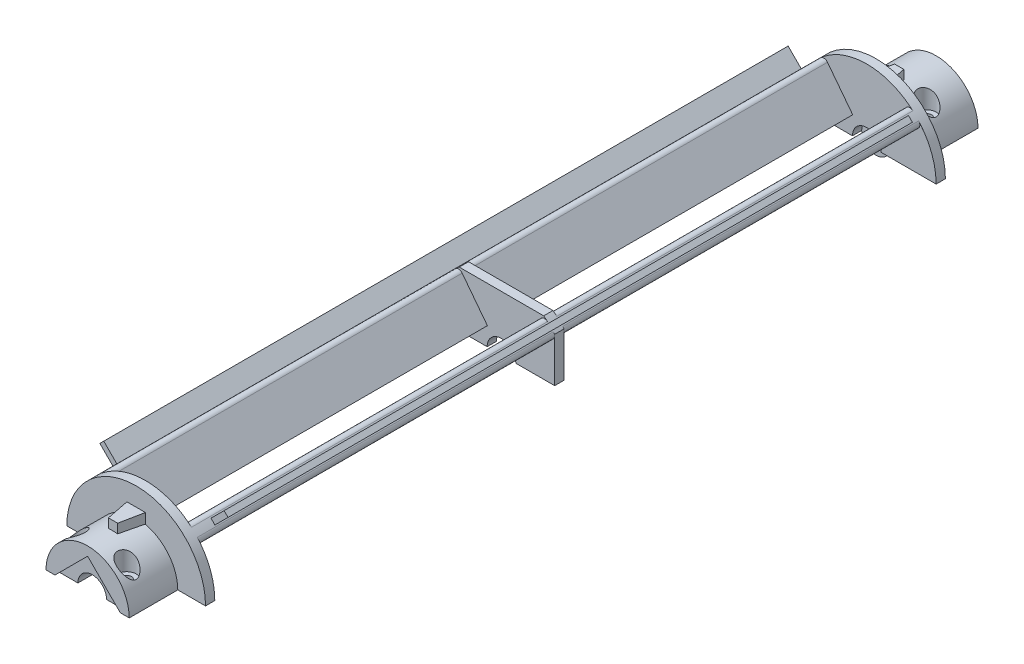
ISO-10303-21;
HEADER;
FILE_DESCRIPTION(('STEP AP214'),'2;1');
FILE_NAME('part.step','',(''),(''),'','','');
FILE_SCHEMA(('AUTOMOTIVE_DESIGN { 1 0 10303 214 1 1 1 1 }'));
ENDSEC;
DATA;
#1=APPLICATION_CONTEXT('core data for automotive mechanical design processes');
#2=APPLICATION_PROTOCOL_DEFINITION('international standard','automotive_design',2000,#1);
#3=PRODUCT_CONTEXT('',#1,'mechanical');
#4=PRODUCT('Part','Part','',(#3));
#5=PRODUCT_RELATED_PRODUCT_CATEGORY('part','',(#4));
#6=PRODUCT_DEFINITION_FORMATION('','',#4);
#7=PRODUCT_DEFINITION_CONTEXT('part definition',#1,'design');
#8=PRODUCT_DEFINITION('design','',#6,#7);
#9=PRODUCT_DEFINITION_SHAPE('','',#8);
#10=(LENGTH_UNIT() NAMED_UNIT(*) SI_UNIT(.MILLI.,.METRE.));
#11=(NAMED_UNIT(*) PLANE_ANGLE_UNIT() SI_UNIT($,.RADIAN.));
#12=(NAMED_UNIT(*) SI_UNIT($,.STERADIAN.) SOLID_ANGLE_UNIT());
#13=UNCERTAINTY_MEASURE_WITH_UNIT(LENGTH_MEASURE(1.E-05),#10,'distance_accuracy_value','');
#14=(GEOMETRIC_REPRESENTATION_CONTEXT(3) GLOBAL_UNCERTAINTY_ASSIGNED_CONTEXT((#13)) GLOBAL_UNIT_ASSIGNED_CONTEXT((#10,
#11,#12)) REPRESENTATION_CONTEXT('',''));
#15=CARTESIAN_POINT('',(0.,0.,0.));
#16=DIRECTION('',(0.,0.,1.));
#17=DIRECTION('',(1.,0.,0.));
#18=AXIS2_PLACEMENT_3D('',#15,#16,#17);
#19=CARTESIAN_POINT('',(0.,0.,-93.));
#20=DIRECTION('',(0.,0.,1.));
#21=DIRECTION('',(1.,0.,0.));
#22=AXIS2_PLACEMENT_3D('',#19,#20,#21);
#23=CYLINDRICAL_SURFACE('',#22,9.05);
#24=CARTESIAN_POINT('',(-5.5,7.18696737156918,-87.5));
#25=CARTESIAN_POINT('',(-5.63434935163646,7.08414515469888,-87.499999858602));
#26=CARTESIAN_POINT('',(-5.76586741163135,6.97747421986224,-87.4864678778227));
#27=CARTESIAN_POINT('',(-6.02020391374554,6.7592838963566,-87.4355331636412));
#28=CARTESIAN_POINT('',(-6.1429995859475,6.6477529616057,-87.3980703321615));
#29=CARTESIAN_POINT('',(-6.3883488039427,6.41270253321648,-87.2972105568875));
#30=CARTESIAN_POINT('',(-6.50991310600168,6.28899772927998,-87.2318065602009));
#31=CARTESIAN_POINT('',(-6.68117452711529,6.1050375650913,-87.115419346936));
#32=CARTESIAN_POINT('',(-6.73641594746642,6.04398151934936,-87.0735749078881));
#33=CARTESIAN_POINT('',(-6.84297944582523,5.92305741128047,-86.9836655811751));
#34=CARTESIAN_POINT('',(-6.89430304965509,5.86318889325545,-86.9356031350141));
#35=CARTESIAN_POINT('',(-7.0092827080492,5.72564030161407,-86.8157189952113));
#36=CARTESIAN_POINT('',(-7.0712680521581,5.64875489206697,-86.7413480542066));
#37=CARTESIAN_POINT('',(-7.18623962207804,5.501737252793,-86.5799971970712));
#38=CARTESIAN_POINT('',(-7.23923988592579,5.43159456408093,-86.4930373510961));
#39=CARTESIAN_POINT('',(-7.31942493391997,5.32274600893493,-86.3336910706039));
#40=CARTESIAN_POINT('',(-7.34955875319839,5.28096705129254,-86.2649155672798));
#41=CARTESIAN_POINT('',(-7.4029110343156,5.20591214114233,-86.1203535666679));
#42=CARTESIAN_POINT('',(-7.42614149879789,5.17262144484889,-86.0445795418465));
#43=CARTESIAN_POINT('',(-7.45985699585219,5.1238388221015,-85.9037466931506));
#44=CARTESIAN_POINT('',(-7.47200935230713,5.10605790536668,-85.8398937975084));
#45=CARTESIAN_POINT('',(-7.49008303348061,5.07950989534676,-85.7094912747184));
#46=CARTESIAN_POINT('',(-7.49601164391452,5.07073226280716,-85.6429448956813));
#47=CARTESIAN_POINT('',(-7.50111097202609,5.06318668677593,-85.5087483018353));
#48=CARTESIAN_POINT('',(-7.50025556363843,5.06445744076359,-85.4410948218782));
#49=CARTESIAN_POINT('',(-7.4918129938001,5.07693695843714,-85.307134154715));
#50=CARTESIAN_POINT('',(-7.48422079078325,5.0881531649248,-85.2408280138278));
#51=CARTESIAN_POINT('',(-7.46100990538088,5.12214009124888,-85.0993977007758));
#52=CARTESIAN_POINT('',(-7.44416877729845,5.14666081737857,-85.0249036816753));
#53=CARTESIAN_POINT('',(-7.40349335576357,5.20500229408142,-84.8817088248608));
#54=CARTESIAN_POINT('',(-7.37964536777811,5.23884124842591,-84.8130196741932));
#55=CARTESIAN_POINT('',(-7.31251702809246,5.33238817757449,-84.6477287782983));
#56=CARTESIAN_POINT('',(-7.26556956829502,5.39641672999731,-84.5550981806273));
#57=CARTESIAN_POINT('',(-7.16188908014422,5.53328762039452,-84.3827361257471));
#58=CARTESIAN_POINT('',(-7.10513128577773,5.60615212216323,-84.3030383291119));
#59=CARTESIAN_POINT('',(-6.99788654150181,5.73912833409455,-84.1727202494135));
#60=CARTESIAN_POINT('',(-6.94904994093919,5.79822401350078,-84.1196637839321));
#61=CARTESIAN_POINT('',(-6.8471286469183,5.91823690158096,-84.020024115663));
#62=CARTESIAN_POINT('',(-6.79404188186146,5.97915498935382,-83.9734441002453));
#63=CARTESIAN_POINT('',(-6.68394494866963,6.10198200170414,-83.8865588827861));
#64=CARTESIAN_POINT('',(-6.62693266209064,6.16389144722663,-83.8462571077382));
#65=CARTESIAN_POINT('',(-6.50926462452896,6.28802892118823,-83.771929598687));
#66=CARTESIAN_POINT('',(-6.44860750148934,6.35025706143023,-83.7379062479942));
#67=CARTESIAN_POINT('',(-6.25855600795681,6.53952086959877,-83.643955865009));
#68=CARTESIAN_POINT('',(-6.12363453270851,6.66625352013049,-83.5941638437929));
#69=CARTESIAN_POINT('',(-5.84197106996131,6.9144048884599,-83.5241347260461));
#70=CARTESIAN_POINT('',(-5.69524782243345,7.03583157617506,-83.5038517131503));
#71=CARTESIAN_POINT('',(-5.42705137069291,7.24374083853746,-83.4978799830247));
#72=CARTESIAN_POINT('',(-5.30713414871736,7.33202955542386,-83.5055559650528));
#73=CARTESIAN_POINT('',(-5.06557143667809,7.50093977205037,-83.5439375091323));
#74=CARTESIAN_POINT('',(-4.94392818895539,7.58157032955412,-83.5746154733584));
#75=CARTESIAN_POINT('',(-4.72218522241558,7.72126349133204,-83.6542915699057));
#76=CARTESIAN_POINT('',(-4.62168194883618,7.78172914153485,-83.699690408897));
#77=CARTESIAN_POINT('',(-4.42623196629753,7.8945348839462,-83.8089832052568));
#78=CARTESIAN_POINT('',(-4.33128375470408,7.94687717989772,-83.8728721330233));
#79=CARTESIAN_POINT('',(-4.15061595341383,8.04272500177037,-84.0192071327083));
#80=CARTESIAN_POINT('',(-4.06495241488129,8.08617812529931,-84.101757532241));
#81=CARTESIAN_POINT('',(-3.90798327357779,8.16320021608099,-84.2834993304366));
#82=CARTESIAN_POINT('',(-3.83667133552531,8.19677354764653,-84.3826833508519));
#83=CARTESIAN_POINT('',(-3.71910000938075,8.25072982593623,-84.583242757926));
#84=CARTESIAN_POINT('',(-3.67097941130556,8.27213794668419,-84.6832551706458));
#85=CARTESIAN_POINT('',(-3.59170397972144,8.3068677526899,-84.8910995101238));
#86=CARTESIAN_POINT('',(-3.56054240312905,8.32019265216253,-84.9989283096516));
#87=CARTESIAN_POINT('',(-3.51800578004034,8.33826339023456,-85.2122366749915));
#88=CARTESIAN_POINT('',(-3.5055440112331,8.34348109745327,-85.3174612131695));
#89=CARTESIAN_POINT('',(-3.49741678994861,8.34689157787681,-85.5286633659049));
#90=CARTESIAN_POINT('',(-3.50174848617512,8.34508554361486,-85.6346408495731));
#91=CARTESIAN_POINT('',(-3.52679397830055,8.33453049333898,-85.84235856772));
#92=CARTESIAN_POINT('',(-3.54721514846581,8.32590548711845,-85.9441406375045));
#93=CARTESIAN_POINT('',(-3.60323375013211,8.30181475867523,-86.1425775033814));
#94=CARTESIAN_POINT('',(-3.63883072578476,8.28634924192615,-86.2392324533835));
#95=CARTESIAN_POINT('',(-3.72409301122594,8.2483825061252,-86.42560295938));
#96=CARTESIAN_POINT('',(-3.77387057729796,8.2258249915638,-86.5152555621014));
#97=CARTESIAN_POINT('',(-3.88534162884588,8.17376245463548,-86.6845482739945));
#98=CARTESIAN_POINT('',(-3.9470358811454,8.14425698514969,-86.7641877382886));
#99=CARTESIAN_POINT('',(-4.08246529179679,8.07724471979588,-86.9146461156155));
#100=CARTESIAN_POINT('',(-4.15656771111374,8.0394774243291,-86.9850172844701));
#101=CARTESIAN_POINT('',(-4.31219274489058,7.95708771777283,-87.1122115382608));
#102=CARTESIAN_POINT('',(-4.39371813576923,7.91246273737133,-87.1690295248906));
#103=CARTESIAN_POINT('',(-4.56849088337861,7.81295849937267,-87.2729866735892));
#104=CARTESIAN_POINT('',(-4.66214732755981,7.75753232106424,-87.3189088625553));
#105=CARTESIAN_POINT('',(-4.85183205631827,7.64033104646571,-87.3948147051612));
#106=CARTESIAN_POINT('',(-4.94786035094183,7.57855592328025,-87.4247982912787));
#107=CARTESIAN_POINT('',(-5.12056203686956,7.46263406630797,-87.4652595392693));
#108=CARTESIAN_POINT('',(-5.19726172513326,7.40943584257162,-87.4784404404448));
#109=CARTESIAN_POINT('',(-5.34959972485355,7.30021111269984,-87.4958098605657));
#110=CARTESIAN_POINT('',(-5.42523823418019,7.2441851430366,-87.5000000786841));
#111=CARTESIAN_POINT('',(-5.5,7.18696737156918,-87.5));
#112=B_SPLINE_CURVE_WITH_KNOTS('',3,(#24,#25,#26,#27,#28,#29,#30,#31,#32,#33,#34,#35,#36,#37,
#38,#39,#40,#41,#42,#43,#44,#45,#46,#47,#48,#49,#50,#51,#52,#53,#54,#55,#56,#57,#58,#59,#60,#61,
#62,#63,#64,#65,#66,#67,#68,#69,#70,#71,#72,#73,#74,#75,#76,#77,#78,#79,#80,#81,#82,#83,#84,#85,
#86,#87,#88,#89,#90,#91,#92,#93,#94,#95,#96,#97,#98,#99,#100,#101,#102,#103,#104,#105,#106,#107,
#108,#109,#110,#111),.UNSPECIFIED.,.T.,.F.,(4,2,2,2,2,2,2,2,2,2,2,2,2,2,2,2,2,2,2,2,2,2,2,2,2,2,
2,2,2,2,2,2,2,2,2,2,2,2,2,2,2,2,2,4),(0.,0.507228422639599,1.01573569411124,1.56938561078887,
1.84623046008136,2.12296693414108,2.49293843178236,2.86232645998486,3.1193745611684,
3.37597309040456,3.57732039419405,3.77843173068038,3.98031794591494,4.18235537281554,
4.42166873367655,4.66145296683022,5.02543946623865,5.39035863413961,5.66970897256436,
5.94919630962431,6.22883567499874,6.50858097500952,7.08096932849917,7.65246608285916,
8.09809429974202,8.54318870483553,8.9189318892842,9.29457296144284,9.67236841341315,
10.0499967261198,10.3873328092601,10.7245346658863,11.0412579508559,11.3579274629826,
11.6689669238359,11.9799970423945,12.2935612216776,12.6071455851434,12.9325947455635,
13.2581661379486,13.611137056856,13.9641094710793,14.2464216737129,14.5286805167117),.UNSPECIFIED.);
#113=CARTESIAN_POINT('',(-5.5,7.18696737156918,-87.5));
#114=VERTEX_POINT('',#113);
#115=EDGE_CURVE('E643',#114,#114,#112,.T.);
#116=ORIENTED_EDGE('',*,*,#115,.F.);
#117=EDGE_LOOP('',(#116));
#118=FACE_BOUND('',#117,.T.);
#119=CARTESIAN_POINT('',(5.5,7.18696737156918,-87.5));
#120=CARTESIAN_POINT('',(5.63434935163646,7.08414515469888,-87.499999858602));
#121=CARTESIAN_POINT('',(5.76586741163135,6.97747421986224,-87.4864678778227));
#122=CARTESIAN_POINT('',(6.02020391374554,6.7592838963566,-87.4355331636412));
#123=CARTESIAN_POINT('',(6.1429995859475,6.6477529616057,-87.3980703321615));
#124=CARTESIAN_POINT('',(6.3883488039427,6.41270253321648,-87.2972105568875));
#125=CARTESIAN_POINT('',(6.50991310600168,6.28899772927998,-87.2318065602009));
#126=CARTESIAN_POINT('',(6.68117452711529,6.1050375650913,-87.115419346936));
#127=CARTESIAN_POINT('',(6.73641594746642,6.04398151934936,-87.0735749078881));
#128=CARTESIAN_POINT('',(6.84297944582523,5.92305741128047,-86.9836655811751));
#129=CARTESIAN_POINT('',(6.89430304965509,5.86318889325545,-86.9356031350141));
#130=CARTESIAN_POINT('',(7.0092827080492,5.72564030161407,-86.8157189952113));
#131=CARTESIAN_POINT('',(7.0712680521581,5.64875489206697,-86.7413480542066));
#132=CARTESIAN_POINT('',(7.18623962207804,5.501737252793,-86.5799971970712));
#133=CARTESIAN_POINT('',(7.23923988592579,5.43159456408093,-86.4930373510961));
#134=CARTESIAN_POINT('',(7.31942493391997,5.32274600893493,-86.3336910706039));
#135=CARTESIAN_POINT('',(7.34955875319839,5.28096705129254,-86.2649155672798));
#136=CARTESIAN_POINT('',(7.4029110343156,5.20591214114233,-86.1203535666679));
#137=CARTESIAN_POINT('',(7.42614149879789,5.17262144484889,-86.0445795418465));
#138=CARTESIAN_POINT('',(7.45985699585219,5.1238388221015,-85.9037466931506));
#139=CARTESIAN_POINT('',(7.47200935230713,5.10605790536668,-85.8398937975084));
#140=CARTESIAN_POINT('',(7.49008303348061,5.07950989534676,-85.7094912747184));
#141=CARTESIAN_POINT('',(7.49601164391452,5.07073226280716,-85.6429448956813));
#142=CARTESIAN_POINT('',(7.50111097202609,5.06318668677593,-85.5087483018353));
#143=CARTESIAN_POINT('',(7.50025556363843,5.06445744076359,-85.4410948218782));
#144=CARTESIAN_POINT('',(7.4918129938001,5.07693695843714,-85.307134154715));
#145=CARTESIAN_POINT('',(7.48422079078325,5.0881531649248,-85.2408280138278));
#146=CARTESIAN_POINT('',(7.46100990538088,5.12214009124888,-85.0993977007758));
#147=CARTESIAN_POINT('',(7.44416877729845,5.14666081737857,-85.0249036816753));
#148=CARTESIAN_POINT('',(7.40349335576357,5.20500229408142,-84.8817088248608));
#149=CARTESIAN_POINT('',(7.37964536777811,5.23884124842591,-84.8130196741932));
#150=CARTESIAN_POINT('',(7.31251702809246,5.33238817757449,-84.6477287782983));
#151=CARTESIAN_POINT('',(7.26556956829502,5.39641672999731,-84.5550981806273));
#152=CARTESIAN_POINT('',(7.16188908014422,5.53328762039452,-84.3827361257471));
#153=CARTESIAN_POINT('',(7.10513128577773,5.60615212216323,-84.3030383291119));
#154=CARTESIAN_POINT('',(6.99788654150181,5.73912833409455,-84.1727202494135));
#155=CARTESIAN_POINT('',(6.94904994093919,5.79822401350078,-84.1196637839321));
#156=CARTESIAN_POINT('',(6.8471286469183,5.91823690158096,-84.020024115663));
#157=CARTESIAN_POINT('',(6.79404188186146,5.97915498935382,-83.9734441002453));
#158=CARTESIAN_POINT('',(6.68394494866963,6.10198200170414,-83.8865588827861));
#159=CARTESIAN_POINT('',(6.62693266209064,6.16389144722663,-83.8462571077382));
#160=CARTESIAN_POINT('',(6.50926462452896,6.28802892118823,-83.771929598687));
#161=CARTESIAN_POINT('',(6.44860750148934,6.35025706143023,-83.7379062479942));
#162=CARTESIAN_POINT('',(6.25855600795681,6.53952086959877,-83.643955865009));
#163=CARTESIAN_POINT('',(6.12363453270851,6.66625352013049,-83.5941638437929));
#164=CARTESIAN_POINT('',(5.84197106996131,6.9144048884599,-83.5241347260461));
#165=CARTESIAN_POINT('',(5.69524782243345,7.03583157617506,-83.5038517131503));
#166=CARTESIAN_POINT('',(5.42705137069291,7.24374083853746,-83.4978799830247));
#167=CARTESIAN_POINT('',(5.30713414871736,7.33202955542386,-83.5055559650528));
#168=CARTESIAN_POINT('',(5.06557143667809,7.50093977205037,-83.5439375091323));
#169=CARTESIAN_POINT('',(4.94392818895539,7.58157032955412,-83.5746154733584));
#170=CARTESIAN_POINT('',(4.72218522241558,7.72126349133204,-83.6542915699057));
#171=CARTESIAN_POINT('',(4.62168194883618,7.78172914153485,-83.699690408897));
#172=CARTESIAN_POINT('',(4.42623196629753,7.8945348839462,-83.8089832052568));
#173=CARTESIAN_POINT('',(4.33128375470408,7.94687717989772,-83.8728721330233));
#174=CARTESIAN_POINT('',(4.15061595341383,8.04272500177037,-84.0192071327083));
#175=CARTESIAN_POINT('',(4.06495241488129,8.08617812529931,-84.101757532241));
#176=CARTESIAN_POINT('',(3.90798327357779,8.16320021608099,-84.2834993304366));
#177=CARTESIAN_POINT('',(3.83667133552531,8.19677354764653,-84.3826833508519));
#178=CARTESIAN_POINT('',(3.71910000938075,8.25072982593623,-84.583242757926));
#179=CARTESIAN_POINT('',(3.67097941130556,8.27213794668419,-84.6832551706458));
#180=CARTESIAN_POINT('',(3.59170397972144,8.3068677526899,-84.8910995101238));
#181=CARTESIAN_POINT('',(3.56054240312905,8.32019265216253,-84.9989283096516));
#182=CARTESIAN_POINT('',(3.51800578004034,8.33826339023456,-85.2122366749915));
#183=CARTESIAN_POINT('',(3.5055440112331,8.34348109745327,-85.3174612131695));
#184=CARTESIAN_POINT('',(3.49741678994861,8.34689157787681,-85.5286633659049));
#185=CARTESIAN_POINT('',(3.50174848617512,8.34508554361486,-85.6346408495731));
#186=CARTESIAN_POINT('',(3.52679397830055,8.33453049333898,-85.84235856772));
#187=CARTESIAN_POINT('',(3.54721514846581,8.32590548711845,-85.9441406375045));
#188=CARTESIAN_POINT('',(3.60323375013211,8.30181475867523,-86.1425775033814));
#189=CARTESIAN_POINT('',(3.63883072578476,8.28634924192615,-86.2392324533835));
#190=CARTESIAN_POINT('',(3.72409301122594,8.2483825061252,-86.42560295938));
#191=CARTESIAN_POINT('',(3.77387057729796,8.2258249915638,-86.5152555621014));
#192=CARTESIAN_POINT('',(3.88534162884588,8.17376245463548,-86.6845482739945));
#193=CARTESIAN_POINT('',(3.9470358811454,8.14425698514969,-86.7641877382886));
#194=CARTESIAN_POINT('',(4.08246529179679,8.07724471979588,-86.9146461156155));
#195=CARTESIAN_POINT('',(4.15656771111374,8.0394774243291,-86.9850172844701));
#196=CARTESIAN_POINT('',(4.31219274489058,7.95708771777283,-87.1122115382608));
#197=CARTESIAN_POINT('',(4.39371813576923,7.91246273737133,-87.1690295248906));
#198=CARTESIAN_POINT('',(4.56849088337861,7.81295849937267,-87.2729866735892));
#199=CARTESIAN_POINT('',(4.66214732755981,7.75753232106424,-87.3189088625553));
#200=CARTESIAN_POINT('',(4.85183205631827,7.64033104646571,-87.3948147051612));
#201=CARTESIAN_POINT('',(4.94786035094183,7.57855592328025,-87.4247982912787));
#202=CARTESIAN_POINT('',(5.12056203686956,7.46263406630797,-87.4652595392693));
#203=CARTESIAN_POINT('',(5.19726172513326,7.40943584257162,-87.4784404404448));
#204=CARTESIAN_POINT('',(5.34959972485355,7.30021111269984,-87.4958098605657));
#205=CARTESIAN_POINT('',(5.42523823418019,7.2441851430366,-87.5000000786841));
#206=CARTESIAN_POINT('',(5.5,7.18696737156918,-87.5));
#207=B_SPLINE_CURVE_WITH_KNOTS('',3,(#119,#120,#121,#122,#123,#124,#125,#126,#127,#128,#129,
#130,#131,#132,#133,#134,#135,#136,#137,#138,#139,#140,#141,#142,#143,#144,#145,#146,#147,#148,
#149,#150,#151,#152,#153,#154,#155,#156,#157,#158,#159,#160,#161,#162,#163,#164,#165,#166,#167,
#168,#169,#170,#171,#172,#173,#174,#175,#176,#177,#178,#179,#180,#181,#182,#183,#184,#185,#186,
#187,#188,#189,#190,#191,#192,#193,#194,#195,#196,#197,#198,#199,#200,#201,#202,#203,#204,#205,
#206),.UNSPECIFIED.,.T.,.F.,(4,2,2,2,2,2,2,2,2,2,2,2,2,2,2,2,2,2,2,2,2,2,2,2,2,2,2,2,2,2,2,2,2,
2,2,2,2,2,2,2,2,2,2,4),(0.,0.507228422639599,1.01573569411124,1.56938561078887,1.84623046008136,
2.12296693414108,2.49293843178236,2.86232645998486,3.1193745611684,3.37597309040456,
3.57732039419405,3.77843173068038,3.98031794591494,4.18235537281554,4.42166873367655,
4.66145296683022,5.02543946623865,5.39035863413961,5.66970897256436,5.94919630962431,
6.22883567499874,6.50858097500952,7.08096932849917,7.65246608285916,8.09809429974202,
8.54318870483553,8.9189318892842,9.29457296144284,9.67236841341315,10.0499967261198,
10.3873328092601,10.7245346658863,11.0412579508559,11.3579274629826,11.6689669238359,
11.9799970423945,12.2935612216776,12.6071455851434,12.9325947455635,13.2581661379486,
13.611137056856,13.9641094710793,14.2464216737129,14.5286805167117),.UNSPECIFIED.);
#208=CARTESIAN_POINT('',(5.5,7.18696737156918,-87.5));
#209=VERTEX_POINT('',#208);
#210=EDGE_CURVE('E633',#209,#209,#207,.T.);
#211=ORIENTED_EDGE('',*,*,#210,.T.);
#212=EDGE_LOOP('',(#211));
#213=FACE_BOUND('',#212,.T.);
#214=CARTESIAN_POINT('',(0.,0.,-90.));
#215=DIRECTION('',(-0.98058067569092,0.,0.196116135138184));
#216=DIRECTION('',(0.196116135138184,0.,0.98058067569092));
#217=AXIS2_PLACEMENT_3D('',#214,#215,#216);
#218=ELLIPSE('',#217,46.1461265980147,9.05);
#219=CARTESIAN_POINT('',(1.,8.99458170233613,-85.));
#220=VERTEX_POINT('',#219);
#221=CARTESIAN_POINT('',(2.,8.82623928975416,-80.));
#222=VERTEX_POINT('',#221);
#223=EDGE_CURVE('E540',#220,#222,#218,.F.);
#224=ORIENTED_EDGE('',*,*,#223,.T.);
#225=CARTESIAN_POINT('',(0.,0.,-80.));
#226=DIRECTION('',(0.,0.,-1.));
#227=DIRECTION('',(1.,0.,0.));
#228=AXIS2_PLACEMENT_3D('',#225,#226,#227);
#229=CIRCLE('',#228,9.05);
#230=CARTESIAN_POINT('',(9.05,0.,-80.));
#231=VERTEX_POINT('',#230);
#232=EDGE_CURVE('E665',#222,#231,#229,.T.);
#233=ORIENTED_EDGE('',*,*,#232,.T.);
#234=DIRECTION('',(0.,0.,1.));
#235=VECTOR('',#234,1.);
#236=CARTESIAN_POINT('',(9.05,0.,-93.));
#237=LINE('',#236,#235);
#238=CARTESIAN_POINT('',(9.05,0.,-93.));
#239=VERTEX_POINT('',#238);
#240=EDGE_CURVE('E800',#239,#231,#237,.T.);
#241=ORIENTED_EDGE('',*,*,#240,.F.);
#242=CARTESIAN_POINT('',(0.,0.,-93.));
#243=DIRECTION('',(0.,0.,-1.));
#244=DIRECTION('',(1.,0.,0.));
#245=AXIS2_PLACEMENT_3D('',#242,#243,#244);
#246=CIRCLE('',#245,9.05);
#247=CARTESIAN_POINT('',(-9.05,0.,-93.));
#248=VERTEX_POINT('',#247);
#249=EDGE_CURVE('E787',#248,#239,#246,.T.);
#250=ORIENTED_EDGE('',*,*,#249,.F.);
#251=DIRECTION('',(0.,0.,1.));
#252=VECTOR('',#251,1.);
#253=CARTESIAN_POINT('',(-9.05,0.,-93.));
#254=LINE('',#253,#252);
#255=CARTESIAN_POINT('',(-9.05,0.,-80.));
#256=VERTEX_POINT('',#255);
#257=EDGE_CURVE('E793',#248,#256,#254,.T.);
#258=ORIENTED_EDGE('',*,*,#257,.T.);
#259=CARTESIAN_POINT('',(-2.,8.82623928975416,-80.));
#260=VERTEX_POINT('',#259);
#261=EDGE_CURVE('E672',#256,#260,#229,.T.);
#262=ORIENTED_EDGE('',*,*,#261,.T.);
#263=CARTESIAN_POINT('',(0.,0.,-90.));
#264=DIRECTION('',(0.98058067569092,0.,0.196116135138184));
#265=DIRECTION('',(-0.196116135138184,0.,0.98058067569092));
#266=AXIS2_PLACEMENT_3D('',#263,#264,#265);
#267=ELLIPSE('',#266,46.1461265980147,9.05);
#268=CARTESIAN_POINT('',(-0.999999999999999,8.99458170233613,-85.));
#269=VERTEX_POINT('',#268);
#270=EDGE_CURVE('E537',#260,#269,#267,.F.);
#271=ORIENTED_EDGE('',*,*,#270,.T.);
#272=CARTESIAN_POINT('',(0.,0.,-85.));
#273=DIRECTION('',(0.,0.,1.));
#274=DIRECTION('',(1.,0.,0.));
#275=AXIS2_PLACEMENT_3D('',#272,#273,#274);
#276=CIRCLE('',#275,9.05);
#277=EDGE_CURVE('E544',#269,#220,#276,.F.);
#278=ORIENTED_EDGE('',*,*,#277,.T.);
#279=EDGE_LOOP('',(#224,#233,#241,#250,#258,#262,#271,#278));
#280=FACE_BOUND('',#279,.T.);
#281=ADVANCED_FACE('F31',(#118,#213,#280),#23,.T.);
#282=CARTESIAN_POINT('',(-3.1,0.,-80.));
#283=DIRECTION('',(0.,0.,1.));
#284=DIRECTION('',(1.,0.,0.));
#285=AXIS2_PLACEMENT_3D('',#282,#283,#284);
#286=PLANE('',#285);
#287=DIRECTION('',(0.,1.,0.));
#288=VECTOR('',#287,1.);
#289=CARTESIAN_POINT('',(2.,-3.101,-80.));
#290=LINE('',#289,#288);
#291=CARTESIAN_POINT('',(2.,11.,-80.));
#292=VERTEX_POINT('',#291);
#293=EDGE_CURVE('E541',#222,#292,#290,.T.);
#294=ORIENTED_EDGE('',*,*,#293,.T.);
#295=DIRECTION('',(-1.,0.,0.));
#296=VECTOR('',#295,1.);
#297=CARTESIAN_POINT('',(-2.,11.,-80.));
#298=LINE('',#297,#296);
#299=CARTESIAN_POINT('',(-2.,11.,-80.));
#300=VERTEX_POINT('',#299);
#301=EDGE_CURVE('E547',#292,#300,#298,.T.);
#302=ORIENTED_EDGE('',*,*,#301,.T.);
#303=DIRECTION('',(0.,1.,0.));
#304=VECTOR('',#303,1.);
#305=CARTESIAN_POINT('',(-2.,-3.101,-80.));
#306=LINE('',#305,#304);
#307=EDGE_CURVE('E560',#260,#300,#306,.T.);
#308=ORIENTED_EDGE('',*,*,#307,.F.);
#309=ORIENTED_EDGE('',*,*,#261,.F.);
#310=DIRECTION('',(1.,0.,0.));
#311=VECTOR('',#310,1.);
#312=CARTESIAN_POINT('',(-3.1,0.,-80.));
#313=LINE('',#312,#311);
#314=CARTESIAN_POINT('',(-15.,-1.04744440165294E-13,-80.));
#315=VERTEX_POINT('',#314);
#316=EDGE_CURVE('E819',#315,#256,#313,.T.);
#317=ORIENTED_EDGE('',*,*,#316,.F.);
#318=CARTESIAN_POINT('',(0.,0.,-80.));
#319=DIRECTION('',(0.,0.,-1.));
#320=DIRECTION('',(-1.,0.,0.));
#321=AXIS2_PLACEMENT_3D('',#318,#319,#320);
#322=CIRCLE('',#321,15.);
#323=CARTESIAN_POINT('',(15.,0.,-80.));
#324=VERTEX_POINT('',#323);
#325=EDGE_CURVE('E831',#315,#324,#322,.T.);
#326=ORIENTED_EDGE('',*,*,#325,.T.);
#327=DIRECTION('',(-1.,0.,0.));
#328=VECTOR('',#327,1.);
#329=CARTESIAN_POINT('',(3.1,0.,-80.));
#330=LINE('',#329,#328);
#331=EDGE_CURVE('E810',#324,#231,#330,.T.);
#332=ORIENTED_EDGE('',*,*,#331,.T.);
#333=ORIENTED_EDGE('',*,*,#232,.F.);
#334=EDGE_LOOP('',(#294,#302,#308,#309,#317,#326,#332,#333));
#335=FACE_BOUND('',#334,.T.);
#336=ADVANCED_FACE('F710',(#335),#286,.F.);
#337=CARTESIAN_POINT('',(0.,0.,80.));
#338=DIRECTION('',(0.,0.,-1.));
#339=DIRECTION('',(-1.,0.,0.));
#340=AXIS2_PLACEMENT_3D('',#337,#338,#339);
#341=CYLINDRICAL_SURFACE('',#340,5.);
#342=CARTESIAN_POINT('',(0.,0.,78.));
#343=DIRECTION('',(0.,0.,1.));
#344=DIRECTION('',(1.,0.,0.));
#345=AXIS2_PLACEMENT_3D('',#342,#343,#344);
#346=CIRCLE('',#345,5.);
#347=CARTESIAN_POINT('',(3.04380714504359,3.96676670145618,78.));
#348=VERTEX_POINT('',#347);
#349=CARTESIAN_POINT('',(3.96676670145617,3.04380714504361,78.));
#350=VERTEX_POINT('',#349);
#351=EDGE_CURVE('E618',#348,#350,#346,.F.);
#352=ORIENTED_EDGE('',*,*,#351,.F.);
#353=DIRECTION('',(0.,0.,-1.));
#354=VECTOR('',#353,1.);
#355=CARTESIAN_POINT('',(3.04380714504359,3.96676670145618,80.));
#356=LINE('',#355,#354);
#357=CARTESIAN_POINT('',(3.04380714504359,3.96676670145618,1.));
#358=VERTEX_POINT('',#357);
#359=EDGE_CURVE('E1151',#348,#358,#356,.T.);
#360=ORIENTED_EDGE('',*,*,#359,.T.);
#361=CARTESIAN_POINT('',(0.,0.,1.));
#362=DIRECTION('',(0.,0.,1.));
#363=DIRECTION('',(1.,0.,0.));
#364=AXIS2_PLACEMENT_3D('',#361,#362,#363);
#365=CIRCLE('',#364,5.);
#366=CARTESIAN_POINT('',(3.96676670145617,3.04380714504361,1.));
#367=VERTEX_POINT('',#366);
#368=EDGE_CURVE('E928',#367,#358,#365,.T.);
#369=ORIENTED_EDGE('',*,*,#368,.F.);
#370=DIRECTION('',(0.,0.,-1.));
#371=VECTOR('',#370,1.);
#372=CARTESIAN_POINT('',(3.96676670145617,3.04380714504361,80.));
#373=LINE('',#372,#371);
#374=EDGE_CURVE('E914',#350,#367,#373,.T.);
#375=ORIENTED_EDGE('',*,*,#374,.F.);
#376=EDGE_LOOP('',(#352,#360,#369,#375));
#377=FACE_BOUND('',#376,.T.);
#378=ADVANCED_FACE('F716',(#377),#341,.F.);
#379=CARTESIAN_POINT('',(3.96676670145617,3.04380714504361,80.));
#380=DIRECTION('',(-0.608761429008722,0.793353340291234,0.));
#381=DIRECTION('',(-0.793353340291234,-0.608761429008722,0.));
#382=AXIS2_PLACEMENT_3D('',#379,#380,#381);
#383=PLANE('',#382);
#384=DIRECTION('',(0.793353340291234,0.608761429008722,0.));
#385=VECTOR('',#384,1.);
#386=CARTESIAN_POINT('',(3.96676670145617,3.04380714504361,78.));
#387=LINE('',#386,#385);
#388=CARTESIAN_POINT('',(11.0785764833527,8.5008907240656,78.));
#389=VERTEX_POINT('',#388);
#390=EDGE_CURVE('E620',#350,#389,#387,.T.);
#391=ORIENTED_EDGE('',*,*,#390,.F.);
#392=ORIENTED_EDGE('',*,*,#374,.T.);
#393=DIRECTION('',(-0.793353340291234,-0.608761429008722,0.));
#394=VECTOR('',#393,1.);
#395=CARTESIAN_POINT('',(0.,0.,1.));
#396=LINE('',#395,#394);
#397=CARTESIAN_POINT('',(11.0785764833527,8.5008907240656,1.));
#398=VERTEX_POINT('',#397);
#399=EDGE_CURVE('E925',#398,#367,#396,.T.);
#400=ORIENTED_EDGE('',*,*,#399,.F.);
#401=DIRECTION('',(0.,0.,-1.));
#402=VECTOR('',#401,1.);
#403=CARTESIAN_POINT('',(11.0785764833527,8.5008907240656,80.));
#404=LINE('',#403,#402);
#405=EDGE_CURVE('E911',#389,#398,#404,.T.);
#406=ORIENTED_EDGE('',*,*,#405,.F.);
#407=EDGE_LOOP('',(#391,#392,#400,#406));
#408=FACE_BOUND('',#407,.T.);
#409=ADVANCED_FACE('F1422',(#408),#383,.F.);
#410=CARTESIAN_POINT('',(10.469815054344,9.29424406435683,80.));
#411=DIRECTION('',(0.,0.,-1.));
#412=DIRECTION('',(-1.,0.,0.));
#413=AXIS2_PLACEMENT_3D('',#410,#411,#412);
#414=CYLINDRICAL_SURFACE('',#413,1.);
#415=CARTESIAN_POINT('',(10.469815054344,9.29424406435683,78.));
#416=DIRECTION('',(0.,0.,1.));
#417=DIRECTION('',(1.,0.,0.));
#418=AXIS2_PLACEMENT_3D('',#415,#416,#417);
#419=CIRCLE('',#418,1.);
#420=CARTESIAN_POINT('',(11.2176589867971,9.95811864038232,78.));
#421=VERTEX_POINT('',#420);
#422=EDGE_CURVE('E622',#389,#421,#419,.T.);
#423=ORIENTED_EDGE('',*,*,#422,.F.);
#424=ORIENTED_EDGE('',*,*,#405,.T.);
#425=CARTESIAN_POINT('',(10.469815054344,9.29424406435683,1.));
#426=DIRECTION('',(0.,0.,1.));
#427=DIRECTION('',(1.,0.,0.));
#428=AXIS2_PLACEMENT_3D('',#425,#426,#427);
#429=CIRCLE('',#428,1.);
#430=CARTESIAN_POINT('',(11.2176589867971,9.95811864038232,1.));
#431=VERTEX_POINT('',#430);
#432=EDGE_CURVE('E922',#431,#398,#429,.F.);
#433=ORIENTED_EDGE('',*,*,#432,.F.);
#434=DIRECTION('',(0.,0.,-1.));
#435=VECTOR('',#434,1.);
#436=CARTESIAN_POINT('',(11.2176589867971,9.95811864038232,80.));
#437=LINE('',#436,#435);
#438=EDGE_CURVE('E907',#421,#431,#437,.T.);
#439=ORIENTED_EDGE('',*,*,#438,.F.);
#440=EDGE_LOOP('',(#423,#424,#433,#439));
#441=FACE_BOUND('',#440,.T.);
#442=ADVANCED_FACE('F1417',(#441),#414,.T.);
#443=CARTESIAN_POINT('',(9.29424406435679,10.469815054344,80.));
#444=DIRECTION('',(0.,0.,-1.));
#445=DIRECTION('',(-1.,0.,0.));
#446=AXIS2_PLACEMENT_3D('',#443,#444,#445);
#447=CYLINDRICAL_SURFACE('',#446,1.);
#448=CARTESIAN_POINT('',(9.29424406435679,10.469815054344,78.));
#449=DIRECTION('',(0.,0.,1.));
#450=DIRECTION('',(1.,0.,0.));
#451=AXIS2_PLACEMENT_3D('',#448,#449,#450);
#452=CIRCLE('',#451,1.);
#453=CARTESIAN_POINT('',(9.95811864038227,11.2176589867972,78.));
#454=VERTEX_POINT('',#453);
#455=CARTESIAN_POINT('',(8.50089072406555,11.0785764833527,78.));
#456=VERTEX_POINT('',#455);
#457=EDGE_CURVE('E616',#454,#456,#452,.T.);
#458=ORIENTED_EDGE('',*,*,#457,.F.);
#459=DIRECTION('',(0.,0.,-1.));
#460=VECTOR('',#459,1.);
#461=CARTESIAN_POINT('',(9.95811864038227,11.2176589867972,80.));
#462=LINE('',#461,#460);
#463=CARTESIAN_POINT('',(9.95811864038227,11.2176589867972,1.));
#464=VERTEX_POINT('',#463);
#465=EDGE_CURVE('E893',#454,#464,#462,.T.);
#466=ORIENTED_EDGE('',*,*,#465,.T.);
#467=CARTESIAN_POINT('',(9.29424406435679,10.469815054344,1.));
#468=DIRECTION('',(0.,0.,1.));
#469=DIRECTION('',(1.,0.,0.));
#470=AXIS2_PLACEMENT_3D('',#467,#468,#469);
#471=CIRCLE('',#470,1.);
#472=CARTESIAN_POINT('',(8.50089072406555,11.0785764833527,1.));
#473=VERTEX_POINT('',#472);
#474=EDGE_CURVE('E919',#473,#464,#471,.F.);
#475=ORIENTED_EDGE('',*,*,#474,.F.);
#476=DIRECTION('',(0.,0.,-1.));
#477=VECTOR('',#476,1.);
#478=CARTESIAN_POINT('',(8.50089072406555,11.0785764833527,80.));
#479=LINE('',#478,#477);
#480=EDGE_CURVE('E894',#456,#473,#479,.T.);
#481=ORIENTED_EDGE('',*,*,#480,.F.);
#482=EDGE_LOOP('',(#458,#466,#475,#481));
#483=FACE_BOUND('',#482,.T.);
#484=ADVANCED_FACE('F1458',(#483),#447,.T.);
#485=CARTESIAN_POINT('',(3.04380714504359,3.96676670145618,80.));
#486=DIRECTION('',(0.793353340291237,-0.608761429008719,0.));
#487=DIRECTION('',(0.608761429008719,0.793353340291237,0.));
#488=AXIS2_PLACEMENT_3D('',#485,#486,#487);
#489=PLANE('',#488);
#490=DIRECTION('',(-0.608761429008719,-0.793353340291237,0.));
#491=VECTOR('',#490,1.);
#492=CARTESIAN_POINT('',(3.04380714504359,3.96676670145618,78.));
#493=LINE('',#492,#491);
#494=EDGE_CURVE('E614',#456,#348,#493,.T.);
#495=ORIENTED_EDGE('',*,*,#494,.F.);
#496=ORIENTED_EDGE('',*,*,#480,.T.);
#497=DIRECTION('',(0.608761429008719,0.793353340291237,0.));
#498=VECTOR('',#497,1.);
#499=CARTESIAN_POINT('',(0.,0.,1.));
#500=LINE('',#499,#498);
#501=EDGE_CURVE('E916',#358,#473,#500,.T.);
#502=ORIENTED_EDGE('',*,*,#501,.F.);
#503=ORIENTED_EDGE('',*,*,#359,.F.);
#504=EDGE_LOOP('',(#495,#496,#502,#503));
#505=FACE_BOUND('',#504,.T.);
#506=ADVANCED_FACE('F1461',(#505),#489,.F.);
#507=CARTESIAN_POINT('',(0.,0.,80.));
#508=DIRECTION('',(0.,0.,-1.));
#509=DIRECTION('',(-1.,0.,0.));
#510=AXIS2_PLACEMENT_3D('',#507,#508,#509);
#511=CYLINDRICAL_SURFACE('',#510,5.);
#512=DIRECTION('',(0.,0.,-1.));
#513=VECTOR('',#512,1.);
#514=CARTESIAN_POINT('',(-3.04380714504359,3.96676670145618,80.));
#515=LINE('',#514,#513);
#516=CARTESIAN_POINT('',(-3.04380714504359,3.96676670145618,78.));
#517=VERTEX_POINT('',#516);
#518=CARTESIAN_POINT('',(-3.04380714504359,3.96676670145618,1.));
#519=VERTEX_POINT('',#518);
#520=EDGE_CURVE('E1189',#517,#519,#515,.T.);
#521=ORIENTED_EDGE('',*,*,#520,.F.);
#522=CARTESIAN_POINT('',(0.,0.,78.));
#523=DIRECTION('',(0.,0.,1.));
#524=DIRECTION('',(1.,0.,0.));
#525=AXIS2_PLACEMENT_3D('',#522,#523,#524);
#526=CIRCLE('',#525,5.);
#527=CARTESIAN_POINT('',(-3.96676670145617,3.04380714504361,78.));
#528=VERTEX_POINT('',#527);
#529=EDGE_CURVE('E605',#517,#528,#526,.T.);
#530=ORIENTED_EDGE('',*,*,#529,.T.);
#531=DIRECTION('',(0.,0.,-1.));
#532=VECTOR('',#531,1.);
#533=CARTESIAN_POINT('',(-3.96676670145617,3.04380714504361,80.));
#534=LINE('',#533,#532);
#535=CARTESIAN_POINT('',(-3.96676670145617,3.04380714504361,1.));
#536=VERTEX_POINT('',#535);
#537=EDGE_CURVE('E1227',#528,#536,#534,.T.);
#538=ORIENTED_EDGE('',*,*,#537,.T.);
#539=CARTESIAN_POINT('',(0.,0.,1.));
#540=DIRECTION('',(0.,0.,1.));
#541=DIRECTION('',(1.,0.,0.));
#542=AXIS2_PLACEMENT_3D('',#539,#540,#541);
#543=CIRCLE('',#542,5.);
#544=EDGE_CURVE('E1167',#536,#519,#543,.F.);
#545=ORIENTED_EDGE('',*,*,#544,.T.);
#546=EDGE_LOOP('',(#521,#530,#538,#545));
#547=FACE_BOUND('',#546,.T.);
#548=ADVANCED_FACE('F1382',(#547),#511,.F.);
#549=CARTESIAN_POINT('',(-3.04380714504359,3.96676670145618,80.));
#550=DIRECTION('',(0.793353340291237,0.608761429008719,0.));
#551=DIRECTION('',(-0.608761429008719,0.793353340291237,0.));
#552=AXIS2_PLACEMENT_3D('',#549,#550,#551);
#553=PLANE('',#552);
#554=DIRECTION('',(0.,0.,-1.));
#555=VECTOR('',#554,1.);
#556=CARTESIAN_POINT('',(-8.50089072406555,11.0785764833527,80.));
#557=LINE('',#556,#555);
#558=CARTESIAN_POINT('',(-8.50089072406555,11.0785764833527,78.));
#559=VERTEX_POINT('',#558);
#560=CARTESIAN_POINT('',(-8.50089072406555,11.0785764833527,1.));
#561=VERTEX_POINT('',#560);
#562=EDGE_CURVE('E1192',#559,#561,#557,.T.);
#563=ORIENTED_EDGE('',*,*,#562,.F.);
#564=DIRECTION('',(0.608761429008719,-0.793353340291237,0.));
#565=VECTOR('',#564,1.);
#566=CARTESIAN_POINT('',(-3.04380714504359,3.96676670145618,78.));
#567=LINE('',#566,#565);
#568=EDGE_CURVE('E608',#559,#517,#567,.T.);
#569=ORIENTED_EDGE('',*,*,#568,.T.);
#570=ORIENTED_EDGE('',*,*,#520,.T.);
#571=DIRECTION('',(-0.608761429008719,0.793353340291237,0.));
#572=VECTOR('',#571,1.);
#573=CARTESIAN_POINT('',(0.,0.,1.));
#574=LINE('',#573,#572);
#575=EDGE_CURVE('E1169',#519,#561,#574,.T.);
#576=ORIENTED_EDGE('',*,*,#575,.T.);
#577=EDGE_LOOP('',(#563,#569,#570,#576));
#578=FACE_BOUND('',#577,.T.);
#579=ADVANCED_FACE('F1380',(#578),#553,.T.);
#580=CARTESIAN_POINT('',(-9.29424406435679,10.469815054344,80.));
#581=DIRECTION('',(0.,0.,-1.));
#582=DIRECTION('',(-1.,0.,0.));
#583=AXIS2_PLACEMENT_3D('',#580,#581,#582);
#584=CYLINDRICAL_SURFACE('',#583,1.);
#585=DIRECTION('',(0.,0.,-1.));
#586=VECTOR('',#585,1.);
#587=CARTESIAN_POINT('',(-9.95811864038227,11.2176589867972,80.));
#588=LINE('',#587,#586);
#589=CARTESIAN_POINT('',(-9.95811864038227,11.2176589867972,78.));
#590=VERTEX_POINT('',#589);
#591=CARTESIAN_POINT('',(-9.95811864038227,11.2176589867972,1.));
#592=VERTEX_POINT('',#591);
#593=EDGE_CURVE('E1195',#590,#592,#588,.T.);
#594=ORIENTED_EDGE('',*,*,#593,.F.);
#595=CARTESIAN_POINT('',(-9.29424406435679,10.469815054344,78.));
#596=DIRECTION('',(0.,0.,1.));
#597=DIRECTION('',(1.,0.,0.));
#598=AXIS2_PLACEMENT_3D('',#595,#596,#597);
#599=CIRCLE('',#598,1.);
#600=EDGE_CURVE('E611',#590,#559,#599,.F.);
#601=ORIENTED_EDGE('',*,*,#600,.T.);
#602=ORIENTED_EDGE('',*,*,#562,.T.);
#603=CARTESIAN_POINT('',(-9.29424406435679,10.469815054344,1.));
#604=DIRECTION('',(0.,0.,1.));
#605=DIRECTION('',(1.,0.,0.));
#606=AXIS2_PLACEMENT_3D('',#603,#604,#605);
#607=CIRCLE('',#606,1.);
#608=EDGE_CURVE('E1177',#561,#592,#607,.T.);
#609=ORIENTED_EDGE('',*,*,#608,.T.);
#610=EDGE_LOOP('',(#594,#601,#602,#609));
#611=FACE_BOUND('',#610,.T.);
#612=ADVANCED_FACE('F1303',(#611),#584,.T.);
#613=CARTESIAN_POINT('',(-10.469815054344,9.29424406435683,80.));
#614=DIRECTION('',(0.,0.,-1.));
#615=DIRECTION('',(-1.,0.,0.));
#616=AXIS2_PLACEMENT_3D('',#613,#614,#615);
#617=CYLINDRICAL_SURFACE('',#616,1.);
#618=DIRECTION('',(0.,0.,-1.));
#619=VECTOR('',#618,1.);
#620=CARTESIAN_POINT('',(-11.0785764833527,8.5008907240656,80.));
#621=LINE('',#620,#619);
#622=CARTESIAN_POINT('',(-11.0785764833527,8.5008907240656,78.));
#623=VERTEX_POINT('',#622);
#624=CARTESIAN_POINT('',(-11.0785764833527,8.5008907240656,1.));
#625=VERTEX_POINT('',#624);
#626=EDGE_CURVE('E1226',#623,#625,#621,.T.);
#627=ORIENTED_EDGE('',*,*,#626,.F.);
#628=CARTESIAN_POINT('',(-10.469815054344,9.29424406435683,78.));
#629=DIRECTION('',(0.,0.,1.));
#630=DIRECTION('',(1.,0.,0.));
#631=AXIS2_PLACEMENT_3D('',#628,#629,#630);
#632=CIRCLE('',#631,1.);
#633=CARTESIAN_POINT('',(-11.2176589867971,9.95811864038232,78.));
#634=VERTEX_POINT('',#633);
#635=EDGE_CURVE('E595',#623,#634,#632,.F.);
#636=ORIENTED_EDGE('',*,*,#635,.T.);
#637=DIRECTION('',(0.,0.,-1.));
#638=VECTOR('',#637,1.);
#639=CARTESIAN_POINT('',(-11.2176589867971,9.95811864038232,80.));
#640=LINE('',#639,#638);
#641=CARTESIAN_POINT('',(-11.2176589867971,9.95811864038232,1.));
#642=VERTEX_POINT('',#641);
#643=EDGE_CURVE('E1197',#634,#642,#640,.T.);
#644=ORIENTED_EDGE('',*,*,#643,.T.);
#645=CARTESIAN_POINT('',(-10.469815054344,9.29424406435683,1.));
#646=DIRECTION('',(0.,0.,1.));
#647=DIRECTION('',(1.,0.,0.));
#648=AXIS2_PLACEMENT_3D('',#645,#646,#647);
#649=CIRCLE('',#648,1.);
#650=EDGE_CURVE('E1183',#642,#625,#649,.T.);
#651=ORIENTED_EDGE('',*,*,#650,.T.);
#652=EDGE_LOOP('',(#627,#636,#644,#651));
#653=FACE_BOUND('',#652,.T.);
#654=ADVANCED_FACE('F1298',(#653),#617,.T.);
#655=CARTESIAN_POINT('',(-3.96676670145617,3.04380714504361,80.));
#656=DIRECTION('',(-0.608761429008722,-0.793353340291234,0.));
#657=DIRECTION('',(0.793353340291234,-0.608761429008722,0.));
#658=AXIS2_PLACEMENT_3D('',#655,#656,#657);
#659=PLANE('',#658);
#660=ORIENTED_EDGE('',*,*,#537,.F.);
#661=DIRECTION('',(-0.793353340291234,0.608761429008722,0.));
#662=VECTOR('',#661,1.);
#663=CARTESIAN_POINT('',(-3.96676670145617,3.04380714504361,78.));
#664=LINE('',#663,#662);
#665=EDGE_CURVE('E678',#528,#623,#664,.T.);
#666=ORIENTED_EDGE('',*,*,#665,.T.);
#667=ORIENTED_EDGE('',*,*,#626,.T.);
#668=DIRECTION('',(0.793353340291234,-0.608761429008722,0.));
#669=VECTOR('',#668,1.);
#670=CARTESIAN_POINT('',(0.,0.,1.));
#671=LINE('',#670,#669);
#672=EDGE_CURVE('E1174',#625,#536,#671,.T.);
#673=ORIENTED_EDGE('',*,*,#672,.T.);
#674=EDGE_LOOP('',(#660,#666,#667,#673));
#675=FACE_BOUND('',#674,.T.);
#676=ADVANCED_FACE('F1292',(#675),#659,.T.);
#677=CARTESIAN_POINT('',(3.1,0.,-78.));
#678=DIRECTION('',(0.,1.,0.));
#679=DIRECTION('',(0.,0.,1.));
#680=AXIS2_PLACEMENT_3D('',#677,#678,#679);
#681=PLANE('',#680);
#682=DIRECTION('',(-1.,0.,0.));
#683=VECTOR('',#682,1.);
#684=CARTESIAN_POINT('',(3.1,0.,-88.5));
#685=LINE('',#684,#683);
#686=CARTESIAN_POINT('',(7.5,0.,-88.5));
#687=VERTEX_POINT('',#686);
#688=CARTESIAN_POINT('',(3.1,0.,-88.5));
#689=VERTEX_POINT('',#688);
#690=EDGE_CURVE('E652',#687,#689,#685,.T.);
#691=ORIENTED_EDGE('',*,*,#690,.F.);
#692=DIRECTION('',(0.,0.,-1.));
#693=VECTOR('',#692,1.);
#694=CARTESIAN_POINT('',(7.5,0.,-88.5));
#695=LINE('',#694,#693);
#696=CARTESIAN_POINT('',(7.5,0.,-93.));
#697=VERTEX_POINT('',#696);
#698=EDGE_CURVE('E657',#687,#697,#695,.T.);
#699=ORIENTED_EDGE('',*,*,#698,.T.);
#700=DIRECTION('',(-1.,0.,0.));
#701=VECTOR('',#700,1.);
#702=CARTESIAN_POINT('',(9.05,0.,-93.));
#703=LINE('',#702,#701);
#704=EDGE_CURVE('E784',#239,#697,#703,.T.);
#705=ORIENTED_EDGE('',*,*,#704,.F.);
#706=ORIENTED_EDGE('',*,*,#240,.T.);
#707=ORIENTED_EDGE('',*,*,#331,.F.);
#708=DIRECTION('',(0.,0.,-1.));
#709=VECTOR('',#708,1.);
#710=CARTESIAN_POINT('',(15.,0.,-80.));
#711=LINE('',#710,#709);
#712=CARTESIAN_POINT('',(15.,0.,-78.));
#713=VERTEX_POINT('',#712);
#714=EDGE_CURVE('E807',#713,#324,#711,.T.);
#715=ORIENTED_EDGE('',*,*,#714,.F.);
#716=DIRECTION('',(1.,0.,0.));
#717=VECTOR('',#716,1.);
#718=CARTESIAN_POINT('',(3.1,0.,-78.));
#719=LINE('',#718,#717);
#720=CARTESIAN_POINT('',(3.1,0.,-78.));
#721=VERTEX_POINT('',#720);
#722=EDGE_CURVE('E804',#721,#713,#719,.T.);
#723=ORIENTED_EDGE('',*,*,#722,.F.);
#724=DIRECTION('',(0.,0.,1.));
#725=VECTOR('',#724,1.);
#726=CARTESIAN_POINT('',(3.1,0.,-80.));
#727=LINE('',#726,#725);
#728=CARTESIAN_POINT('',(3.1,0.,-80.));
#729=VERTEX_POINT('',#728);
#730=EDGE_CURVE('E801',#729,#721,#727,.T.);
#731=ORIENTED_EDGE('',*,*,#730,.F.);
#732=DIRECTION('',(0.,0.,1.));
#733=VECTOR('',#732,1.);
#734=CARTESIAN_POINT('',(3.1,0.,-93.));
#735=LINE('',#734,#733);
#736=EDGE_CURVE('E798',#689,#729,#735,.T.);
#737=ORIENTED_EDGE('',*,*,#736,.F.);
#738=EDGE_LOOP('',(#691,#699,#705,#706,#707,#715,#723,#731,#737));
#739=FACE_BOUND('',#738,.T.);
#740=CARTESIAN_POINT('',(5.5,0.,-85.5));
#741=DIRECTION('',(0.,1.,0.));
#742=DIRECTION('',(0.,0.,1.));
#743=AXIS2_PLACEMENT_3D('',#740,#741,#742);
#744=CIRCLE('',#743,1.);
#745=CARTESIAN_POINT('',(5.5,0.,-84.5));
#746=VERTEX_POINT('',#745);
#747=EDGE_CURVE('E627',#746,#746,#744,.F.);
#748=ORIENTED_EDGE('',*,*,#747,.F.);
#749=EDGE_LOOP('',(#748));
#750=FACE_BOUND('',#749,.T.);
#751=ADVANCED_FACE('F726',(#739,#750),#681,.F.);
#752=CARTESIAN_POINT('',(5.5,4.,-85.5));
#753=DIRECTION('',(0.,1.,0.));
#754=DIRECTION('',(0.,0.,-1.));
#755=AXIS2_PLACEMENT_3D('',#752,#753,#754);
#756=PLANE('',#755);
#757=CARTESIAN_POINT('',(5.5,4.,-85.5));
#758=DIRECTION('',(0.,-1.,0.));
#759=DIRECTION('',(0.,0.,-1.));
#760=AXIS2_PLACEMENT_3D('',#757,#758,#759);
#761=CIRCLE('',#760,2.);
#762=CARTESIAN_POINT('',(5.5,4.,-87.5));
#763=VERTEX_POINT('',#762);
#764=EDGE_CURVE('E630',#763,#763,#761,.T.);
#765=ORIENTED_EDGE('',*,*,#764,.F.);
#766=EDGE_LOOP('',(#765));
#767=FACE_BOUND('',#766,.T.);
#768=CARTESIAN_POINT('',(5.5,4.,-85.5));
#769=DIRECTION('',(0.,-1.,0.));
#770=DIRECTION('',(0.,0.,-1.));
#771=AXIS2_PLACEMENT_3D('',#768,#769,#770);
#772=CIRCLE('',#771,1.);
#773=CARTESIAN_POINT('',(5.5,4.,-86.5));
#774=VERTEX_POINT('',#773);
#775=EDGE_CURVE('E624',#774,#774,#772,.T.);
#776=ORIENTED_EDGE('',*,*,#775,.T.);
#777=EDGE_LOOP('',(#776));
#778=FACE_BOUND('',#777,.T.);
#779=ADVANCED_FACE('F746',(#767,#778),#756,.T.);
#780=CARTESIAN_POINT('',(0.,0.,-93.));
#781=DIRECTION('',(0.,0.,1.));
#782=DIRECTION('',(1.,0.,0.));
#783=AXIS2_PLACEMENT_3D('',#780,#781,#782);
#784=CYLINDRICAL_SURFACE('',#783,3.1);
#785=CARTESIAN_POINT('',(0.,0.,-88.5));
#786=DIRECTION('',(0.,0.,-1.));
#787=DIRECTION('',(-1.,0.,0.));
#788=AXIS2_PLACEMENT_3D('',#785,#786,#787);
#789=CIRCLE('',#788,3.1);
#790=CARTESIAN_POINT('',(-3.1,0.,-88.5));
#791=VERTEX_POINT('',#790);
#792=EDGE_CURVE('E650',#689,#791,#789,.T.);
#793=ORIENTED_EDGE('',*,*,#792,.F.);
#794=ORIENTED_EDGE('',*,*,#736,.T.);
#795=CARTESIAN_POINT('',(0.,0.,-80.));
#796=DIRECTION('',(0.,0.,-1.));
#797=DIRECTION('',(-1.,0.,0.));
#798=AXIS2_PLACEMENT_3D('',#795,#796,#797);
#799=CIRCLE('',#798,3.1);
#800=CARTESIAN_POINT('',(-3.1,0.,-80.));
#801=VERTEX_POINT('',#800);
#802=EDGE_CURVE('E668',#729,#801,#799,.T.);
#803=ORIENTED_EDGE('',*,*,#802,.T.);
#804=DIRECTION('',(0.,0.,1.));
#805=VECTOR('',#804,1.);
#806=CARTESIAN_POINT('',(-3.1,0.,-93.));
#807=LINE('',#806,#805);
#808=EDGE_CURVE('E796',#791,#801,#807,.T.);
#809=ORIENTED_EDGE('',*,*,#808,.F.);
#810=EDGE_LOOP('',(#793,#794,#803,#809));
#811=FACE_BOUND('',#810,.T.);
#812=ADVANCED_FACE('F724',(#811),#784,.T.);
#813=CARTESIAN_POINT('',(0.,0.,-93.));
#814=DIRECTION('',(0.,0.,1.));
#815=DIRECTION('',(1.,0.,0.));
#816=AXIS2_PLACEMENT_3D('',#813,#814,#815);
#817=CYLINDRICAL_SURFACE('',#816,1.5);
#818=CARTESIAN_POINT('',(0.,0.,-80.));
#819=DIRECTION('',(0.,0.,-1.));
#820=DIRECTION('',(-1.,0.,0.));
#821=AXIS2_PLACEMENT_3D('',#818,#819,#820);
#822=CIRCLE('',#821,1.5);
#823=CARTESIAN_POINT('',(1.5,0.,-80.));
#824=VERTEX_POINT('',#823);
#825=EDGE_CURVE('E662',#824,#824,#822,.T.);
#826=CARTESIAN_POINT('',(0.,0.,-88.5));
#827=DIRECTION('',(0.,0.,-1.));
#828=DIRECTION('',(-1.,0.,0.));
#829=AXIS2_PLACEMENT_3D('',#826,#827,#828);
#830=CIRCLE('',#829,1.5);
#831=CARTESIAN_POINT('',(1.5,0.,-88.5));
#832=VERTEX_POINT('',#831);
#833=EDGE_CURVE('E649',#832,#832,#830,.T.);
#834=CARTESIAN_POINT('',(1.5,0.,-80.));
#835=CARTESIAN_POINT('',(1.5,0.,-80.0885416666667));
#836=CARTESIAN_POINT('',(1.5,0.,-80.1770833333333));
#837=CARTESIAN_POINT('',(1.5,0.,-80.3541666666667));
#838=CARTESIAN_POINT('',(1.5,0.,-80.4427083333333));
#839=CARTESIAN_POINT('',(1.5,0.,-80.6197916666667));
#840=CARTESIAN_POINT('',(1.5,0.,-80.7083333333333));
#841=CARTESIAN_POINT('',(1.5,0.,-80.8854166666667));
#842=CARTESIAN_POINT('',(1.5,0.,-80.9739583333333));
#843=CARTESIAN_POINT('',(1.5,0.,-81.1510416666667));
#844=CARTESIAN_POINT('',(1.5,0.,-81.2395833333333));
#845=CARTESIAN_POINT('',(1.5,0.,-81.4166666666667));
#846=CARTESIAN_POINT('',(1.5,0.,-81.5052083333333));
#847=CARTESIAN_POINT('',(1.5,0.,-81.6822916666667));
#848=CARTESIAN_POINT('',(1.5,0.,-81.7708333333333));
#849=CARTESIAN_POINT('',(1.5,0.,-81.9479166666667));
#850=CARTESIAN_POINT('',(1.5,0.,-82.0364583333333));
#851=CARTESIAN_POINT('',(1.5,0.,-82.2135416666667));
#852=CARTESIAN_POINT('',(1.5,0.,-82.3020833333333));
#853=CARTESIAN_POINT('',(1.5,0.,-82.4791666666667));
#854=CARTESIAN_POINT('',(1.5,0.,-82.5677083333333));
#855=CARTESIAN_POINT('',(1.5,0.,-82.7447916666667));
#856=CARTESIAN_POINT('',(1.5,0.,-82.8333333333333));
#857=CARTESIAN_POINT('',(1.5,0.,-83.0104166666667));
#858=CARTESIAN_POINT('',(1.5,0.,-83.0989583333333));
#859=CARTESIAN_POINT('',(1.5,0.,-83.2760416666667));
#860=CARTESIAN_POINT('',(1.5,0.,-83.3645833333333));
#861=CARTESIAN_POINT('',(1.5,0.,-83.5416666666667));
#862=CARTESIAN_POINT('',(1.5,0.,-83.6302083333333));
#863=CARTESIAN_POINT('',(1.5,0.,-83.8072916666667));
#864=CARTESIAN_POINT('',(1.5,0.,-83.8958333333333));
#865=CARTESIAN_POINT('',(1.5,0.,-84.0729166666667));
#866=CARTESIAN_POINT('',(1.5,0.,-84.1614583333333));
#867=CARTESIAN_POINT('',(1.5,0.,-84.3385416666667));
#868=CARTESIAN_POINT('',(1.5,0.,-84.4270833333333));
#869=CARTESIAN_POINT('',(1.5,0.,-84.6041666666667));
#870=CARTESIAN_POINT('',(1.5,0.,-84.6927083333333));
#871=CARTESIAN_POINT('',(1.5,0.,-84.8697916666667));
#872=CARTESIAN_POINT('',(1.5,0.,-84.9583333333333));
#873=CARTESIAN_POINT('',(1.5,0.,-85.1354166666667));
#874=CARTESIAN_POINT('',(1.5,0.,-85.2239583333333));
#875=CARTESIAN_POINT('',(1.5,0.,-85.4010416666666));
#876=CARTESIAN_POINT('',(1.5,0.,-85.4895833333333));
#877=CARTESIAN_POINT('',(1.5,0.,-85.6666666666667));
#878=CARTESIAN_POINT('',(1.5,0.,-85.7552083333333));
#879=CARTESIAN_POINT('',(1.5,0.,-85.9322916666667));
#880=CARTESIAN_POINT('',(1.5,0.,-86.0208333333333));
#881=CARTESIAN_POINT('',(1.5,0.,-86.1979166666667));
#882=CARTESIAN_POINT('',(1.5,0.,-86.2864583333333));
#883=CARTESIAN_POINT('',(1.5,0.,-86.4635416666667));
#884=CARTESIAN_POINT('',(1.5,0.,-86.5520833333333));
#885=CARTESIAN_POINT('',(1.5,0.,-86.7291666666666));
#886=CARTESIAN_POINT('',(1.5,0.,-86.8177083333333));
#887=CARTESIAN_POINT('',(1.5,0.,-86.9947916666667));
#888=CARTESIAN_POINT('',(1.5,0.,-87.0833333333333));
#889=CARTESIAN_POINT('',(1.5,0.,-87.2604166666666));
#890=CARTESIAN_POINT('',(1.5,0.,-87.3489583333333));
#891=CARTESIAN_POINT('',(1.5,0.,-87.5260416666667));
#892=CARTESIAN_POINT('',(1.5,0.,-87.6145833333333));
#893=CARTESIAN_POINT('',(1.5,0.,-87.7916666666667));
#894=CARTESIAN_POINT('',(1.5,0.,-87.8802083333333));
#895=CARTESIAN_POINT('',(1.5,0.,-88.0572916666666));
#896=CARTESIAN_POINT('',(1.5,0.,-88.1458333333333));
#897=CARTESIAN_POINT('',(1.5,0.,-88.3229166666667));
#898=CARTESIAN_POINT('',(1.5,0.,-88.4114583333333));
#899=CARTESIAN_POINT('',(1.5,0.,-88.5));
#900=B_SPLINE_CURVE_WITH_KNOTS('',3,(#834,#835,#836,#837,#838,#839,#840,#841,#842,#843,#844,
#845,#846,#847,#848,#849,#850,#851,#852,#853,#854,#855,#856,#857,#858,#859,#860,#861,#862,#863,
#864,#865,#866,#867,#868,#869,#870,#871,#872,#873,#874,#875,#876,#877,#878,#879,#880,#881,#882,
#883,#884,#885,#886,#887,#888,#889,#890,#891,#892,#893,#894,#895,#896,#897,#898,#899),
.UNSPECIFIED.,.F.,.F.,(4,2,2,2,2,2,2,2,2,2,2,2,2,2,2,2,2,2,2,2,2,2,2,2,2,2,2,2,2,2,2,2,4),(0.,
0.265624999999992,0.531249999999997,0.796874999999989,1.06249999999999,1.328125,
1.59374999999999,1.859375,2.12499999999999,2.39062499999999,2.65624999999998,2.92187499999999,
3.1875,3.45312499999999,3.71874999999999,3.984375,4.24999999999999,4.515625,4.78124999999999,
5.04687499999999,5.31249999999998,5.57812499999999,5.84374999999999,6.10937499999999,
6.37499999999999,6.64062499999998,6.90624999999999,7.17187499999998,7.43749999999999,
7.70312499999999,7.96874999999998,8.23437499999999,8.49999999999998),.UNSPECIFIED.);
#901=EDGE_CURVE('BSEAM768',#824,#832,#900,.T.);
#902=ORIENTED_EDGE('',*,*,#825,.F.);
#903=ORIENTED_EDGE('',*,*,#833,.T.);
#904=ORIENTED_EDGE('',*,*,#901,.T.);
#905=ORIENTED_EDGE('',*,*,#901,.F.);
#906=EDGE_LOOP('',(#902,#904,#903,#905));
#907=FACE_BOUND('',#906,.T.);
#908=ADVANCED_FACE('F768',(#907),#817,.F.);
#909=CARTESIAN_POINT('',(0.,0.,90.5));
#910=DIRECTION('',(0.,0.,-1.));
#911=DIRECTION('',(-1.,0.,0.));
#912=AXIS2_PLACEMENT_3D('',#909,#910,#911);
#913=CYLINDRICAL_SURFACE('',#912,3.1);
#914=CARTESIAN_POINT('',(0.,0.,89.5));
#915=DIRECTION('',(0.,0.,1.));
#916=DIRECTION('',(1.,0.,0.));
#917=AXIS2_PLACEMENT_3D('',#914,#915,#916);
#918=CIRCLE('',#917,3.1);
#919=CARTESIAN_POINT('',(-3.1,0.,89.5));
#920=VERTEX_POINT('',#919);
#921=CARTESIAN_POINT('',(3.1,0.,89.5));
#922=VERTEX_POINT('',#921);
#923=EDGE_CURVE('E1080',#920,#922,#918,.F.);
#924=ORIENTED_EDGE('',*,*,#923,.F.);
#925=DIRECTION('',(0.,0.,-1.));
#926=VECTOR('',#925,1.);
#927=CARTESIAN_POINT('',(-3.1,0.,90.5));
#928=LINE('',#927,#926);
#929=CARTESIAN_POINT('',(-3.1,0.,80.));
#930=VERTEX_POINT('',#929);
#931=EDGE_CURVE('E1109',#920,#930,#928,.T.);
#932=ORIENTED_EDGE('',*,*,#931,.T.);
#933=CARTESIAN_POINT('',(0.,0.,80.));
#934=DIRECTION('',(0.,0.,-1.));
#935=DIRECTION('',(1.,0.,0.));
#936=AXIS2_PLACEMENT_3D('',#933,#934,#935);
#937=CIRCLE('',#936,3.1);
#938=CARTESIAN_POINT('',(3.1,0.,80.));
#939=VERTEX_POINT('',#938);
#940=EDGE_CURVE('E1026',#930,#939,#937,.T.);
#941=ORIENTED_EDGE('',*,*,#940,.T.);
#942=DIRECTION('',(0.,0.,-1.));
#943=VECTOR('',#942,1.);
#944=CARTESIAN_POINT('',(3.1,0.,90.5));
#945=LINE('',#944,#943);
#946=EDGE_CURVE('E1106',#922,#939,#945,.T.);
#947=ORIENTED_EDGE('',*,*,#946,.F.);
#948=EDGE_LOOP('',(#924,#932,#941,#947));
#949=FACE_BOUND('',#948,.T.);
#950=ADVANCED_FACE('F771',(#949),#913,.F.);
#951=CARTESIAN_POINT('',(-3.1,0.,90.5));
#952=DIRECTION('',(0.,1.,0.));
#953=DIRECTION('',(-1.,0.,0.));
#954=AXIS2_PLACEMENT_3D('',#951,#952,#953);
#955=PLANE('',#954);
#956=DIRECTION('',(1.,0.,0.));
#957=VECTOR('',#956,1.);
#958=CARTESIAN_POINT('',(7.07106781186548,0.,89.5));
#959=LINE('',#958,#957);
#960=CARTESIAN_POINT('',(-7.07106781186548,0.,89.5));
#961=VERTEX_POINT('',#960);
#962=EDGE_CURVE('E1069',#961,#920,#959,.T.);
#963=ORIENTED_EDGE('',*,*,#962,.F.);
#964=DIRECTION('',(0.,0.,1.));
#965=VECTOR('',#964,1.);
#966=CARTESIAN_POINT('',(-7.07106781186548,0.,89.5));
#967=LINE('',#966,#965);
#968=CARTESIAN_POINT('',(-7.07106781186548,0.,90.5));
#969=VERTEX_POINT('',#968);
#970=EDGE_CURVE('E1337',#961,#969,#967,.T.);
#971=ORIENTED_EDGE('',*,*,#970,.T.);
#972=DIRECTION('',(1.,0.,0.));
#973=VECTOR('',#972,1.);
#974=CARTESIAN_POINT('',(-3.1,0.,90.5));
#975=LINE('',#974,#973);
#976=CARTESIAN_POINT('',(-9.,0.,90.5));
#977=VERTEX_POINT('',#976);
#978=EDGE_CURVE('E1098',#977,#969,#975,.T.);
#979=ORIENTED_EDGE('',*,*,#978,.F.);
#980=DIRECTION('',(0.,0.,-1.));
#981=VECTOR('',#980,1.);
#982=CARTESIAN_POINT('',(-9.,0.,90.5));
#983=LINE('',#982,#981);
#984=CARTESIAN_POINT('',(-9.,0.,80.));
#985=VERTEX_POINT('',#984);
#986=EDGE_CURVE('E1112',#977,#985,#983,.T.);
#987=ORIENTED_EDGE('',*,*,#986,.T.);
#988=DIRECTION('',(1.,0.,0.));
#989=VECTOR('',#988,1.);
#990=CARTESIAN_POINT('',(-1.5,0.,80.));
#991=LINE('',#990,#989);
#992=CARTESIAN_POINT('',(-15.,0.,80.));
#993=VERTEX_POINT('',#992);
#994=EDGE_CURVE('E574',#993,#985,#991,.T.);
#995=ORIENTED_EDGE('',*,*,#994,.F.);
#996=DIRECTION('',(0.,0.,1.));
#997=VECTOR('',#996,1.);
#998=CARTESIAN_POINT('',(-15.,0.,78.));
#999=LINE('',#998,#997);
#1000=CARTESIAN_POINT('',(-15.,0.,78.));
#1001=VERTEX_POINT('',#1000);
#1002=EDGE_CURVE('E596',#1001,#993,#999,.T.);
#1003=ORIENTED_EDGE('',*,*,#1002,.F.);
#1004=DIRECTION('',(1.,0.,0.));
#1005=VECTOR('',#1004,1.);
#1006=CARTESIAN_POINT('',(-1.5,0.,78.));
#1007=LINE('',#1006,#1005);
#1008=CARTESIAN_POINT('',(-1.5,0.,78.));
#1009=VERTEX_POINT('',#1008);
#1010=EDGE_CURVE('E587',#1001,#1009,#1007,.T.);
#1011=ORIENTED_EDGE('',*,*,#1010,.T.);
#1012=DIRECTION('',(0.,0.,1.));
#1013=VECTOR('',#1012,1.);
#1014=CARTESIAN_POINT('',(-1.5,0.,78.));
#1015=LINE('',#1014,#1013);
#1016=CARTESIAN_POINT('',(-1.5,0.,80.));
#1017=VERTEX_POINT('',#1016);
#1018=EDGE_CURVE('E592',#1009,#1017,#1015,.T.);
#1019=ORIENTED_EDGE('',*,*,#1018,.T.);
#1020=EDGE_CURVE('E573',#930,#1017,#991,.T.);
#1021=ORIENTED_EDGE('',*,*,#1020,.F.);
#1022=ORIENTED_EDGE('',*,*,#931,.F.);
#1023=EDGE_LOOP('',(#963,#971,#979,#987,#995,#1003,#1011,#1019,#1021,#1022));
#1024=FACE_BOUND('',#1023,.T.);
#1025=CARTESIAN_POINT('',(-5.5,0.,87.5));
#1026=DIRECTION('',(0.,-1.,0.));
#1027=DIRECTION('',(0.,0.,1.));
#1028=AXIS2_PLACEMENT_3D('',#1025,#1026,#1027);
#1029=CIRCLE('',#1028,1.);
#1030=CARTESIAN_POINT('',(-5.5,0.,88.5));
#1031=VERTEX_POINT('',#1030);
#1032=EDGE_CURVE('E1072',#1031,#1031,#1029,.T.);
#1033=ORIENTED_EDGE('',*,*,#1032,.F.);
#1034=EDGE_LOOP('',(#1033));
#1035=FACE_BOUND('',#1034,.T.);
#1036=ADVANCED_FACE('F1055',(#1024,#1035),#955,.F.);
#1037=CARTESIAN_POINT('',(-5.5,4.,87.5));
#1038=DIRECTION('',(0.,1.,0.));
#1039=DIRECTION('',(0.,0.,1.));
#1040=AXIS2_PLACEMENT_3D('',#1037,#1038,#1039);
#1041=PLANE('',#1040);
#1042=CARTESIAN_POINT('',(-5.5,4.,87.5));
#1043=DIRECTION('',(0.,-1.,0.));
#1044=DIRECTION('',(0.,0.,1.));
#1045=AXIS2_PLACEMENT_3D('',#1042,#1043,#1044);
#1046=CIRCLE('',#1045,2.);
#1047=CARTESIAN_POINT('',(-5.5,4.,89.5));
#1048=VERTEX_POINT('',#1047);
#1049=EDGE_CURVE('E1074',#1048,#1048,#1046,.T.);
#1050=ORIENTED_EDGE('',*,*,#1049,.F.);
#1051=EDGE_LOOP('',(#1050));
#1052=FACE_BOUND('',#1051,.T.);
#1053=CARTESIAN_POINT('',(-5.5,4.,87.5));
#1054=DIRECTION('',(0.,-1.,0.));
#1055=DIRECTION('',(0.,0.,1.));
#1056=AXIS2_PLACEMENT_3D('',#1053,#1054,#1055);
#1057=CIRCLE('',#1056,1.);
#1058=CARTESIAN_POINT('',(-5.5,4.,88.5));
#1059=VERTEX_POINT('',#1058);
#1060=EDGE_CURVE('E1075',#1059,#1059,#1057,.T.);
#1061=ORIENTED_EDGE('',*,*,#1060,.T.);
#1062=EDGE_LOOP('',(#1061));
#1063=FACE_BOUND('',#1062,.T.);
#1064=ADVANCED_FACE('F1058',(#1052,#1063),#1041,.T.);
#1065=CARTESIAN_POINT('',(0.,0.,90.5));
#1066=DIRECTION('',(0.,0.,-1.));
#1067=DIRECTION('',(-1.,0.,0.));
#1068=AXIS2_PLACEMENT_3D('',#1065,#1066,#1067);
#1069=CYLINDRICAL_SURFACE('',#1068,9.);
#1070=CARTESIAN_POINT('',(-5.5,7.1239034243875,85.5));
#1071=CARTESIAN_POINT('',(-5.3649365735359,7.22817246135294,85.5000001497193));
#1072=CARTESIAN_POINT('',(-5.22676731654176,7.32866440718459,85.5136634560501));
#1073=CARTESIAN_POINT('',(-4.94940221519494,7.518745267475,85.5720928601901));
#1074=CARTESIAN_POINT('',(-4.81020815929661,7.60834984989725,85.6168136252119));
#1075=CARTESIAN_POINT('',(-4.57781076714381,7.74961582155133,85.7221271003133));
#1076=CARTESIAN_POINT('',(-4.48293460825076,7.80476179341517,85.7744063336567));
#1077=CARTESIAN_POINT('',(-4.3000880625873,7.90696990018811,85.8961775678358));
#1078=CARTESIAN_POINT('',(-4.21211312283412,7.95403738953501,85.9656580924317));
#1079=CARTESIAN_POINT('',(-4.0465350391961,8.0395466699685,86.1214412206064));
#1080=CARTESIAN_POINT('',(-3.96898721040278,8.07794314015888,86.2078279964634));
#1081=CARTESIAN_POINT('',(-3.82876616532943,8.14534389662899,86.3951704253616));
#1082=CARTESIAN_POINT('',(-3.76608931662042,8.17435047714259,86.4961225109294));
#1083=CARTESIAN_POINT('',(-3.66392487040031,8.22061566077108,86.6996278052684));
#1084=CARTESIAN_POINT('',(-3.62284340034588,8.23870459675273,86.8011947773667));
#1085=CARTESIAN_POINT('',(-3.55768771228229,8.26705115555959,87.0106733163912));
#1086=CARTESIAN_POINT('',(-3.53360765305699,8.27731146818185,87.1185826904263));
#1087=CARTESIAN_POINT('',(-3.50432864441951,8.28974782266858,87.3317980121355));
#1088=CARTESIAN_POINT('',(-3.49823786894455,8.2923058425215,87.4369603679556));
#1089=CARTESIAN_POINT('',(-3.50264062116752,8.29044725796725,87.6468677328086));
#1090=CARTESIAN_POINT('',(-3.51313182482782,8.28603163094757,87.751612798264));
#1091=CARTESIAN_POINT('',(-3.55002053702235,8.27029280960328,87.9563648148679));
#1092=CARTESIAN_POINT('',(-3.57621897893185,8.25905604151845,88.0564144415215));
#1093=CARTESIAN_POINT('',(-3.64327043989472,8.22969686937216,88.2503907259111));
#1094=CARTESIAN_POINT('',(-3.68412324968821,8.21157456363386,88.3443174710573));
#1095=CARTESIAN_POINT('',(-3.77943704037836,8.16814667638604,88.5247988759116));
#1096=CARTESIAN_POINT('',(-3.83406827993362,8.14275063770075,88.6112416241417));
#1097=CARTESIAN_POINT('',(-3.95444037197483,8.08497665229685,88.7733596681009));
#1098=CARTESIAN_POINT('',(-4.02018255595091,8.05259786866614,88.8490336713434));
#1099=CARTESIAN_POINT('',(-4.16346234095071,7.97949393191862,88.9914177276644));
#1100=CARTESIAN_POINT('',(-4.24140109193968,7.9384555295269,89.0575617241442));
#1101=CARTESIAN_POINT('',(-4.40373698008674,7.84956485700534,89.1757995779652));
#1102=CARTESIAN_POINT('',(-4.48813602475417,7.80171057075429,89.2278892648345));
#1103=CARTESIAN_POINT('',(-4.66888568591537,7.69503234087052,89.322253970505));
#1104=CARTESIAN_POINT('',(-4.76560849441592,7.63559748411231,89.3631192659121));
#1105=CARTESIAN_POINT('',(-4.96046704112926,7.51047311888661,89.4285975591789));
#1106=CARTESIAN_POINT('',(-5.05860356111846,7.44478002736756,89.4532011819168));
#1107=CARTESIAN_POINT('',(-5.26912169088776,7.2976223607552,89.4899302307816));
#1108=CARTESIAN_POINT('',(-5.38133975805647,7.21529542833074,89.4995133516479));
#1109=CARTESIAN_POINT('',(-5.60179983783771,7.04551256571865,89.5004511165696));
#1110=CARTESIAN_POINT('',(-5.71004078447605,6.95805527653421,89.4918009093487));
#1111=CARTESIAN_POINT('',(-5.94200451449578,6.76166041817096,89.4547543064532));
#1112=CARTESIAN_POINT('',(-6.06447769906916,6.65193302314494,89.4227451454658));
#1113=CARTESIAN_POINT('',(-6.29961021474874,6.42970793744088,89.3374761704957));
#1114=CARTESIAN_POINT('',(-6.41224536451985,6.31720424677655,89.2841656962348));
#1115=CARTESIAN_POINT('',(-6.58226580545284,6.138583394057,89.1834727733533));
#1116=CARTESIAN_POINT('',(-6.64341422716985,6.07230439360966,89.142575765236));
#1117=CARTESIAN_POINT('',(-6.76146819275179,5.94056900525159,89.0537565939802));
#1118=CARTESIAN_POINT('',(-6.81837169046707,5.87511302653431,89.0058310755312));
#1119=CARTESIAN_POINT('',(-6.92737564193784,5.74617908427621,88.90292666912));
#1120=CARTESIAN_POINT('',(-6.97948924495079,5.6826960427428,88.8479681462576));
#1121=CARTESIAN_POINT('',(-7.07853217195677,5.5588356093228,88.7305013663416));
#1122=CARTESIAN_POINT('',(-7.12546704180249,5.49845493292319,88.6680013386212));
#1123=CARTESIAN_POINT('',(-7.21011974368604,5.38690131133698,88.5396887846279));
#1124=CARTESIAN_POINT('',(-7.24826331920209,5.33537756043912,88.4744675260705));
#1125=CARTESIAN_POINT('',(-7.3183856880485,5.23877662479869,88.3363375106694));
#1126=CARTESIAN_POINT('',(-7.35037105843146,5.19369257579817,88.2634370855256));
#1127=CARTESIAN_POINT('',(-7.40182060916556,5.12003158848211,88.1226551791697));
#1128=CARTESIAN_POINT('',(-7.42248811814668,5.08995201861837,88.0560166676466));
#1129=CARTESIAN_POINT('',(-7.45719345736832,5.03897073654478,87.9176726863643));
#1130=CARTESIAN_POINT('',(-7.47124259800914,5.0180533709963,87.8459761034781));
#1131=CARTESIAN_POINT('',(-7.48981902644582,4.9902752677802,87.7109203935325));
#1132=CARTESIAN_POINT('',(-7.49551693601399,4.98169101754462,87.6480826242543));
#1133=CARTESIAN_POINT('',(-7.50088345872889,4.97360783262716,87.5215755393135));
#1134=CARTESIAN_POINT('',(-7.50055532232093,4.97410399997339,87.457906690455));
#1135=CARTESIAN_POINT('',(-7.49390924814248,4.98411031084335,87.3317298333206));
#1136=CARTESIAN_POINT('',(-7.48760101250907,4.99360585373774,87.2692201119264));
#1137=CARTESIAN_POINT('',(-7.4695361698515,5.02058644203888,87.1467718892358));
#1138=CARTESIAN_POINT('',(-7.45777428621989,5.03807922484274,87.0868359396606));
#1139=CARTESIAN_POINT('',(-7.42341292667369,5.08863683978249,86.9451430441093));
#1140=CARTESIAN_POINT('',(-7.39832467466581,5.12516547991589,86.8652386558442));
#1141=CARTESIAN_POINT('',(-7.34059395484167,5.20751459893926,86.7133227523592));
#1142=CARTESIAN_POINT('',(-7.30793170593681,5.25335936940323,86.6413326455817));
#1143=CARTESIAN_POINT('',(-7.24378112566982,5.34134668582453,86.5186734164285));
#1144=CARTESIAN_POINT('',(-7.21337103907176,5.38238783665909,86.4666238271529));
#1145=CARTESIAN_POINT('',(-7.1492280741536,5.46730094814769,86.3670596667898));
#1146=CARTESIAN_POINT('',(-7.11549324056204,5.51117456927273,86.3195477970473));
#1147=CARTESIAN_POINT('',(-7.00975039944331,5.64591701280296,86.183213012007));
#1148=CARTESIAN_POINT('',(-6.933287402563,5.73979110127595,86.1007441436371));
#1149=CARTESIAN_POINT('',(-6.79581403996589,5.901224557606,85.9746694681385));
#1150=CARTESIAN_POINT('',(-6.73739256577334,5.9678891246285,85.9269533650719));
#1151=CARTESIAN_POINT('',(-6.61615254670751,6.1020252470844,85.838726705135));
#1152=CARTESIAN_POINT('',(-6.55333219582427,6.16949712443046,85.7982191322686));
#1153=CARTESIAN_POINT('',(-6.35895262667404,6.37169135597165,85.6877093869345));
#1154=CARTESIAN_POINT('',(-6.22115458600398,6.5065735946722,85.6284296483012));
#1155=CARTESIAN_POINT('',(-5.98534736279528,6.72242590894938,85.557453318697));
#1156=CARTESIAN_POINT('',(-5.89143978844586,6.80490840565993,85.5362688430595));
#1157=CARTESIAN_POINT('',(-5.69892794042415,6.96692429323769,85.5075377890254));
#1158=CARTESIAN_POINT('',(-5.60032071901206,7.04645577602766,85.4999998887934));
#1159=CARTESIAN_POINT('',(-5.5,7.1239034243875,85.5));
#1160=B_SPLINE_CURVE_WITH_KNOTS('',3,(#1070,#1071,#1072,#1073,#1074,#1075,#1076,#1077,#1078,
#1079,#1080,#1081,#1082,#1083,#1084,#1085,#1086,#1087,#1088,#1089,#1090,#1091,#1092,#1093,#1094,
#1095,#1096,#1097,#1098,#1099,#1100,#1101,#1102,#1103,#1104,#1105,#1106,#1107,#1108,#1109,#1110,
#1111,#1112,#1113,#1114,#1115,#1116,#1117,#1118,#1119,#1120,#1121,#1122,#1123,#1124,#1125,#1126,
#1127,#1128,#1129,#1130,#1131,#1132,#1133,#1134,#1135,#1136,#1137,#1138,#1139,#1140,#1141,#1142,
#1143,#1144,#1145,#1146,#1147,#1148,#1149,#1150,#1151,#1152,#1153,#1154,#1155,#1156,#1157,#1158,
#1159),.UNSPECIFIED.,.T.,.F.,(4,2,2,2,2,2,2,2,2,2,2,2,2,2,2,2,2,2,2,2,2,2,2,2,2,2,2,2,2,2,2,2,2,
2,2,2,2,2,2,2,2,2,2,2,4),(0.,0.511390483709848,1.02203608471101,1.385210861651,1.74814398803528,
2.11293228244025,2.47763138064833,2.80905987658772,3.14037444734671,3.45496286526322,
3.76950719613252,4.08014698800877,4.39078234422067,4.70546231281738,5.02018001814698,
5.34924779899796,5.67841312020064,6.03896960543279,6.39973377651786,6.81672260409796,
7.23382239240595,7.73458643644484,8.23654858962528,8.53331251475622,8.83021857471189,
9.12628357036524,9.42202837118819,9.69579655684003,9.96927071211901,10.1964016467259,
10.4231430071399,10.6132985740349,10.8033515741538,10.9930967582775,11.1830259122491,
11.4555949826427,11.7288841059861,11.9473653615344,12.1659758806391,12.6038189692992,
12.9055053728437,13.207316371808,13.8092287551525,14.1888316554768,14.5686758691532),.UNSPECIFIED.);
#1161=CARTESIAN_POINT('',(-5.5,7.1239034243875,85.5));
#1162=VERTEX_POINT('',#1161);
#1163=EDGE_CURVE('E1028',#1162,#1162,#1160,.T.);
#1164=ORIENTED_EDGE('',*,*,#1163,.T.);
#1165=EDGE_LOOP('',(#1164));
#1166=FACE_BOUND('',#1165,.T.);
#1167=DIRECTION('',(0.,0.,-1.));
#1168=VECTOR('',#1167,1.);
#1169=CARTESIAN_POINT('',(9.,0.,90.5));
#1170=LINE('',#1169,#1168);
#1171=CARTESIAN_POINT('',(9.,0.,90.5));
#1172=VERTEX_POINT('',#1171);
#1173=CARTESIAN_POINT('',(9.,0.,80.));
#1174=VERTEX_POINT('',#1173);
#1175=EDGE_CURVE('E1103',#1172,#1174,#1170,.T.);
#1176=ORIENTED_EDGE('',*,*,#1175,.T.);
#1177=CARTESIAN_POINT('',(0.,0.,80.));
#1178=DIRECTION('',(0.,0.,1.));
#1179=DIRECTION('',(1.,0.,0.));
#1180=AXIS2_PLACEMENT_3D('',#1177,#1178,#1179);
#1181=CIRCLE('',#1180,9.);
#1182=EDGE_CURVE('E1018',#1174,#985,#1181,.T.);
#1183=ORIENTED_EDGE('',*,*,#1182,.T.);
#1184=ORIENTED_EDGE('',*,*,#986,.F.);
#1185=CARTESIAN_POINT('',(0.,0.,90.5));
#1186=DIRECTION('',(0.,0.,1.));
#1187=DIRECTION('',(1.,0.,0.));
#1188=AXIS2_PLACEMENT_3D('',#1185,#1186,#1187);
#1189=CIRCLE('',#1188,9.);
#1190=EDGE_CURVE('E1095',#1172,#977,#1189,.T.);
#1191=ORIENTED_EDGE('',*,*,#1190,.F.);
#1192=EDGE_LOOP('',(#1176,#1183,#1184,#1191));
#1193=FACE_BOUND('',#1192,.T.);
#1194=CARTESIAN_POINT('',(5.5,7.1239034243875,85.5));
#1195=CARTESIAN_POINT('',(5.3649365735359,7.22817246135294,85.5000001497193));
#1196=CARTESIAN_POINT('',(5.22676731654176,7.32866440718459,85.5136634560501));
#1197=CARTESIAN_POINT('',(4.94940221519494,7.518745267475,85.5720928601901));
#1198=CARTESIAN_POINT('',(4.81020815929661,7.60834984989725,85.6168136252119));
#1199=CARTESIAN_POINT('',(4.57781076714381,7.74961582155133,85.7221271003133));
#1200=CARTESIAN_POINT('',(4.48293460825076,7.80476179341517,85.7744063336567));
#1201=CARTESIAN_POINT('',(4.3000880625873,7.90696990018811,85.8961775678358));
#1202=CARTESIAN_POINT('',(4.21211312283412,7.95403738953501,85.9656580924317));
#1203=CARTESIAN_POINT('',(4.0465350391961,8.0395466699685,86.1214412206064));
#1204=CARTESIAN_POINT('',(3.96898721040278,8.07794314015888,86.2078279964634));
#1205=CARTESIAN_POINT('',(3.82876616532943,8.14534389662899,86.3951704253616));
#1206=CARTESIAN_POINT('',(3.76608931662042,8.17435047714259,86.4961225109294));
#1207=CARTESIAN_POINT('',(3.66392487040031,8.22061566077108,86.6996278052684));
#1208=CARTESIAN_POINT('',(3.62284340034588,8.23870459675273,86.8011947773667));
#1209=CARTESIAN_POINT('',(3.55768771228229,8.26705115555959,87.0106733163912));
#1210=CARTESIAN_POINT('',(3.53360765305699,8.27731146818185,87.1185826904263));
#1211=CARTESIAN_POINT('',(3.50432864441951,8.28974782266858,87.3317980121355));
#1212=CARTESIAN_POINT('',(3.49823786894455,8.2923058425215,87.4369603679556));
#1213=CARTESIAN_POINT('',(3.50264062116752,8.29044725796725,87.6468677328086));
#1214=CARTESIAN_POINT('',(3.51313182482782,8.28603163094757,87.751612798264));
#1215=CARTESIAN_POINT('',(3.55002053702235,8.27029280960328,87.9563648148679));
#1216=CARTESIAN_POINT('',(3.57621897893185,8.25905604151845,88.0564144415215));
#1217=CARTESIAN_POINT('',(3.64327043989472,8.22969686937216,88.2503907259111));
#1218=CARTESIAN_POINT('',(3.68412324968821,8.21157456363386,88.3443174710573));
#1219=CARTESIAN_POINT('',(3.77943704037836,8.16814667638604,88.5247988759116));
#1220=CARTESIAN_POINT('',(3.83406827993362,8.14275063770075,88.6112416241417));
#1221=CARTESIAN_POINT('',(3.95444037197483,8.08497665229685,88.7733596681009));
#1222=CARTESIAN_POINT('',(4.02018255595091,8.05259786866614,88.8490336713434));
#1223=CARTESIAN_POINT('',(4.16346234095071,7.97949393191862,88.9914177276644));
#1224=CARTESIAN_POINT('',(4.24140109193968,7.9384555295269,89.0575617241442));
#1225=CARTESIAN_POINT('',(4.40373698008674,7.84956485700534,89.1757995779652));
#1226=CARTESIAN_POINT('',(4.48813602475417,7.80171057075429,89.2278892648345));
#1227=CARTESIAN_POINT('',(4.66888568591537,7.69503234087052,89.322253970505));
#1228=CARTESIAN_POINT('',(4.76560849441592,7.63559748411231,89.3631192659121));
#1229=CARTESIAN_POINT('',(4.96046704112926,7.51047311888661,89.4285975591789));
#1230=CARTESIAN_POINT('',(5.05860356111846,7.44478002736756,89.4532011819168));
#1231=CARTESIAN_POINT('',(5.26912169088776,7.2976223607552,89.4899302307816));
#1232=CARTESIAN_POINT('',(5.38133975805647,7.21529542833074,89.4995133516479));
#1233=CARTESIAN_POINT('',(5.60179983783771,7.04551256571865,89.5004511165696));
#1234=CARTESIAN_POINT('',(5.71004078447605,6.95805527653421,89.4918009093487));
#1235=CARTESIAN_POINT('',(5.94200451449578,6.76166041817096,89.4547543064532));
#1236=CARTESIAN_POINT('',(6.06447769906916,6.65193302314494,89.4227451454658));
#1237=CARTESIAN_POINT('',(6.29961021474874,6.42970793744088,89.3374761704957));
#1238=CARTESIAN_POINT('',(6.41224536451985,6.31720424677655,89.2841656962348));
#1239=CARTESIAN_POINT('',(6.58226580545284,6.138583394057,89.1834727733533));
#1240=CARTESIAN_POINT('',(6.64341422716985,6.07230439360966,89.142575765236));
#1241=CARTESIAN_POINT('',(6.76146819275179,5.94056900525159,89.0537565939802));
#1242=CARTESIAN_POINT('',(6.81837169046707,5.87511302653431,89.0058310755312));
#1243=CARTESIAN_POINT('',(6.92737564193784,5.74617908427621,88.90292666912));
#1244=CARTESIAN_POINT('',(6.97948924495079,5.6826960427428,88.8479681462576));
#1245=CARTESIAN_POINT('',(7.07853217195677,5.5588356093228,88.7305013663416));
#1246=CARTESIAN_POINT('',(7.12546704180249,5.49845493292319,88.6680013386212));
#1247=CARTESIAN_POINT('',(7.21011974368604,5.38690131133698,88.5396887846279));
#1248=CARTESIAN_POINT('',(7.24826331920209,5.33537756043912,88.4744675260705));
#1249=CARTESIAN_POINT('',(7.3183856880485,5.23877662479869,88.3363375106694));
#1250=CARTESIAN_POINT('',(7.35037105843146,5.19369257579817,88.2634370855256));
#1251=CARTESIAN_POINT('',(7.40182060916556,5.12003158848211,88.1226551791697));
#1252=CARTESIAN_POINT('',(7.42248811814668,5.08995201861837,88.0560166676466));
#1253=CARTESIAN_POINT('',(7.45719345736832,5.03897073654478,87.9176726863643));
#1254=CARTESIAN_POINT('',(7.47124259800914,5.0180533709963,87.8459761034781));
#1255=CARTESIAN_POINT('',(7.48981902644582,4.9902752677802,87.7109203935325));
#1256=CARTESIAN_POINT('',(7.49551693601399,4.98169101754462,87.6480826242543));
#1257=CARTESIAN_POINT('',(7.50088345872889,4.97360783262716,87.5215755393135));
#1258=CARTESIAN_POINT('',(7.50055532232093,4.97410399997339,87.457906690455));
#1259=CARTESIAN_POINT('',(7.49390924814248,4.98411031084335,87.3317298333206));
#1260=CARTESIAN_POINT('',(7.48760101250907,4.99360585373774,87.2692201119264));
#1261=CARTESIAN_POINT('',(7.4695361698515,5.02058644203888,87.1467718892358));
#1262=CARTESIAN_POINT('',(7.45777428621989,5.03807922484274,87.0868359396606));
#1263=CARTESIAN_POINT('',(7.42341292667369,5.08863683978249,86.9451430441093));
#1264=CARTESIAN_POINT('',(7.39832467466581,5.12516547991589,86.8652386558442));
#1265=CARTESIAN_POINT('',(7.34059395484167,5.20751459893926,86.7133227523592));
#1266=CARTESIAN_POINT('',(7.30793170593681,5.25335936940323,86.6413326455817));
#1267=CARTESIAN_POINT('',(7.24378112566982,5.34134668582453,86.5186734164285));
#1268=CARTESIAN_POINT('',(7.21337103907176,5.38238783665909,86.4666238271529));
#1269=CARTESIAN_POINT('',(7.1492280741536,5.46730094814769,86.3670596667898));
#1270=CARTESIAN_POINT('',(7.11549324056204,5.51117456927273,86.3195477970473));
#1271=CARTESIAN_POINT('',(7.00975039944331,5.64591701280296,86.183213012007));
#1272=CARTESIAN_POINT('',(6.933287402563,5.73979110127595,86.1007441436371));
#1273=CARTESIAN_POINT('',(6.79581403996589,5.901224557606,85.9746694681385));
#1274=CARTESIAN_POINT('',(6.73739256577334,5.9678891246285,85.9269533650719));
#1275=CARTESIAN_POINT('',(6.61615254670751,6.1020252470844,85.838726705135));
#1276=CARTESIAN_POINT('',(6.55333219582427,6.16949712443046,85.7982191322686));
#1277=CARTESIAN_POINT('',(6.35895262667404,6.37169135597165,85.6877093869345));
#1278=CARTESIAN_POINT('',(6.22115458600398,6.5065735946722,85.6284296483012));
#1279=CARTESIAN_POINT('',(5.98534736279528,6.72242590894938,85.557453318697));
#1280=CARTESIAN_POINT('',(5.89143978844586,6.80490840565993,85.5362688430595));
#1281=CARTESIAN_POINT('',(5.69892794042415,6.96692429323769,85.5075377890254));
#1282=CARTESIAN_POINT('',(5.60032071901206,7.04645577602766,85.4999998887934));
#1283=CARTESIAN_POINT('',(5.5,7.1239034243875,85.5));
#1284=B_SPLINE_CURVE_WITH_KNOTS('',3,(#1194,#1195,#1196,#1197,#1198,#1199,#1200,#1201,#1202,
#1203,#1204,#1205,#1206,#1207,#1208,#1209,#1210,#1211,#1212,#1213,#1214,#1215,#1216,#1217,#1218,
#1219,#1220,#1221,#1222,#1223,#1224,#1225,#1226,#1227,#1228,#1229,#1230,#1231,#1232,#1233,#1234,
#1235,#1236,#1237,#1238,#1239,#1240,#1241,#1242,#1243,#1244,#1245,#1246,#1247,#1248,#1249,#1250,
#1251,#1252,#1253,#1254,#1255,#1256,#1257,#1258,#1259,#1260,#1261,#1262,#1263,#1264,#1265,#1266,
#1267,#1268,#1269,#1270,#1271,#1272,#1273,#1274,#1275,#1276,#1277,#1278,#1279,#1280,#1281,#1282,
#1283),.UNSPECIFIED.,.T.,.F.,(4,2,2,2,2,2,2,2,2,2,2,2,2,2,2,2,2,2,2,2,2,2,2,2,2,2,2,2,2,2,2,2,2,
2,2,2,2,2,2,2,2,2,2,2,4),(0.,0.511390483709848,1.02203608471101,1.385210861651,1.74814398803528,
2.11293228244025,2.47763138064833,2.80905987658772,3.14037444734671,3.45496286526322,
3.76950719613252,4.08014698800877,4.39078234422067,4.70546231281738,5.02018001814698,
5.34924779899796,5.67841312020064,6.03896960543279,6.39973377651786,6.81672260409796,
7.23382239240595,7.73458643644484,8.23654858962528,8.53331251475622,8.83021857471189,
9.12628357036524,9.42202837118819,9.69579655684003,9.96927071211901,10.1964016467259,
10.4231430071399,10.6132985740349,10.8033515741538,10.9930967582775,11.1830259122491,
11.4555949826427,11.7288841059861,11.9473653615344,12.1659758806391,12.6038189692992,
12.9055053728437,13.207316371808,13.8092287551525,14.1888316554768,14.5686758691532),.UNSPECIFIED.);
#1285=CARTESIAN_POINT('',(5.5,7.1239034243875,85.5));
#1286=VERTEX_POINT('',#1285);
#1287=EDGE_CURVE('E1019',#1286,#1286,#1284,.T.);
#1288=ORIENTED_EDGE('',*,*,#1287,.F.);
#1289=EDGE_LOOP('',(#1288));
#1290=FACE_BOUND('',#1289,.T.);
#1291=ADVANCED_FACE('F1033',(#1166,#1193,#1290),#1069,.T.);
#1292=CARTESIAN_POINT('',(0.,0.,1.));
#1293=DIRECTION('',(0.,0.,1.));
#1294=DIRECTION('',(1.,0.,0.));
#1295=AXIS2_PLACEMENT_3D('',#1292,#1293,#1294);
#1296=PLANE('',#1295);
#1297=ORIENTED_EDGE('',*,*,#608,.F.);
#1298=ORIENTED_EDGE('',*,*,#575,.F.);
#1299=ORIENTED_EDGE('',*,*,#544,.F.);
#1300=ORIENTED_EDGE('',*,*,#672,.F.);
#1301=ORIENTED_EDGE('',*,*,#650,.F.);
#1302=CARTESIAN_POINT('',(0.,0.,1.));
#1303=DIRECTION('',(0.,0.,1.));
#1304=DIRECTION('',(1.,0.,0.));
#1305=AXIS2_PLACEMENT_3D('',#1302,#1303,#1304);
#1306=CIRCLE('',#1305,15.);
#1307=CARTESIAN_POINT('',(-11.5,9.63068014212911,1.));
#1308=VERTEX_POINT('',#1307);
#1309=EDGE_CURVE('E960',#642,#1308,#1306,.T.);
#1310=ORIENTED_EDGE('',*,*,#1309,.T.);
#1311=DIRECTION('',(0.,-1.,0.));
#1312=VECTOR('',#1311,1.);
#1313=CARTESIAN_POINT('',(-11.5,0.,1.));
#1314=LINE('',#1313,#1312);
#1315=CARTESIAN_POINT('',(-11.5,0.,1.));
#1316=VERTEX_POINT('',#1315);
#1317=EDGE_CURVE('E964',#1308,#1316,#1314,.T.);
#1318=ORIENTED_EDGE('',*,*,#1317,.T.);
#1319=DIRECTION('',(1.,0.,0.));
#1320=VECTOR('',#1319,1.);
#1321=CARTESIAN_POINT('',(-3.1,0.,1.));
#1322=LINE('',#1321,#1320);
#1323=CARTESIAN_POINT('',(-3.1,0.,1.));
#1324=VERTEX_POINT('',#1323);
#1325=EDGE_CURVE('E966',#1316,#1324,#1322,.T.);
#1326=ORIENTED_EDGE('',*,*,#1325,.T.);
#1327=CARTESIAN_POINT('',(0.,0.,1.));
#1328=DIRECTION('',(0.,0.,-1.));
#1329=DIRECTION('',(1.,0.,0.));
#1330=AXIS2_PLACEMENT_3D('',#1327,#1328,#1329);
#1331=CIRCLE('',#1330,3.1);
#1332=CARTESIAN_POINT('',(3.1,0.,1.));
#1333=VERTEX_POINT('',#1332);
#1334=EDGE_CURVE('E968',#1324,#1333,#1331,.T.);
#1335=ORIENTED_EDGE('',*,*,#1334,.T.);
#1336=DIRECTION('',(1.,0.,0.));
#1337=VECTOR('',#1336,1.);
#1338=CARTESIAN_POINT('',(3.1,0.,1.));
#1339=LINE('',#1338,#1337);
#1340=CARTESIAN_POINT('',(11.5,0.,1.));
#1341=VERTEX_POINT('',#1340);
#1342=EDGE_CURVE('E970',#1333,#1341,#1339,.T.);
#1343=ORIENTED_EDGE('',*,*,#1342,.T.);
#1344=DIRECTION('',(0.,1.,0.));
#1345=VECTOR('',#1344,1.);
#1346=CARTESIAN_POINT('',(11.5,0.,1.));
#1347=LINE('',#1346,#1345);
#1348=CARTESIAN_POINT('',(11.5,9.63068014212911,1.));
#1349=VERTEX_POINT('',#1348);
#1350=EDGE_CURVE('E951',#1341,#1349,#1347,.T.);
#1351=ORIENTED_EDGE('',*,*,#1350,.T.);
#1352=CARTESIAN_POINT('',(0.,0.,1.));
#1353=DIRECTION('',(0.,0.,1.));
#1354=DIRECTION('',(1.,0.,0.));
#1355=AXIS2_PLACEMENT_3D('',#1352,#1353,#1354);
#1356=CIRCLE('',#1355,15.);
#1357=EDGE_CURVE('E955',#1349,#431,#1356,.T.);
#1358=ORIENTED_EDGE('',*,*,#1357,.T.);
#1359=ORIENTED_EDGE('',*,*,#432,.T.);
#1360=ORIENTED_EDGE('',*,*,#399,.T.);
#1361=ORIENTED_EDGE('',*,*,#368,.T.);
#1362=ORIENTED_EDGE('',*,*,#501,.T.);
#1363=ORIENTED_EDGE('',*,*,#474,.T.);
#1364=CARTESIAN_POINT('',(9.13142143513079,11.9003001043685,1.));
#1365=VERTEX_POINT('',#1364);
#1366=EDGE_CURVE('E954',#464,#1365,#1356,.T.);
#1367=ORIENTED_EDGE('',*,*,#1366,.T.);
#1368=DIRECTION('',(-1.,0.,0.));
#1369=VECTOR('',#1368,1.);
#1370=CARTESIAN_POINT('',(-9.13142143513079,11.9003001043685,1.));
#1371=LINE('',#1370,#1369);
#1372=CARTESIAN_POINT('',(-9.13142143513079,11.9003001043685,1.));
#1373=VERTEX_POINT('',#1372);
#1374=EDGE_CURVE('E958',#1365,#1373,#1371,.T.);
#1375=ORIENTED_EDGE('',*,*,#1374,.T.);
#1376=EDGE_CURVE('E961',#1373,#592,#1306,.T.);
#1377=ORIENTED_EDGE('',*,*,#1376,.T.);
#1378=EDGE_LOOP('',(#1297,#1298,#1299,#1300,#1301,#1310,#1318,#1326,#1335,#1343,#1351,#1358,
#1359,#1360,#1361,#1362,#1363,#1367,#1375,#1377));
#1379=FACE_BOUND('',#1378,.T.);
#1380=ADVANCED_FACE('F1378',(#1379),#1296,.T.);
#1381=CARTESIAN_POINT('',(0.,0.,-1.));
#1382=DIRECTION('',(0.,0.,1.));
#1383=DIRECTION('',(1.,0.,0.));
#1384=AXIS2_PLACEMENT_3D('',#1381,#1382,#1383);
#1385=PLANE('',#1384);
#1386=DIRECTION('',(-0.608761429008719,0.793353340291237,0.));
#1387=VECTOR('',#1386,1.);
#1388=CARTESIAN_POINT('',(0.,0.,-1.));
#1389=LINE('',#1388,#1387);
#1390=CARTESIAN_POINT('',(-3.04380714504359,3.96676670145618,-1.));
#1391=VERTEX_POINT('',#1390);
#1392=CARTESIAN_POINT('',(-8.50089072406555,11.0785764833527,-1.));
#1393=VERTEX_POINT('',#1392);
#1394=EDGE_CURVE('E1015',#1391,#1393,#1389,.T.);
#1395=ORIENTED_EDGE('',*,*,#1394,.T.);
#1396=CARTESIAN_POINT('',(-9.29424406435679,10.469815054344,-1.));
#1397=DIRECTION('',(0.,0.,1.));
#1398=DIRECTION('',(1.,0.,0.));
#1399=AXIS2_PLACEMENT_3D('',#1396,#1397,#1398);
#1400=CIRCLE('',#1399,1.);
#1401=CARTESIAN_POINT('',(-9.95811864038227,11.2176589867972,-1.));
#1402=VERTEX_POINT('',#1401);
#1403=EDGE_CURVE('E1180',#1393,#1402,#1400,.T.);
#1404=ORIENTED_EDGE('',*,*,#1403,.T.);
#1405=CARTESIAN_POINT('',(0.,0.,-1.));
#1406=DIRECTION('',(0.,0.,1.));
#1407=DIRECTION('',(1.,0.,0.));
#1408=AXIS2_PLACEMENT_3D('',#1405,#1406,#1407);
#1409=CIRCLE('',#1408,15.);
#1410=CARTESIAN_POINT('',(-9.13142143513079,11.9003001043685,-1.));
#1411=VERTEX_POINT('',#1410);
#1412=EDGE_CURVE('E941',#1411,#1402,#1409,.T.);
#1413=ORIENTED_EDGE('',*,*,#1412,.F.);
#1414=DIRECTION('',(-1.,0.,0.));
#1415=VECTOR('',#1414,1.);
#1416=CARTESIAN_POINT('',(-9.13142143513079,11.9003001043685,-1.));
#1417=LINE('',#1416,#1415);
#1418=CARTESIAN_POINT('',(9.13142143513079,11.9003001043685,-1.));
#1419=VERTEX_POINT('',#1418);
#1420=EDGE_CURVE('E938',#1419,#1411,#1417,.T.);
#1421=ORIENTED_EDGE('',*,*,#1420,.F.);
#1422=CARTESIAN_POINT('',(0.,0.,-1.));
#1423=DIRECTION('',(0.,0.,1.));
#1424=DIRECTION('',(1.,0.,0.));
#1425=AXIS2_PLACEMENT_3D('',#1422,#1423,#1424);
#1426=CIRCLE('',#1425,15.);
#1427=CARTESIAN_POINT('',(9.95811864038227,11.2176589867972,-1.));
#1428=VERTEX_POINT('',#1427);
#1429=EDGE_CURVE('E934',#1428,#1419,#1426,.T.);
#1430=ORIENTED_EDGE('',*,*,#1429,.F.);
#1431=CARTESIAN_POINT('',(9.29424406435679,10.469815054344,-1.));
#1432=DIRECTION('',(0.,0.,1.));
#1433=DIRECTION('',(1.,0.,0.));
#1434=AXIS2_PLACEMENT_3D('',#1431,#1432,#1433);
#1435=CIRCLE('',#1434,1.);
#1436=CARTESIAN_POINT('',(8.50089072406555,11.0785764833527,-1.));
#1437=VERTEX_POINT('',#1436);
#1438=EDGE_CURVE('E892',#1437,#1428,#1435,.F.);
#1439=ORIENTED_EDGE('',*,*,#1438,.F.);
#1440=DIRECTION('',(0.608761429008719,0.793353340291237,0.));
#1441=VECTOR('',#1440,1.);
#1442=CARTESIAN_POINT('',(0.,0.,-1.));
#1443=LINE('',#1442,#1441);
#1444=CARTESIAN_POINT('',(3.04380714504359,3.96676670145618,-1.));
#1445=VERTEX_POINT('',#1444);
#1446=EDGE_CURVE('E996',#1445,#1437,#1443,.T.);
#1447=ORIENTED_EDGE('',*,*,#1446,.F.);
#1448=CARTESIAN_POINT('',(0.,0.,-1.));
#1449=DIRECTION('',(0.,0.,1.));
#1450=DIRECTION('',(1.,0.,0.));
#1451=AXIS2_PLACEMENT_3D('',#1448,#1449,#1450);
#1452=CIRCLE('',#1451,5.);
#1453=CARTESIAN_POINT('',(3.96676670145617,3.04380714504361,-1.));
#1454=VERTEX_POINT('',#1453);
#1455=EDGE_CURVE('E1000',#1454,#1445,#1452,.T.);
#1456=ORIENTED_EDGE('',*,*,#1455,.F.);
#1457=DIRECTION('',(-0.793353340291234,-0.608761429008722,0.));
#1458=VECTOR('',#1457,1.);
#1459=CARTESIAN_POINT('',(0.,0.,-1.));
#1460=LINE('',#1459,#1458);
#1461=CARTESIAN_POINT('',(11.0785764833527,8.5008907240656,-1.));
#1462=VERTEX_POINT('',#1461);
#1463=EDGE_CURVE('E1003',#1462,#1454,#1460,.T.);
#1464=ORIENTED_EDGE('',*,*,#1463,.F.);
#1465=CARTESIAN_POINT('',(10.469815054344,9.29424406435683,-1.));
#1466=DIRECTION('',(0.,0.,1.));
#1467=DIRECTION('',(1.,0.,0.));
#1468=AXIS2_PLACEMENT_3D('',#1465,#1466,#1467);
#1469=CIRCLE('',#1468,1.);
#1470=CARTESIAN_POINT('',(11.2176589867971,9.95811864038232,-1.));
#1471=VERTEX_POINT('',#1470);
#1472=EDGE_CURVE('E1006',#1471,#1462,#1469,.F.);
#1473=ORIENTED_EDGE('',*,*,#1472,.F.);
#1474=CARTESIAN_POINT('',(11.5,9.63068014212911,-1.));
#1475=VERTEX_POINT('',#1474);
#1476=EDGE_CURVE('E935',#1475,#1471,#1426,.T.);
#1477=ORIENTED_EDGE('',*,*,#1476,.F.);
#1478=DIRECTION('',(0.,1.,0.));
#1479=VECTOR('',#1478,1.);
#1480=CARTESIAN_POINT('',(11.5,0.,-1.));
#1481=LINE('',#1480,#1479);
#1482=CARTESIAN_POINT('',(11.5,0.,-1.));
#1483=VERTEX_POINT('',#1482);
#1484=EDGE_CURVE('E931',#1483,#1475,#1481,.T.);
#1485=ORIENTED_EDGE('',*,*,#1484,.F.);
#1486=DIRECTION('',(1.,0.,0.));
#1487=VECTOR('',#1486,1.);
#1488=CARTESIAN_POINT('',(3.1,0.,-1.));
#1489=LINE('',#1488,#1487);
#1490=CARTESIAN_POINT('',(3.1,0.,-1.));
#1491=VERTEX_POINT('',#1490);
#1492=EDGE_CURVE('E949',#1491,#1483,#1489,.T.);
#1493=ORIENTED_EDGE('',*,*,#1492,.F.);
#1494=CARTESIAN_POINT('',(0.,0.,-1.));
#1495=DIRECTION('',(0.,0.,-1.));
#1496=DIRECTION('',(1.,0.,0.));
#1497=AXIS2_PLACEMENT_3D('',#1494,#1495,#1496);
#1498=CIRCLE('',#1497,3.1);
#1499=CARTESIAN_POINT('',(-3.1,0.,-1.));
#1500=VERTEX_POINT('',#1499);
#1501=EDGE_CURVE('E947',#1500,#1491,#1498,.T.);
#1502=ORIENTED_EDGE('',*,*,#1501,.F.);
#1503=DIRECTION('',(1.,0.,0.));
#1504=VECTOR('',#1503,1.);
#1505=CARTESIAN_POINT('',(-3.1,0.,-1.));
#1506=LINE('',#1505,#1504);
#1507=CARTESIAN_POINT('',(-11.5,0.,-1.));
#1508=VERTEX_POINT('',#1507);
#1509=EDGE_CURVE('E945',#1508,#1500,#1506,.T.);
#1510=ORIENTED_EDGE('',*,*,#1509,.F.);
#1511=DIRECTION('',(0.,-1.,0.));
#1512=VECTOR('',#1511,1.);
#1513=CARTESIAN_POINT('',(-11.5,0.,-1.));
#1514=LINE('',#1513,#1512);
#1515=CARTESIAN_POINT('',(-11.5,9.63068014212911,-1.));
#1516=VERTEX_POINT('',#1515);
#1517=EDGE_CURVE('E943',#1516,#1508,#1514,.T.);
#1518=ORIENTED_EDGE('',*,*,#1517,.F.);
#1519=CARTESIAN_POINT('',(-11.2176589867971,9.95811864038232,-1.));
#1520=VERTEX_POINT('',#1519);
#1521=EDGE_CURVE('E940',#1520,#1516,#1409,.T.);
#1522=ORIENTED_EDGE('',*,*,#1521,.F.);
#1523=CARTESIAN_POINT('',(-10.469815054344,9.29424406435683,-1.));
#1524=DIRECTION('',(0.,0.,1.));
#1525=DIRECTION('',(1.,0.,0.));
#1526=AXIS2_PLACEMENT_3D('',#1523,#1524,#1525);
#1527=CIRCLE('',#1526,1.);
#1528=CARTESIAN_POINT('',(-11.0785764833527,8.5008907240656,-1.));
#1529=VERTEX_POINT('',#1528);
#1530=EDGE_CURVE('E1186',#1520,#1529,#1527,.T.);
#1531=ORIENTED_EDGE('',*,*,#1530,.T.);
#1532=DIRECTION('',(0.793353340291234,-0.608761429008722,0.));
#1533=VECTOR('',#1532,1.);
#1534=CARTESIAN_POINT('',(0.,0.,-1.));
#1535=LINE('',#1534,#1533);
#1536=CARTESIAN_POINT('',(-3.96676670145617,3.04380714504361,-1.));
#1537=VERTEX_POINT('',#1536);
#1538=EDGE_CURVE('E1009',#1529,#1537,#1535,.T.);
#1539=ORIENTED_EDGE('',*,*,#1538,.T.);
#1540=CARTESIAN_POINT('',(0.,0.,-1.));
#1541=DIRECTION('',(0.,0.,1.));
#1542=DIRECTION('',(1.,0.,0.));
#1543=AXIS2_PLACEMENT_3D('',#1540,#1541,#1542);
#1544=CIRCLE('',#1543,5.);
#1545=EDGE_CURVE('E1012',#1537,#1391,#1544,.F.);
#1546=ORIENTED_EDGE('',*,*,#1545,.T.);
#1547=EDGE_LOOP('',(#1395,#1404,#1413,#1421,#1430,#1439,#1447,#1456,#1464,#1473,#1477,#1485,
#1493,#1502,#1510,#1518,#1522,#1531,#1539,#1546));
#1548=FACE_BOUND('',#1547,.T.);
#1549=ADVANCED_FACE('F1213',(#1548),#1385,.F.);
#1550=CARTESIAN_POINT('',(11.5,0.,1.));
#1551=DIRECTION('',(-1.,0.,0.));
#1552=DIRECTION('',(0.,0.,1.));
#1553=AXIS2_PLACEMENT_3D('',#1550,#1551,#1552);
#1554=PLANE('',#1553);
#1555=ORIENTED_EDGE('',*,*,#1484,.T.);
#1556=DIRECTION('',(0.,0.,-1.));
#1557=VECTOR('',#1556,1.);
#1558=CARTESIAN_POINT('',(11.5,9.63068014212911,1.));
#1559=LINE('',#1558,#1557);
#1560=EDGE_CURVE('E993',#1349,#1475,#1559,.T.);
#1561=ORIENTED_EDGE('',*,*,#1560,.F.);
#1562=ORIENTED_EDGE('',*,*,#1350,.F.);
#1563=DIRECTION('',(0.,0.,-1.));
#1564=VECTOR('',#1563,1.);
#1565=CARTESIAN_POINT('',(11.5,0.,1.));
#1566=LINE('',#1565,#1564);
#1567=EDGE_CURVE('E972',#1341,#1483,#1566,.T.);
#1568=ORIENTED_EDGE('',*,*,#1567,.T.);
#1569=EDGE_LOOP('',(#1555,#1561,#1562,#1568));
#1570=FACE_BOUND('',#1569,.T.);
#1571=ADVANCED_FACE('F33',(#1570),#1554,.F.);
#1572=CARTESIAN_POINT('',(-9.13142143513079,11.9003001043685,1.));
#1573=DIRECTION('',(0.,-1.,0.));
#1574=DIRECTION('',(0.,0.,-1.));
#1575=AXIS2_PLACEMENT_3D('',#1572,#1573,#1574);
#1576=PLANE('',#1575);
#1577=ORIENTED_EDGE('',*,*,#1420,.T.);
#1578=DIRECTION('',(0.,0.,-1.));
#1579=VECTOR('',#1578,1.);
#1580=CARTESIAN_POINT('',(-9.13142143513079,11.9003001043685,1.));
#1581=LINE('',#1580,#1579);
#1582=EDGE_CURVE('E987',#1373,#1411,#1581,.T.);
#1583=ORIENTED_EDGE('',*,*,#1582,.F.);
#1584=ORIENTED_EDGE('',*,*,#1374,.F.);
#1585=DIRECTION('',(0.,0.,-1.));
#1586=VECTOR('',#1585,1.);
#1587=CARTESIAN_POINT('',(9.13142143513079,11.9003001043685,1.));
#1588=LINE('',#1587,#1586);
#1589=EDGE_CURVE('E990',#1365,#1419,#1588,.T.);
#1590=ORIENTED_EDGE('',*,*,#1589,.T.);
#1591=EDGE_LOOP('',(#1577,#1583,#1584,#1590));
#1592=FACE_BOUND('',#1591,.T.);
#1593=ADVANCED_FACE('F1444',(#1592),#1576,.F.);
#1594=CARTESIAN_POINT('',(0.,0.,1.));
#1595=DIRECTION('',(0.,0.,-1.));
#1596=DIRECTION('',(-1.,0.,0.));
#1597=AXIS2_PLACEMENT_3D('',#1594,#1595,#1596);
#1598=CYLINDRICAL_SURFACE('',#1597,15.);
#1599=DIRECTION('',(0.,0.,-1.));
#1600=VECTOR('',#1599,1.);
#1601=CARTESIAN_POINT('',(-10.1738489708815,11.0223771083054,1.));
#1602=LINE('',#1601,#1600);
#1603=CARTESIAN_POINT('',(-10.1738489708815,11.0223771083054,-74.));
#1604=VERTEX_POINT('',#1603);
#1605=CARTESIAN_POINT('',(-10.1738489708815,11.0223771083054,74.));
#1606=VERTEX_POINT('',#1605);
#1607=EDGE_CURVE('E49',#1604,#1606,#1602,.F.);
#1608=ORIENTED_EDGE('',*,*,#1607,.T.);
#1609=CARTESIAN_POINT('',(0.,0.,74.));
#1610=DIRECTION('',(0.,0.,1.));
#1611=DIRECTION('',(1.,0.,0.));
#1612=AXIS2_PLACEMENT_3D('',#1609,#1610,#1611);
#1613=CIRCLE('',#1612,15.);
#1614=CARTESIAN_POINT('',(-11.0223771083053,10.1738489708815,74.));
#1615=VERTEX_POINT('',#1614);
#1616=EDGE_CURVE('E11',#1606,#1615,#1613,.T.);
#1617=ORIENTED_EDGE('',*,*,#1616,.T.);
#1618=DIRECTION('',(0.,0.,-1.));
#1619=VECTOR('',#1618,1.);
#1620=CARTESIAN_POINT('',(-11.0223771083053,10.1738489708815,1.));
#1621=LINE('',#1620,#1619);
#1622=CARTESIAN_POINT('',(-11.0223771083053,10.1738489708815,-74.));
#1623=VERTEX_POINT('',#1622);
#1624=EDGE_CURVE('E39',#1615,#1623,#1621,.T.);
#1625=ORIENTED_EDGE('',*,*,#1624,.T.);
#1626=CARTESIAN_POINT('',(0.,0.,-74.));
#1627=DIRECTION('',(0.,0.,1.));
#1628=DIRECTION('',(1.,0.,0.));
#1629=AXIS2_PLACEMENT_3D('',#1626,#1627,#1628);
#1630=CIRCLE('',#1629,15.);
#1631=EDGE_CURVE('E691',#1604,#1623,#1630,.T.);
#1632=ORIENTED_EDGE('',*,*,#1631,.F.);
#1633=EDGE_LOOP('',(#1608,#1617,#1625,#1632));
#1634=FACE_BOUND('',#1633,.T.);
#1635=DIRECTION('',(0.,0.,-1.));
#1636=VECTOR('',#1635,1.);
#1637=CARTESIAN_POINT('',(11.0223771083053,10.1738489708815,1.));
#1638=LINE('',#1637,#1636);
#1639=CARTESIAN_POINT('',(11.0223771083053,10.1738489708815,74.));
#1640=VERTEX_POINT('',#1639);
#1641=CARTESIAN_POINT('',(11.0223771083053,10.1738489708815,-74.));
#1642=VERTEX_POINT('',#1641);
#1643=EDGE_CURVE('E686',#1640,#1642,#1638,.T.);
#1644=ORIENTED_EDGE('',*,*,#1643,.F.);
#1645=CARTESIAN_POINT('',(0.,0.,74.));
#1646=DIRECTION('',(0.,0.,1.));
#1647=DIRECTION('',(1.,0.,0.));
#1648=AXIS2_PLACEMENT_3D('',#1645,#1646,#1647);
#1649=CIRCLE('',#1648,15.);
#1650=CARTESIAN_POINT('',(10.1738489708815,11.0223771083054,74.));
#1651=VERTEX_POINT('',#1650);
#1652=EDGE_CURVE('E689',#1640,#1651,#1649,.T.);
#1653=ORIENTED_EDGE('',*,*,#1652,.T.);
#1654=DIRECTION('',(0.,0.,-1.));
#1655=VECTOR('',#1654,1.);
#1656=CARTESIAN_POINT('',(10.1738489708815,11.0223771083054,1.));
#1657=LINE('',#1656,#1655);
#1658=CARTESIAN_POINT('',(10.1738489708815,11.0223771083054,-74.));
#1659=VERTEX_POINT('',#1658);
#1660=EDGE_CURVE('E683',#1659,#1651,#1657,.F.);
#1661=ORIENTED_EDGE('',*,*,#1660,.F.);
#1662=CARTESIAN_POINT('',(0.,0.,-74.));
#1663=DIRECTION('',(0.,0.,1.));
#1664=DIRECTION('',(1.,0.,0.));
#1665=AXIS2_PLACEMENT_3D('',#1662,#1663,#1664);
#1666=CIRCLE('',#1665,15.);
#1667=EDGE_CURVE('E680',#1642,#1659,#1666,.T.);
#1668=ORIENTED_EDGE('',*,*,#1667,.F.);
#1669=EDGE_LOOP('',(#1644,#1653,#1661,#1668));
#1670=FACE_BOUND('',#1669,.T.);
#1671=ORIENTED_EDGE('',*,*,#465,.F.);
#1672=CARTESIAN_POINT('',(0.,0.,78.));
#1673=DIRECTION('',(0.,0.,1.));
#1674=DIRECTION('',(1.,0.,0.));
#1675=AXIS2_PLACEMENT_3D('',#1672,#1673,#1674);
#1676=CIRCLE('',#1675,15.);
#1677=EDGE_CURVE('E588',#454,#590,#1676,.T.);
#1678=ORIENTED_EDGE('',*,*,#1677,.T.);
#1679=ORIENTED_EDGE('',*,*,#593,.T.);
#1680=ORIENTED_EDGE('',*,*,#1376,.F.);
#1681=ORIENTED_EDGE('',*,*,#1582,.T.);
#1682=ORIENTED_EDGE('',*,*,#1412,.T.);
#1683=CARTESIAN_POINT('',(-9.95811864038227,11.2176589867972,-78.));
#1684=VERTEX_POINT('',#1683);
#1685=EDGE_CURVE('E883',#1402,#1684,#588,.T.);
#1686=ORIENTED_EDGE('',*,*,#1685,.T.);
#1687=CARTESIAN_POINT('',(0.,0.,-78.));
#1688=DIRECTION('',(0.,0.,-1.));
#1689=DIRECTION('',(-1.,0.,0.));
#1690=AXIS2_PLACEMENT_3D('',#1687,#1688,#1689);
#1691=CIRCLE('',#1690,15.);
#1692=CARTESIAN_POINT('',(9.95811864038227,11.2176589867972,-78.));
#1693=VERTEX_POINT('',#1692);
#1694=EDGE_CURVE('E874',#1684,#1693,#1691,.T.);
#1695=ORIENTED_EDGE('',*,*,#1694,.T.);
#1696=EDGE_CURVE('E881',#1428,#1693,#462,.T.);
#1697=ORIENTED_EDGE('',*,*,#1696,.F.);
#1698=ORIENTED_EDGE('',*,*,#1429,.T.);
#1699=ORIENTED_EDGE('',*,*,#1589,.F.);
#1700=ORIENTED_EDGE('',*,*,#1366,.F.);
#1701=EDGE_LOOP('',(#1671,#1678,#1679,#1680,#1681,#1682,#1686,#1695,#1697,#1698,#1699,#1700));
#1702=FACE_BOUND('',#1701,.T.);
#1703=ORIENTED_EDGE('',*,*,#1002,.T.);
#1704=CARTESIAN_POINT('',(0.,0.,80.));
#1705=DIRECTION('',(0.,0.,1.));
#1706=DIRECTION('',(1.,0.,0.));
#1707=AXIS2_PLACEMENT_3D('',#1704,#1705,#1706);
#1708=CIRCLE('',#1707,15.);
#1709=CARTESIAN_POINT('',(15.,0.,80.));
#1710=VERTEX_POINT('',#1709);
#1711=EDGE_CURVE('E1136',#1710,#993,#1708,.T.);
#1712=ORIENTED_EDGE('',*,*,#1711,.F.);
#1713=DIRECTION('',(0.,0.,1.));
#1714=VECTOR('',#1713,1.);
#1715=CARTESIAN_POINT('',(15.,0.,78.));
#1716=LINE('',#1715,#1714);
#1717=CARTESIAN_POINT('',(15.,0.,78.));
#1718=VERTEX_POINT('',#1717);
#1719=EDGE_CURVE('E599',#1718,#1710,#1716,.T.);
#1720=ORIENTED_EDGE('',*,*,#1719,.F.);
#1721=EDGE_CURVE('E584',#1718,#421,#1676,.T.);
#1722=ORIENTED_EDGE('',*,*,#1721,.T.);
#1723=ORIENTED_EDGE('',*,*,#438,.T.);
#1724=ORIENTED_EDGE('',*,*,#1357,.F.);
#1725=ORIENTED_EDGE('',*,*,#1560,.T.);
#1726=ORIENTED_EDGE('',*,*,#1476,.T.);
#1727=CARTESIAN_POINT('',(11.2176589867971,9.95811864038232,-78.));
#1728=VERTEX_POINT('',#1727);
#1729=EDGE_CURVE('E896',#1471,#1728,#437,.T.);
#1730=ORIENTED_EDGE('',*,*,#1729,.T.);
#1731=EDGE_CURVE('E836',#1728,#713,#1691,.T.);
#1732=ORIENTED_EDGE('',*,*,#1731,.T.);
#1733=ORIENTED_EDGE('',*,*,#714,.T.);
#1734=ORIENTED_EDGE('',*,*,#325,.F.);
#1735=DIRECTION('',(0.,0.,-1.));
#1736=VECTOR('',#1735,1.);
#1737=CARTESIAN_POINT('',(-15.,-1.04744440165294E-13,-80.));
#1738=LINE('',#1737,#1736);
#1739=CARTESIAN_POINT('',(-15.,-1.04744440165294E-13,-78.));
#1740=VERTEX_POINT('',#1739);
#1741=EDGE_CURVE('E862',#1740,#315,#1738,.T.);
#1742=ORIENTED_EDGE('',*,*,#1741,.F.);
#1743=CARTESIAN_POINT('',(-11.2176589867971,9.95811864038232,-78.));
#1744=VERTEX_POINT('',#1743);
#1745=EDGE_CURVE('E854',#1740,#1744,#1691,.T.);
#1746=ORIENTED_EDGE('',*,*,#1745,.T.);
#1747=EDGE_CURVE('E1130',#1520,#1744,#640,.T.);
#1748=ORIENTED_EDGE('',*,*,#1747,.F.);
#1749=ORIENTED_EDGE('',*,*,#1521,.T.);
#1750=DIRECTION('',(0.,0.,-1.));
#1751=VECTOR('',#1750,1.);
#1752=CARTESIAN_POINT('',(-11.5,9.63068014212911,1.));
#1753=LINE('',#1752,#1751);
#1754=EDGE_CURVE('E984',#1308,#1516,#1753,.T.);
#1755=ORIENTED_EDGE('',*,*,#1754,.F.);
#1756=ORIENTED_EDGE('',*,*,#1309,.F.);
#1757=ORIENTED_EDGE('',*,*,#643,.F.);
#1758=EDGE_CURVE('E583',#634,#1001,#1676,.T.);
#1759=ORIENTED_EDGE('',*,*,#1758,.T.);
#1760=EDGE_LOOP('',(#1703,#1712,#1720,#1722,#1723,#1724,#1725,#1726,#1730,#1732,#1733,#1734,
#1742,#1746,#1748,#1749,#1755,#1756,#1757,#1759));
#1761=FACE_BOUND('',#1760,.T.);
#1762=ADVANCED_FACE('F693',(#1634,#1670,#1702,#1761),#1598,.T.);
#1763=CARTESIAN_POINT('',(-11.5,0.,1.));
#1764=DIRECTION('',(1.,0.,0.));
#1765=DIRECTION('',(0.,0.,-1.));
#1766=AXIS2_PLACEMENT_3D('',#1763,#1764,#1765);
#1767=PLANE('',#1766);
#1768=ORIENTED_EDGE('',*,*,#1517,.T.);
#1769=DIRECTION('',(0.,0.,-1.));
#1770=VECTOR('',#1769,1.);
#1771=CARTESIAN_POINT('',(-11.5,0.,1.));
#1772=LINE('',#1771,#1770);
#1773=EDGE_CURVE('E981',#1316,#1508,#1772,.T.);
#1774=ORIENTED_EDGE('',*,*,#1773,.F.);
#1775=ORIENTED_EDGE('',*,*,#1317,.F.);
#1776=ORIENTED_EDGE('',*,*,#1754,.T.);
#1777=EDGE_LOOP('',(#1768,#1774,#1775,#1776));
#1778=FACE_BOUND('',#1777,.T.);
#1779=ADVANCED_FACE('F1392',(#1778),#1767,.F.);
#1780=CARTESIAN_POINT('',(-3.1,0.,1.));
#1781=DIRECTION('',(0.,1.,0.));
#1782=DIRECTION('',(-1.,0.,0.));
#1783=AXIS2_PLACEMENT_3D('',#1780,#1781,#1782);
#1784=PLANE('',#1783);
#1785=ORIENTED_EDGE('',*,*,#1509,.T.);
#1786=DIRECTION('',(0.,0.,-1.));
#1787=VECTOR('',#1786,1.);
#1788=CARTESIAN_POINT('',(-3.1,0.,1.));
#1789=LINE('',#1788,#1787);
#1790=EDGE_CURVE('E978',#1324,#1500,#1789,.T.);
#1791=ORIENTED_EDGE('',*,*,#1790,.F.);
#1792=ORIENTED_EDGE('',*,*,#1325,.F.);
#1793=ORIENTED_EDGE('',*,*,#1773,.T.);
#1794=EDGE_LOOP('',(#1785,#1791,#1792,#1793));
#1795=FACE_BOUND('',#1794,.T.);
#1796=ADVANCED_FACE('F1398',(#1795),#1784,.F.);
#1797=CARTESIAN_POINT('',(0.,0.,1.));
#1798=DIRECTION('',(0.,0.,-1.));
#1799=DIRECTION('',(-1.,0.,0.));
#1800=AXIS2_PLACEMENT_3D('',#1797,#1798,#1799);
#1801=CYLINDRICAL_SURFACE('',#1800,3.1);
#1802=ORIENTED_EDGE('',*,*,#1501,.T.);
#1803=DIRECTION('',(0.,0.,-1.));
#1804=VECTOR('',#1803,1.);
#1805=CARTESIAN_POINT('',(3.1,0.,1.));
#1806=LINE('',#1805,#1804);
#1807=EDGE_CURVE('E975',#1333,#1491,#1806,.T.);
#1808=ORIENTED_EDGE('',*,*,#1807,.F.);
#1809=ORIENTED_EDGE('',*,*,#1334,.F.);
#1810=ORIENTED_EDGE('',*,*,#1790,.T.);
#1811=EDGE_LOOP('',(#1802,#1808,#1809,#1810));
#1812=FACE_BOUND('',#1811,.T.);
#1813=ADVANCED_FACE('F1402',(#1812),#1801,.F.);
#1814=CARTESIAN_POINT('',(3.1,0.,1.));
#1815=DIRECTION('',(0.,1.,0.));
#1816=DIRECTION('',(-1.,0.,0.));
#1817=AXIS2_PLACEMENT_3D('',#1814,#1815,#1816);
#1818=PLANE('',#1817);
#1819=ORIENTED_EDGE('',*,*,#1492,.T.);
#1820=ORIENTED_EDGE('',*,*,#1567,.F.);
#1821=ORIENTED_EDGE('',*,*,#1342,.F.);
#1822=ORIENTED_EDGE('',*,*,#1807,.T.);
#1823=EDGE_LOOP('',(#1819,#1820,#1821,#1822));
#1824=FACE_BOUND('',#1823,.T.);
#1825=ADVANCED_FACE('F1407',(#1824),#1818,.F.);
#1826=CARTESIAN_POINT('',(3.04380714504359,3.96676670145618,-78.));
#1827=VERTEX_POINT('',#1826);
#1828=EDGE_CURVE('E1150',#1445,#1827,#356,.T.);
#1829=ORIENTED_EDGE('',*,*,#1828,.F.);
#1830=ORIENTED_EDGE('',*,*,#1446,.T.);
#1831=CARTESIAN_POINT('',(8.50089072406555,11.0785764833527,-78.));
#1832=VERTEX_POINT('',#1831);
#1833=EDGE_CURVE('E898',#1437,#1832,#479,.T.);
#1834=ORIENTED_EDGE('',*,*,#1833,.T.);
#1835=DIRECTION('',(-0.608761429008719,-0.793353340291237,0.));
#1836=VECTOR('',#1835,1.);
#1837=CARTESIAN_POINT('',(3.04380714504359,3.96676670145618,-78.));
#1838=LINE('',#1837,#1836);
#1839=EDGE_CURVE('E1133',#1832,#1827,#1838,.T.);
#1840=ORIENTED_EDGE('',*,*,#1839,.T.);
#1841=EDGE_LOOP('',(#1829,#1830,#1834,#1840));
#1842=FACE_BOUND('',#1841,.T.);
#1843=ADVANCED_FACE('F1165',(#1842),#489,.F.);
#1844=ORIENTED_EDGE('',*,*,#1833,.F.);
#1845=ORIENTED_EDGE('',*,*,#1438,.T.);
#1846=ORIENTED_EDGE('',*,*,#1696,.T.);
#1847=CARTESIAN_POINT('',(9.29424406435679,10.469815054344,-78.));
#1848=DIRECTION('',(0.,0.,1.));
#1849=DIRECTION('',(-1.,0.,0.));
#1850=AXIS2_PLACEMENT_3D('',#1847,#1848,#1849);
#1851=CIRCLE('',#1850,1.);
#1852=EDGE_CURVE('E891',#1693,#1832,#1851,.T.);
#1853=ORIENTED_EDGE('',*,*,#1852,.T.);
#1854=EDGE_LOOP('',(#1844,#1845,#1846,#1853));
#1855=FACE_BOUND('',#1854,.T.);
#1856=ADVANCED_FACE('F890',(#1855),#447,.T.);
#1857=ORIENTED_EDGE('',*,*,#1729,.F.);
#1858=ORIENTED_EDGE('',*,*,#1472,.T.);
#1859=CARTESIAN_POINT('',(11.0785764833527,8.5008907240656,-78.));
#1860=VERTEX_POINT('',#1859);
#1861=EDGE_CURVE('E910',#1462,#1860,#404,.T.);
#1862=ORIENTED_EDGE('',*,*,#1861,.T.);
#1863=CARTESIAN_POINT('',(10.469815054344,9.29424406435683,-78.));
#1864=DIRECTION('',(0.,0.,1.));
#1865=DIRECTION('',(-1.,0.,0.));
#1866=AXIS2_PLACEMENT_3D('',#1863,#1864,#1865);
#1867=CIRCLE('',#1866,1.);
#1868=EDGE_CURVE('E1134',#1860,#1728,#1867,.T.);
#1869=ORIENTED_EDGE('',*,*,#1868,.T.);
#1870=EDGE_LOOP('',(#1857,#1858,#1862,#1869));
#1871=FACE_BOUND('',#1870,.T.);
#1872=ADVANCED_FACE('F1472',(#1871),#414,.T.);
#1873=ORIENTED_EDGE('',*,*,#1861,.F.);
#1874=ORIENTED_EDGE('',*,*,#1463,.T.);
#1875=CARTESIAN_POINT('',(3.96676670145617,3.04380714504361,-78.));
#1876=VERTEX_POINT('',#1875);
#1877=EDGE_CURVE('E913',#1454,#1876,#373,.T.);
#1878=ORIENTED_EDGE('',*,*,#1877,.T.);
#1879=DIRECTION('',(0.793353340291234,0.608761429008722,0.));
#1880=VECTOR('',#1879,1.);
#1881=CARTESIAN_POINT('',(3.96676670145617,3.04380714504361,-78.));
#1882=LINE('',#1881,#1880);
#1883=EDGE_CURVE('E1139',#1876,#1860,#1882,.T.);
#1884=ORIENTED_EDGE('',*,*,#1883,.T.);
#1885=EDGE_LOOP('',(#1873,#1874,#1878,#1884));
#1886=FACE_BOUND('',#1885,.T.);
#1887=ADVANCED_FACE('F1317',(#1886),#383,.F.);
#1888=ORIENTED_EDGE('',*,*,#1877,.F.);
#1889=ORIENTED_EDGE('',*,*,#1455,.T.);
#1890=ORIENTED_EDGE('',*,*,#1828,.T.);
#1891=CARTESIAN_POINT('',(0.,0.,-78.));
#1892=DIRECTION('',(0.,0.,-1.));
#1893=DIRECTION('',(1.,0.,0.));
#1894=AXIS2_PLACEMENT_3D('',#1891,#1892,#1893);
#1895=CIRCLE('',#1894,5.);
#1896=EDGE_CURVE('E1144',#1827,#1876,#1895,.T.);
#1897=ORIENTED_EDGE('',*,*,#1896,.T.);
#1898=EDGE_LOOP('',(#1888,#1889,#1890,#1897));
#1899=FACE_BOUND('',#1898,.T.);
#1900=ADVANCED_FACE('F1163',(#1899),#341,.F.);
#1901=CARTESIAN_POINT('',(0.,0.,80.));
#1902=DIRECTION('',(0.,0.,1.));
#1903=DIRECTION('',(1.,0.,0.));
#1904=AXIS2_PLACEMENT_3D('',#1901,#1902,#1903);
#1905=PLANE('',#1904);
#1906=DIRECTION('',(1.,0.,0.));
#1907=VECTOR('',#1906,1.);
#1908=CARTESIAN_POINT('',(2.,11.,80.));
#1909=LINE('',#1908,#1907);
#1910=CARTESIAN_POINT('',(-2.,11.,80.));
#1911=VERTEX_POINT('',#1910);
#1912=CARTESIAN_POINT('',(2.,11.,80.));
#1913=VERTEX_POINT('',#1912);
#1914=EDGE_CURVE('E505',#1911,#1913,#1909,.T.);
#1915=ORIENTED_EDGE('',*,*,#1914,.T.);
#1916=DIRECTION('',(0.,1.,0.));
#1917=VECTOR('',#1916,1.);
#1918=CARTESIAN_POINT('',(2.,-3.101,80.));
#1919=LINE('',#1918,#1917);
#1920=CARTESIAN_POINT('',(2.,8.82623928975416,80.));
#1921=VERTEX_POINT('',#1920);
#1922=EDGE_CURVE('E504',#1921,#1913,#1919,.T.);
#1923=ORIENTED_EDGE('',*,*,#1922,.F.);
#1924=CARTESIAN_POINT('',(0.,0.,80.));
#1925=DIRECTION('',(0.,0.,1.));
#1926=DIRECTION('',(1.,0.,0.));
#1927=AXIS2_PLACEMENT_3D('',#1924,#1925,#1926);
#1928=CIRCLE('',#1927,9.05);
#1929=CARTESIAN_POINT('',(-2.,8.82623928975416,80.));
#1930=VERTEX_POINT('',#1929);
#1931=EDGE_CURVE('E507',#1930,#1921,#1928,.F.);
#1932=ORIENTED_EDGE('',*,*,#1931,.F.);
#1933=DIRECTION('',(0.,1.,0.));
#1934=VECTOR('',#1933,1.);
#1935=CARTESIAN_POINT('',(-2.,-3.101,80.));
#1936=LINE('',#1935,#1934);
#1937=EDGE_CURVE('E508',#1930,#1911,#1936,.T.);
#1938=ORIENTED_EDGE('',*,*,#1937,.T.);
#1939=EDGE_LOOP('',(#1915,#1923,#1932,#1938));
#1940=FACE_BOUND('',#1939,.T.);
#1941=ORIENTED_EDGE('',*,*,#1182,.F.);
#1942=DIRECTION('',(1.,0.,0.));
#1943=VECTOR('',#1942,1.);
#1944=CARTESIAN_POINT('',(15.,0.,80.));
#1945=LINE('',#1944,#1943);
#1946=EDGE_CURVE('E570',#1174,#1710,#1945,.T.);
#1947=ORIENTED_EDGE('',*,*,#1946,.T.);
#1948=ORIENTED_EDGE('',*,*,#1711,.T.);
#1949=ORIENTED_EDGE('',*,*,#994,.T.);
#1950=EDGE_LOOP('',(#1941,#1947,#1948,#1949));
#1951=FACE_BOUND('',#1950,.T.);
#1952=ADVANCED_FACE('F1307',(#1940,#1951),#1905,.T.);
#1953=ORIENTED_EDGE('',*,*,#1538,.F.);
#1954=CARTESIAN_POINT('',(-11.0785764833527,8.5008907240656,-78.));
#1955=VERTEX_POINT('',#1954);
#1956=EDGE_CURVE('E1219',#1529,#1955,#621,.T.);
#1957=ORIENTED_EDGE('',*,*,#1956,.T.);
#1958=DIRECTION('',(-0.793353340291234,0.608761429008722,0.));
#1959=VECTOR('',#1958,1.);
#1960=CARTESIAN_POINT('',(-3.96676670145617,3.04380714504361,-78.));
#1961=LINE('',#1960,#1959);
#1962=CARTESIAN_POINT('',(-3.96676670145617,3.04380714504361,-78.));
#1963=VERTEX_POINT('',#1962);
#1964=EDGE_CURVE('E1124',#1963,#1955,#1961,.T.);
#1965=ORIENTED_EDGE('',*,*,#1964,.F.);
#1966=EDGE_CURVE('E1221',#1537,#1963,#534,.T.);
#1967=ORIENTED_EDGE('',*,*,#1966,.F.);
#1968=EDGE_LOOP('',(#1953,#1957,#1965,#1967));
#1969=FACE_BOUND('',#1968,.T.);
#1970=ADVANCED_FACE('F1217',(#1969),#659,.T.);
#1971=ORIENTED_EDGE('',*,*,#1530,.F.);
#1972=ORIENTED_EDGE('',*,*,#1747,.T.);
#1973=CARTESIAN_POINT('',(-10.469815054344,9.29424406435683,-78.));
#1974=DIRECTION('',(0.,0.,-1.));
#1975=DIRECTION('',(1.,0.,0.));
#1976=AXIS2_PLACEMENT_3D('',#1973,#1974,#1975);
#1977=CIRCLE('',#1976,1.);
#1978=EDGE_CURVE('E1127',#1955,#1744,#1977,.T.);
#1979=ORIENTED_EDGE('',*,*,#1978,.F.);
#1980=ORIENTED_EDGE('',*,*,#1956,.F.);
#1981=EDGE_LOOP('',(#1971,#1972,#1979,#1980));
#1982=FACE_BOUND('',#1981,.T.);
#1983=ADVANCED_FACE('F1223',(#1982),#617,.T.);
#1984=ORIENTED_EDGE('',*,*,#1403,.F.);
#1985=CARTESIAN_POINT('',(-8.50089072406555,11.0785764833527,-78.));
#1986=VERTEX_POINT('',#1985);
#1987=EDGE_CURVE('E1194',#1393,#1986,#557,.T.);
#1988=ORIENTED_EDGE('',*,*,#1987,.T.);
#1989=CARTESIAN_POINT('',(-9.29424406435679,10.469815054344,-78.));
#1990=DIRECTION('',(0.,0.,-1.));
#1991=DIRECTION('',(1.,0.,0.));
#1992=AXIS2_PLACEMENT_3D('',#1989,#1990,#1991);
#1993=CIRCLE('',#1992,1.);
#1994=EDGE_CURVE('E1121',#1684,#1986,#1993,.T.);
#1995=ORIENTED_EDGE('',*,*,#1994,.F.);
#1996=ORIENTED_EDGE('',*,*,#1685,.F.);
#1997=EDGE_LOOP('',(#1984,#1988,#1995,#1996));
#1998=FACE_BOUND('',#1997,.T.);
#1999=ADVANCED_FACE('F1204',(#1998),#584,.T.);
#2000=ORIENTED_EDGE('',*,*,#1394,.F.);
#2001=CARTESIAN_POINT('',(-3.04380714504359,3.96676670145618,-78.));
#2002=VERTEX_POINT('',#2001);
#2003=EDGE_CURVE('E1191',#1391,#2002,#515,.T.);
#2004=ORIENTED_EDGE('',*,*,#2003,.T.);
#2005=DIRECTION('',(0.608761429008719,-0.793353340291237,0.));
#2006=VECTOR('',#2005,1.);
#2007=CARTESIAN_POINT('',(-3.04380714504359,3.96676670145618,-78.));
#2008=LINE('',#2007,#2006);
#2009=EDGE_CURVE('E1118',#1986,#2002,#2008,.T.);
#2010=ORIENTED_EDGE('',*,*,#2009,.F.);
#2011=ORIENTED_EDGE('',*,*,#1987,.F.);
#2012=EDGE_LOOP('',(#2000,#2004,#2010,#2011));
#2013=FACE_BOUND('',#2012,.T.);
#2014=ADVANCED_FACE('F1208',(#2013),#553,.T.);
#2015=ORIENTED_EDGE('',*,*,#1545,.F.);
#2016=ORIENTED_EDGE('',*,*,#1966,.T.);
#2017=CARTESIAN_POINT('',(0.,0.,-78.));
#2018=DIRECTION('',(0.,0.,1.));
#2019=DIRECTION('',(-1.,0.,0.));
#2020=AXIS2_PLACEMENT_3D('',#2017,#2018,#2019);
#2021=CIRCLE('',#2020,5.);
#2022=EDGE_CURVE('E1115',#2002,#1963,#2021,.T.);
#2023=ORIENTED_EDGE('',*,*,#2022,.F.);
#2024=ORIENTED_EDGE('',*,*,#2003,.F.);
#2025=EDGE_LOOP('',(#2015,#2016,#2023,#2024));
#2026=FACE_BOUND('',#2025,.T.);
#2027=ADVANCED_FACE('F1052',(#2026),#511,.F.);
#2028=CARTESIAN_POINT('',(9.,0.,90.5));
#2029=DIRECTION('',(0.,1.,0.));
#2030=DIRECTION('',(-1.,0.,0.));
#2031=AXIS2_PLACEMENT_3D('',#2028,#2029,#2030);
#2032=PLANE('',#2031);
#2033=CARTESIAN_POINT('',(5.5,0.,87.5));
#2034=DIRECTION('',(0.,1.,0.));
#2035=DIRECTION('',(0.,0.,1.));
#2036=AXIS2_PLACEMENT_3D('',#2033,#2034,#2035);
#2037=CIRCLE('',#2036,1.);
#2038=CARTESIAN_POINT('',(5.5,0.,88.5));
#2039=VERTEX_POINT('',#2038);
#2040=EDGE_CURVE('E1087',#2039,#2039,#2037,.T.);
#2041=ORIENTED_EDGE('',*,*,#2040,.T.);
#2042=EDGE_LOOP('',(#2041));
#2043=FACE_BOUND('',#2042,.T.);
#2044=DIRECTION('',(1.,0.,0.));
#2045=VECTOR('',#2044,1.);
#2046=CARTESIAN_POINT('',(9.,0.,90.5));
#2047=LINE('',#2046,#2045);
#2048=CARTESIAN_POINT('',(7.07106781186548,0.,90.5));
#2049=VERTEX_POINT('',#2048);
#2050=EDGE_CURVE('E1101',#2049,#1172,#2047,.T.);
#2051=ORIENTED_EDGE('',*,*,#2050,.F.);
#2052=DIRECTION('',(0.,0.,1.));
#2053=VECTOR('',#2052,1.);
#2054=CARTESIAN_POINT('',(7.07106781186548,0.,89.5));
#2055=LINE('',#2054,#2053);
#2056=CARTESIAN_POINT('',(7.07106781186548,0.,89.5));
#2057=VERTEX_POINT('',#2056);
#2058=EDGE_CURVE('E1334',#2057,#2049,#2055,.T.);
#2059=ORIENTED_EDGE('',*,*,#2058,.F.);
#2060=EDGE_CURVE('E1344',#922,#2057,#959,.T.);
#2061=ORIENTED_EDGE('',*,*,#2060,.F.);
#2062=ORIENTED_EDGE('',*,*,#946,.T.);
#2063=CARTESIAN_POINT('',(1.5,0.,80.));
#2064=VERTEX_POINT('',#2063);
#2065=EDGE_CURVE('E571',#2064,#939,#1945,.T.);
#2066=ORIENTED_EDGE('',*,*,#2065,.F.);
#2067=DIRECTION('',(0.,0.,1.));
#2068=VECTOR('',#2067,1.);
#2069=CARTESIAN_POINT('',(1.5,0.,78.));
#2070=LINE('',#2069,#2068);
#2071=CARTESIAN_POINT('',(1.5,0.,78.));
#2072=VERTEX_POINT('',#2071);
#2073=EDGE_CURVE('E591',#2072,#2064,#2070,.T.);
#2074=ORIENTED_EDGE('',*,*,#2073,.F.);
#2075=DIRECTION('',(1.,0.,0.));
#2076=VECTOR('',#2075,1.);
#2077=CARTESIAN_POINT('',(15.,0.,78.));
#2078=LINE('',#2077,#2076);
#2079=EDGE_CURVE('E580',#2072,#1718,#2078,.T.);
#2080=ORIENTED_EDGE('',*,*,#2079,.T.);
#2081=ORIENTED_EDGE('',*,*,#1719,.T.);
#2082=ORIENTED_EDGE('',*,*,#1946,.F.);
#2083=ORIENTED_EDGE('',*,*,#1175,.F.);
#2084=EDGE_LOOP('',(#2051,#2059,#2061,#2062,#2066,#2074,#2080,#2081,#2082,#2083));
#2085=FACE_BOUND('',#2084,.T.);
#2086=ADVANCED_FACE('F1048',(#2043,#2085),#2032,.F.);
#2087=CARTESIAN_POINT('',(0.,0.,90.5));
#2088=DIRECTION('',(0.,0.,1.));
#2089=DIRECTION('',(1.,0.,0.));
#2090=AXIS2_PLACEMENT_3D('',#2087,#2088,#2089);
#2091=PLANE('',#2090);
#2092=DIRECTION('',(-0.707106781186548,-0.707106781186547,0.));
#2093=VECTOR('',#2092,1.);
#2094=CARTESIAN_POINT('',(0.,7.07106781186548,90.5));
#2095=LINE('',#2094,#2093);
#2096=CARTESIAN_POINT('',(0.,7.07106781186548,90.5));
#2097=VERTEX_POINT('',#2096);
#2098=EDGE_CURVE('E853',#2097,#969,#2095,.T.);
#2099=ORIENTED_EDGE('',*,*,#2098,.F.);
#2100=DIRECTION('',(-0.707106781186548,0.707106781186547,0.));
#2101=VECTOR('',#2100,1.);
#2102=CARTESIAN_POINT('',(0.,7.07106781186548,90.5));
#2103=LINE('',#2102,#2101);
#2104=EDGE_CURVE('E1348',#2049,#2097,#2103,.T.);
#2105=ORIENTED_EDGE('',*,*,#2104,.F.);
#2106=ORIENTED_EDGE('',*,*,#2050,.T.);
#2107=ORIENTED_EDGE('',*,*,#1190,.T.);
#2108=ORIENTED_EDGE('',*,*,#978,.T.);
#2109=EDGE_LOOP('',(#2099,#2105,#2106,#2107,#2108));
#2110=FACE_BOUND('',#2109,.T.);
#2111=ADVANCED_FACE('F1043',(#2110),#2091,.T.);
#2112=CARTESIAN_POINT('',(5.5,11.9003001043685,87.5));
#2113=DIRECTION('',(0.,-1.,0.));
#2114=DIRECTION('',(0.,0.,-1.));
#2115=AXIS2_PLACEMENT_3D('',#2112,#2113,#2114);
#2116=CYLINDRICAL_SURFACE('',#2115,2.);
#2117=CARTESIAN_POINT('',(5.5,4.,87.5));
#2118=DIRECTION('',(0.,1.,0.));
#2119=DIRECTION('',(0.,0.,1.));
#2120=AXIS2_PLACEMENT_3D('',#2117,#2118,#2119);
#2121=CIRCLE('',#2120,2.);
#2122=CARTESIAN_POINT('',(5.5,4.,89.5));
#2123=VERTEX_POINT('',#2122);
#2124=EDGE_CURVE('E1027',#2123,#2123,#2121,.T.);
#2125=ORIENTED_EDGE('',*,*,#2124,.F.);
#2126=EDGE_LOOP('',(#2125));
#2127=FACE_BOUND('',#2126,.T.);
#2128=ORIENTED_EDGE('',*,*,#1287,.T.);
#2129=EDGE_LOOP('',(#2128));
#2130=FACE_BOUND('',#2129,.T.);
#2131=ADVANCED_FACE('F1037',(#2127,#2130),#2116,.F.);
#2132=CARTESIAN_POINT('',(5.5,4.,87.5));
#2133=DIRECTION('',(0.,1.,0.));
#2134=DIRECTION('',(0.,0.,1.));
#2135=AXIS2_PLACEMENT_3D('',#2132,#2133,#2134);
#2136=PLANE('',#2135);
#2137=CARTESIAN_POINT('',(5.5,4.,87.5));
#2138=DIRECTION('',(0.,1.,0.));
#2139=DIRECTION('',(0.,0.,1.));
#2140=AXIS2_PLACEMENT_3D('',#2137,#2138,#2139);
#2141=CIRCLE('',#2140,1.);
#2142=CARTESIAN_POINT('',(5.5,4.,88.5));
#2143=VERTEX_POINT('',#2142);
#2144=EDGE_CURVE('E1084',#2143,#2143,#2141,.T.);
#2145=ORIENTED_EDGE('',*,*,#2144,.F.);
#2146=EDGE_LOOP('',(#2145));
#2147=FACE_BOUND('',#2146,.T.);
#2148=ORIENTED_EDGE('',*,*,#2124,.T.);
#2149=EDGE_LOOP('',(#2148));
#2150=FACE_BOUND('',#2149,.T.);
#2151=ADVANCED_FACE('F1042',(#2147,#2150),#2136,.T.);
#2152=CARTESIAN_POINT('',(5.5,0.,87.5));
#2153=DIRECTION('',(0.,1.,0.));
#2154=DIRECTION('',(0.,0.,1.));
#2155=AXIS2_PLACEMENT_3D('',#2152,#2153,#2154);
#2156=CYLINDRICAL_SURFACE('',#2155,1.);
#2157=ORIENTED_EDGE('',*,*,#2040,.F.);
#2158=EDGE_LOOP('',(#2157));
#2159=FACE_BOUND('',#2158,.T.);
#2160=ORIENTED_EDGE('',*,*,#2144,.T.);
#2161=EDGE_LOOP('',(#2160));
#2162=FACE_BOUND('',#2161,.T.);
#2163=ADVANCED_FACE('F1782',(#2159,#2162),#2156,.F.);
#2164=CARTESIAN_POINT('',(-5.5,11.9003001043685,87.5));
#2165=DIRECTION('',(0.,-1.,0.));
#2166=DIRECTION('',(0.,0.,-1.));
#2167=AXIS2_PLACEMENT_3D('',#2164,#2165,#2166);
#2168=CYLINDRICAL_SURFACE('',#2167,2.);
#2169=ORIENTED_EDGE('',*,*,#1049,.T.);
#2170=EDGE_LOOP('',(#2169));
#2171=FACE_BOUND('',#2170,.T.);
#2172=ORIENTED_EDGE('',*,*,#1163,.F.);
#2173=EDGE_LOOP('',(#2172));
#2174=FACE_BOUND('',#2173,.T.);
#2175=ADVANCED_FACE('F1791',(#2171,#2174),#2168,.F.);
#2176=CARTESIAN_POINT('',(-5.5,0.,87.5));
#2177=DIRECTION('',(0.,1.,0.));
#2178=DIRECTION('',(0.,0.,1.));
#2179=AXIS2_PLACEMENT_3D('',#2176,#2177,#2178);
#2180=CYLINDRICAL_SURFACE('',#2179,1.);
#2181=ORIENTED_EDGE('',*,*,#1032,.T.);
#2182=EDGE_LOOP('',(#2181));
#2183=FACE_BOUND('',#2182,.T.);
#2184=ORIENTED_EDGE('',*,*,#1060,.F.);
#2185=EDGE_LOOP('',(#2184));
#2186=FACE_BOUND('',#2185,.T.);
#2187=ADVANCED_FACE('F1806',(#2183,#2186),#2180,.F.);
#2188=CARTESIAN_POINT('',(0.,7.07106781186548,89.5));
#2189=DIRECTION('',(0.,0.,1.));
#2190=DIRECTION('',(1.,0.,0.));
#2191=AXIS2_PLACEMENT_3D('',#2188,#2189,#2190);
#2192=PLANE('',#2191);
#2193=ORIENTED_EDGE('',*,*,#923,.T.);
#2194=ORIENTED_EDGE('',*,*,#2060,.T.);
#2195=DIRECTION('',(-0.707106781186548,0.707106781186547,0.));
#2196=VECTOR('',#2195,1.);
#2197=CARTESIAN_POINT('',(0.,7.07106781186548,89.5));
#2198=LINE('',#2197,#2196);
#2199=CARTESIAN_POINT('',(0.,7.07106781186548,89.5));
#2200=VERTEX_POINT('',#2199);
#2201=EDGE_CURVE('E1339',#2057,#2200,#2198,.T.);
#2202=ORIENTED_EDGE('',*,*,#2201,.T.);
#2203=DIRECTION('',(-0.707106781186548,-0.707106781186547,0.));
#2204=VECTOR('',#2203,1.);
#2205=CARTESIAN_POINT('',(0.,7.07106781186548,89.5));
#2206=LINE('',#2205,#2204);
#2207=EDGE_CURVE('E1345',#2200,#961,#2206,.T.);
#2208=ORIENTED_EDGE('',*,*,#2207,.T.);
#2209=ORIENTED_EDGE('',*,*,#962,.T.);
#2210=EDGE_LOOP('',(#2193,#2194,#2202,#2208,#2209));
#2211=FACE_BOUND('',#2210,.T.);
#2212=ADVANCED_FACE('F1814',(#2211),#2192,.T.);
#2213=CARTESIAN_POINT('',(0.,7.07106781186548,89.5));
#2214=DIRECTION('',(-0.707106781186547,0.707106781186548,0.));
#2215=DIRECTION('',(-0.707106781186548,-0.707106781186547,0.));
#2216=AXIS2_PLACEMENT_3D('',#2213,#2214,#2215);
#2217=PLANE('',#2216);
#2218=ORIENTED_EDGE('',*,*,#2098,.T.);
#2219=ORIENTED_EDGE('',*,*,#970,.F.);
#2220=ORIENTED_EDGE('',*,*,#2207,.F.);
#2221=DIRECTION('',(0.,0.,1.));
#2222=VECTOR('',#2221,1.);
#2223=CARTESIAN_POINT('',(0.,7.07106781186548,89.5));
#2224=LINE('',#2223,#2222);
#2225=EDGE_CURVE('E1333',#2200,#2097,#2224,.T.);
#2226=ORIENTED_EDGE('',*,*,#2225,.T.);
#2227=EDGE_LOOP('',(#2218,#2219,#2220,#2226));
#2228=FACE_BOUND('',#2227,.T.);
#2229=ADVANCED_FACE('F1352',(#2228),#2217,.F.);
#2230=CARTESIAN_POINT('',(0.,7.07106781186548,89.5));
#2231=DIRECTION('',(0.707106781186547,0.707106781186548,0.));
#2232=DIRECTION('',(-0.707106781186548,0.707106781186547,0.));
#2233=AXIS2_PLACEMENT_3D('',#2230,#2231,#2232);
#2234=PLANE('',#2233);
#2235=ORIENTED_EDGE('',*,*,#2104,.T.);
#2236=ORIENTED_EDGE('',*,*,#2225,.F.);
#2237=ORIENTED_EDGE('',*,*,#2201,.F.);
#2238=ORIENTED_EDGE('',*,*,#2058,.T.);
#2239=EDGE_LOOP('',(#2235,#2236,#2237,#2238));
#2240=FACE_BOUND('',#2239,.T.);
#2241=ADVANCED_FACE('F1835',(#2240),#2234,.F.);
#2242=CARTESIAN_POINT('',(-3.1,0.,-78.));
#2243=DIRECTION('',(0.,0.,-1.));
#2244=DIRECTION('',(-1.,0.,0.));
#2245=AXIS2_PLACEMENT_3D('',#2242,#2243,#2244);
#2246=PLANE('',#2245);
#2247=ORIENTED_EDGE('',*,*,#1852,.F.);
#2248=ORIENTED_EDGE('',*,*,#1694,.F.);
#2249=ORIENTED_EDGE('',*,*,#1994,.T.);
#2250=ORIENTED_EDGE('',*,*,#2009,.T.);
#2251=ORIENTED_EDGE('',*,*,#2022,.T.);
#2252=ORIENTED_EDGE('',*,*,#1964,.T.);
#2253=ORIENTED_EDGE('',*,*,#1978,.T.);
#2254=ORIENTED_EDGE('',*,*,#1745,.F.);
#2255=DIRECTION('',(-1.,0.,0.));
#2256=VECTOR('',#2255,1.);
#2257=CARTESIAN_POINT('',(-3.1,0.,-78.));
#2258=LINE('',#2257,#2256);
#2259=CARTESIAN_POINT('',(-3.1,0.,-78.));
#2260=VERTEX_POINT('',#2259);
#2261=EDGE_CURVE('E849',#2260,#1740,#2258,.T.);
#2262=ORIENTED_EDGE('',*,*,#2261,.F.);
#2263=CARTESIAN_POINT('',(0.,0.,-78.));
#2264=DIRECTION('',(0.,0.,-1.));
#2265=DIRECTION('',(-1.,0.,0.));
#2266=AXIS2_PLACEMENT_3D('',#2263,#2264,#2265);
#2267=CIRCLE('',#2266,3.1);
#2268=EDGE_CURVE('E847',#2260,#721,#2267,.T.);
#2269=ORIENTED_EDGE('',*,*,#2268,.T.);
#2270=ORIENTED_EDGE('',*,*,#722,.T.);
#2271=ORIENTED_EDGE('',*,*,#1731,.F.);
#2272=ORIENTED_EDGE('',*,*,#1868,.F.);
#2273=ORIENTED_EDGE('',*,*,#1883,.F.);
#2274=ORIENTED_EDGE('',*,*,#1896,.F.);
#2275=ORIENTED_EDGE('',*,*,#1839,.F.);
#2276=EDGE_LOOP('',(#2247,#2248,#2249,#2250,#2251,#2252,#2253,#2254,#2262,#2269,#2270,#2271,
#2272,#2273,#2274,#2275));
#2277=FACE_BOUND('',#2276,.T.);
#2278=ADVANCED_FACE('F845',(#2277),#2246,.F.);
#2279=CARTESIAN_POINT('',(0.,0.,0.));
#2280=DIRECTION('',(0.,0.,-1.));
#2281=DIRECTION('',(-1.,0.,0.));
#2282=AXIS2_PLACEMENT_3D('',#2279,#2280,#2281);
#2283=CYLINDRICAL_SURFACE('',#2282,3.1);
#2284=ORIENTED_EDGE('',*,*,#2268,.F.);
#2285=DIRECTION('',(0.,0.,1.));
#2286=VECTOR('',#2285,1.);
#2287=CARTESIAN_POINT('',(-3.1,0.,-80.));
#2288=LINE('',#2287,#2286);
#2289=EDGE_CURVE('E813',#801,#2260,#2288,.T.);
#2290=ORIENTED_EDGE('',*,*,#2289,.F.);
#2291=CARTESIAN_POINT('',(0.,0.,-80.));
#2292=DIRECTION('',(0.,0.,-1.));
#2293=DIRECTION('',(-1.,0.,0.));
#2294=AXIS2_PLACEMENT_3D('',#2291,#2292,#2293);
#2295=CIRCLE('',#2294,3.1);
#2296=EDGE_CURVE('E837',#801,#729,#2295,.T.);
#2297=ORIENTED_EDGE('',*,*,#2296,.T.);
#2298=ORIENTED_EDGE('',*,*,#730,.T.);
#2299=EDGE_LOOP('',(#2284,#2290,#2297,#2298));
#2300=FACE_BOUND('',#2299,.T.);
#2301=ADVANCED_FACE('F857',(#2300),#2283,.F.);
#2302=CARTESIAN_POINT('',(-3.1,0.,-78.));
#2303=DIRECTION('',(0.,-1.,0.));
#2304=DIRECTION('',(0.,0.,1.));
#2305=AXIS2_PLACEMENT_3D('',#2302,#2303,#2304);
#2306=PLANE('',#2305);
#2307=CARTESIAN_POINT('',(-5.5,0.,-85.5));
#2308=DIRECTION('',(0.,-1.,0.));
#2309=DIRECTION('',(1.,0.,0.));
#2310=AXIS2_PLACEMENT_3D('',#2307,#2308,#2309);
#2311=CIRCLE('',#2310,1.);
#2312=CARTESIAN_POINT('',(-4.5,0.,-85.5));
#2313=VERTEX_POINT('',#2312);
#2314=EDGE_CURVE('E637',#2313,#2313,#2311,.T.);
#2315=ORIENTED_EDGE('',*,*,#2314,.F.);
#2316=EDGE_LOOP('',(#2315));
#2317=FACE_BOUND('',#2316,.T.);
#2318=DIRECTION('',(0.,0.,-1.));
#2319=VECTOR('',#2318,1.);
#2320=CARTESIAN_POINT('',(-7.5,0.,-88.5));
#2321=LINE('',#2320,#2319);
#2322=CARTESIAN_POINT('',(-7.5,0.,-88.5));
#2323=VERTEX_POINT('',#2322);
#2324=CARTESIAN_POINT('',(-7.5,0.,-93.));
#2325=VERTEX_POINT('',#2324);
#2326=EDGE_CURVE('E660',#2323,#2325,#2321,.T.);
#2327=ORIENTED_EDGE('',*,*,#2326,.F.);
#2328=DIRECTION('',(1.,0.,0.));
#2329=VECTOR('',#2328,1.);
#2330=CARTESIAN_POINT('',(-3.1,0.,-88.5));
#2331=LINE('',#2330,#2329);
#2332=EDGE_CURVE('E654',#2323,#791,#2331,.T.);
#2333=ORIENTED_EDGE('',*,*,#2332,.T.);
#2334=ORIENTED_EDGE('',*,*,#808,.T.);
#2335=ORIENTED_EDGE('',*,*,#2289,.T.);
#2336=ORIENTED_EDGE('',*,*,#2261,.T.);
#2337=ORIENTED_EDGE('',*,*,#1741,.T.);
#2338=ORIENTED_EDGE('',*,*,#316,.T.);
#2339=ORIENTED_EDGE('',*,*,#257,.F.);
#2340=DIRECTION('',(-1.,0.,0.));
#2341=VECTOR('',#2340,1.);
#2342=CARTESIAN_POINT('',(-9.05,0.,-93.));
#2343=LINE('',#2342,#2341);
#2344=EDGE_CURVE('E791',#2325,#248,#2343,.T.);
#2345=ORIENTED_EDGE('',*,*,#2344,.F.);
#2346=EDGE_LOOP('',(#2327,#2333,#2334,#2335,#2336,#2337,#2338,#2339,#2345));
#2347=FACE_BOUND('',#2346,.T.);
#2348=ADVANCED_FACE('F775',(#2317,#2347),#2306,.T.);
#2349=CARTESIAN_POINT('',(0.,0.,-80.));
#2350=DIRECTION('',(0.,0.,1.));
#2351=DIRECTION('',(1.,0.,0.));
#2352=AXIS2_PLACEMENT_3D('',#2349,#2350,#2351);
#2353=PLANE('',#2352);
#2354=ORIENTED_EDGE('',*,*,#825,.T.);
#2355=EDGE_LOOP('',(#2354));
#2356=FACE_BOUND('',#2355,.T.);
#2357=ORIENTED_EDGE('',*,*,#2296,.F.);
#2358=ORIENTED_EDGE('',*,*,#802,.F.);
#2359=EDGE_LOOP('',(#2357,#2358));
#2360=FACE_BOUND('',#2359,.T.);
#2361=ADVANCED_FACE('F773',(#2356,#2360),#2353,.T.);
#2362=CARTESIAN_POINT('',(0.,0.,-93.));
#2363=DIRECTION('',(0.,0.,1.));
#2364=DIRECTION('',(1.,0.,0.));
#2365=AXIS2_PLACEMENT_3D('',#2362,#2363,#2364);
#2366=PLANE('',#2365);
#2367=ORIENTED_EDGE('',*,*,#704,.T.);
#2368=CARTESIAN_POINT('',(0.,0.,-93.));
#2369=DIRECTION('',(0.,0.,-1.));
#2370=DIRECTION('',(-1.,0.,0.));
#2371=AXIS2_PLACEMENT_3D('',#2368,#2369,#2370);
#2372=CIRCLE('',#2371,7.5);
#2373=EDGE_CURVE('E644',#2325,#697,#2372,.T.);
#2374=ORIENTED_EDGE('',*,*,#2373,.F.);
#2375=ORIENTED_EDGE('',*,*,#2344,.T.);
#2376=ORIENTED_EDGE('',*,*,#249,.T.);
#2377=EDGE_LOOP('',(#2367,#2374,#2375,#2376));
#2378=FACE_BOUND('',#2377,.T.);
#2379=ADVANCED_FACE('F766',(#2378),#2366,.F.);
#2380=CARTESIAN_POINT('',(0.,0.,-88.5));
#2381=DIRECTION('',(0.,0.,-1.));
#2382=DIRECTION('',(-1.,0.,0.));
#2383=AXIS2_PLACEMENT_3D('',#2380,#2381,#2382);
#2384=CYLINDRICAL_SURFACE('',#2383,7.5);
#2385=ORIENTED_EDGE('',*,*,#2326,.T.);
#2386=ORIENTED_EDGE('',*,*,#2373,.T.);
#2387=ORIENTED_EDGE('',*,*,#698,.F.);
#2388=CARTESIAN_POINT('',(0.,0.,-88.5));
#2389=DIRECTION('',(0.,0.,-1.));
#2390=DIRECTION('',(-1.,0.,0.));
#2391=AXIS2_PLACEMENT_3D('',#2388,#2389,#2390);
#2392=CIRCLE('',#2391,7.5);
#2393=EDGE_CURVE('E646',#2323,#687,#2392,.T.);
#2394=ORIENTED_EDGE('',*,*,#2393,.F.);
#2395=EDGE_LOOP('',(#2385,#2386,#2387,#2394));
#2396=FACE_BOUND('',#2395,.T.);
#2397=ADVANCED_FACE('F762',(#2396),#2384,.F.);
#2398=CARTESIAN_POINT('',(0.,0.,-88.5));
#2399=DIRECTION('',(0.,0.,-1.));
#2400=DIRECTION('',(-1.,0.,0.));
#2401=AXIS2_PLACEMENT_3D('',#2398,#2399,#2400);
#2402=PLANE('',#2401);
#2403=ORIENTED_EDGE('',*,*,#833,.F.);
#2404=EDGE_LOOP('',(#2403));
#2405=FACE_BOUND('',#2404,.T.);
#2406=ORIENTED_EDGE('',*,*,#2393,.T.);
#2407=ORIENTED_EDGE('',*,*,#690,.T.);
#2408=ORIENTED_EDGE('',*,*,#792,.T.);
#2409=ORIENTED_EDGE('',*,*,#2332,.F.);
#2410=EDGE_LOOP('',(#2406,#2407,#2408,#2409));
#2411=FACE_BOUND('',#2410,.T.);
#2412=ADVANCED_FACE('F758',(#2405,#2411),#2402,.T.);
#2413=CARTESIAN_POINT('',(-5.5,15.000025,-85.5));
#2414=DIRECTION('',(0.,-1.,0.));
#2415=DIRECTION('',(0.,0.,-1.));
#2416=AXIS2_PLACEMENT_3D('',#2413,#2414,#2415);
#2417=CYLINDRICAL_SURFACE('',#2416,2.);
#2418=CARTESIAN_POINT('',(-5.5,4.,-85.5));
#2419=DIRECTION('',(0.,1.,0.));
#2420=DIRECTION('',(0.,0.,-1.));
#2421=AXIS2_PLACEMENT_3D('',#2418,#2419,#2420);
#2422=CIRCLE('',#2421,2.);
#2423=CARTESIAN_POINT('',(-5.5,4.,-87.5));
#2424=VERTEX_POINT('',#2423);
#2425=EDGE_CURVE('E640',#2424,#2424,#2422,.T.);
#2426=ORIENTED_EDGE('',*,*,#2425,.F.);
#2427=EDGE_LOOP('',(#2426));
#2428=FACE_BOUND('',#2427,.T.);
#2429=ORIENTED_EDGE('',*,*,#115,.T.);
#2430=EDGE_LOOP('',(#2429));
#2431=FACE_BOUND('',#2430,.T.);
#2432=ADVANCED_FACE('F753',(#2428,#2431),#2417,.F.);
#2433=CARTESIAN_POINT('',(-5.5,4.,-85.5));
#2434=DIRECTION('',(0.,1.,0.));
#2435=DIRECTION('',(0.,0.,-1.));
#2436=AXIS2_PLACEMENT_3D('',#2433,#2434,#2435);
#2437=PLANE('',#2436);
#2438=CARTESIAN_POINT('',(-5.5,4.,-85.5));
#2439=DIRECTION('',(0.,1.,0.));
#2440=DIRECTION('',(0.,0.,-1.));
#2441=AXIS2_PLACEMENT_3D('',#2438,#2439,#2440);
#2442=CIRCLE('',#2441,1.);
#2443=CARTESIAN_POINT('',(-5.5,4.,-86.5));
#2444=VERTEX_POINT('',#2443);
#2445=EDGE_CURVE('E634',#2444,#2444,#2442,.T.);
#2446=ORIENTED_EDGE('',*,*,#2445,.F.);
#2447=EDGE_LOOP('',(#2446));
#2448=FACE_BOUND('',#2447,.T.);
#2449=ORIENTED_EDGE('',*,*,#2425,.T.);
#2450=EDGE_LOOP('',(#2449));
#2451=FACE_BOUND('',#2450,.T.);
#2452=ADVANCED_FACE('F750',(#2448,#2451),#2437,.T.);
#2453=CARTESIAN_POINT('',(-5.5,-3.1,-85.5));
#2454=DIRECTION('',(0.,1.,0.));
#2455=DIRECTION('',(0.,0.,1.));
#2456=AXIS2_PLACEMENT_3D('',#2453,#2454,#2455);
#2457=CYLINDRICAL_SURFACE('',#2456,1.);
#2458=ORIENTED_EDGE('',*,*,#2314,.T.);
#2459=EDGE_LOOP('',(#2458));
#2460=FACE_BOUND('',#2459,.T.);
#2461=ORIENTED_EDGE('',*,*,#2445,.T.);
#2462=EDGE_LOOP('',(#2461));
#2463=FACE_BOUND('',#2462,.T.);
#2464=ADVANCED_FACE('F744',(#2460,#2463),#2457,.F.);
#2465=CARTESIAN_POINT('',(5.5,15.000025,-85.5));
#2466=DIRECTION('',(0.,-1.,0.));
#2467=DIRECTION('',(0.,0.,-1.));
#2468=AXIS2_PLACEMENT_3D('',#2465,#2466,#2467);
#2469=CYLINDRICAL_SURFACE('',#2468,2.);
#2470=ORIENTED_EDGE('',*,*,#764,.T.);
#2471=EDGE_LOOP('',(#2470));
#2472=FACE_BOUND('',#2471,.T.);
#2473=ORIENTED_EDGE('',*,*,#210,.F.);
#2474=EDGE_LOOP('',(#2473));
#2475=FACE_BOUND('',#2474,.T.);
#2476=ADVANCED_FACE('F738',(#2472,#2475),#2469,.F.);
#2477=CARTESIAN_POINT('',(5.5,-3.1,-85.5));
#2478=DIRECTION('',(0.,1.,0.));
#2479=DIRECTION('',(0.,0.,1.));
#2480=AXIS2_PLACEMENT_3D('',#2477,#2478,#2479);
#2481=CYLINDRICAL_SURFACE('',#2480,1.);
#2482=ORIENTED_EDGE('',*,*,#775,.F.);
#2483=EDGE_LOOP('',(#2482));
#2484=FACE_BOUND('',#2483,.T.);
#2485=ORIENTED_EDGE('',*,*,#747,.T.);
#2486=EDGE_LOOP('',(#2485));
#2487=FACE_BOUND('',#2486,.T.);
#2488=ADVANCED_FACE('F743',(#2484,#2487),#2481,.F.);
#2489=CARTESIAN_POINT('',(0.,0.,78.));
#2490=DIRECTION('',(0.,0.,1.));
#2491=DIRECTION('',(1.,0.,0.));
#2492=AXIS2_PLACEMENT_3D('',#2489,#2490,#2491);
#2493=PLANE('',#2492);
#2494=ORIENTED_EDGE('',*,*,#390,.T.);
#2495=ORIENTED_EDGE('',*,*,#422,.T.);
#2496=ORIENTED_EDGE('',*,*,#1721,.F.);
#2497=ORIENTED_EDGE('',*,*,#2079,.F.);
#2498=CARTESIAN_POINT('',(0.,0.,78.));
#2499=DIRECTION('',(0.,0.,-1.));
#2500=DIRECTION('',(1.,0.,0.));
#2501=AXIS2_PLACEMENT_3D('',#2498,#2499,#2500);
#2502=CIRCLE('',#2501,1.5);
#2503=EDGE_CURVE('E577',#1009,#2072,#2502,.T.);
#2504=ORIENTED_EDGE('',*,*,#2503,.F.);
#2505=ORIENTED_EDGE('',*,*,#1010,.F.);
#2506=ORIENTED_EDGE('',*,*,#1758,.F.);
#2507=ORIENTED_EDGE('',*,*,#635,.F.);
#2508=ORIENTED_EDGE('',*,*,#665,.F.);
#2509=ORIENTED_EDGE('',*,*,#529,.F.);
#2510=ORIENTED_EDGE('',*,*,#568,.F.);
#2511=ORIENTED_EDGE('',*,*,#600,.F.);
#2512=ORIENTED_EDGE('',*,*,#1677,.F.);
#2513=ORIENTED_EDGE('',*,*,#457,.T.);
#2514=ORIENTED_EDGE('',*,*,#494,.T.);
#2515=ORIENTED_EDGE('',*,*,#351,.T.);
#2516=EDGE_LOOP('',(#2494,#2495,#2496,#2497,#2504,#2505,#2506,#2507,#2508,#2509,#2510,#2511,
#2512,#2513,#2514,#2515));
#2517=FACE_BOUND('',#2516,.T.);
#2518=ADVANCED_FACE('F1277',(#2517),#2493,.F.);
#2519=ORIENTED_EDGE('',*,*,#940,.F.);
#2520=ORIENTED_EDGE('',*,*,#1020,.T.);
#2521=CARTESIAN_POINT('',(0.,0.,80.));
#2522=DIRECTION('',(0.,0.,-1.));
#2523=DIRECTION('',(1.,0.,0.));
#2524=AXIS2_PLACEMENT_3D('',#2521,#2522,#2523);
#2525=CIRCLE('',#2524,1.5);
#2526=EDGE_CURVE('E567',#1017,#2064,#2525,.T.);
#2527=ORIENTED_EDGE('',*,*,#2526,.T.);
#2528=ORIENTED_EDGE('',*,*,#2065,.T.);
#2529=EDGE_LOOP('',(#2519,#2520,#2527,#2528));
#2530=FACE_BOUND('',#2529,.T.);
#2531=ADVANCED_FACE('F1280',(#2530),#1905,.T.);
#2532=CARTESIAN_POINT('',(0.,0.,78.));
#2533=DIRECTION('',(0.,0.,1.));
#2534=DIRECTION('',(1.,0.,0.));
#2535=AXIS2_PLACEMENT_3D('',#2532,#2533,#2534);
#2536=CYLINDRICAL_SURFACE('',#2535,1.5);
#2537=ORIENTED_EDGE('',*,*,#2526,.F.);
#2538=ORIENTED_EDGE('',*,*,#1018,.F.);
#2539=ORIENTED_EDGE('',*,*,#2503,.T.);
#2540=ORIENTED_EDGE('',*,*,#2073,.T.);
#2541=EDGE_LOOP('',(#2537,#2538,#2539,#2540));
#2542=FACE_BOUND('',#2541,.T.);
#2543=ADVANCED_FACE('F1276',(#2542),#2536,.F.);
#2544=CARTESIAN_POINT('',(1.,-3.101,-85.));
#2545=DIRECTION('',(-0.98058067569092,0.,0.196116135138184));
#2546=DIRECTION('',(0.196116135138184,0.,0.98058067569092));
#2547=AXIS2_PLACEMENT_3D('',#2544,#2545,#2546);
#2548=PLANE('',#2547);
#2549=ORIENTED_EDGE('',*,*,#223,.F.);
#2550=DIRECTION('',(0.,1.,0.));
#2551=VECTOR('',#2550,1.);
#2552=CARTESIAN_POINT('',(1.,-3.101,-85.));
#2553=LINE('',#2552,#2551);
#2554=CARTESIAN_POINT('',(1.,11.,-85.));
#2555=VERTEX_POINT('',#2554);
#2556=EDGE_CURVE('E556',#220,#2555,#2553,.T.);
#2557=ORIENTED_EDGE('',*,*,#2556,.T.);
#2558=DIRECTION('',(0.196116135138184,0.,0.98058067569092));
#2559=VECTOR('',#2558,1.);
#2560=CARTESIAN_POINT('',(1.,11.,-85.));
#2561=LINE('',#2560,#2559);
#2562=EDGE_CURVE('E523',#2555,#292,#2561,.T.);
#2563=ORIENTED_EDGE('',*,*,#2562,.T.);
#2564=ORIENTED_EDGE('',*,*,#293,.F.);
#2565=EDGE_LOOP('',(#2549,#2557,#2563,#2564));
#2566=FACE_BOUND('',#2565,.T.);
#2567=ADVANCED_FACE('F1255',(#2566),#2548,.F.);
#2568=CARTESIAN_POINT('',(-0.999999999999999,-3.101,-85.));
#2569=DIRECTION('',(0.98058067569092,0.,0.196116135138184));
#2570=DIRECTION('',(0.196116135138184,0.,-0.98058067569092));
#2571=AXIS2_PLACEMENT_3D('',#2568,#2569,#2570);
#2572=PLANE('',#2571);
#2573=ORIENTED_EDGE('',*,*,#270,.F.);
#2574=ORIENTED_EDGE('',*,*,#307,.T.);
#2575=DIRECTION('',(0.196116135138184,0.,-0.98058067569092));
#2576=VECTOR('',#2575,1.);
#2577=CARTESIAN_POINT('',(-0.999999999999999,11.,-85.));
#2578=LINE('',#2577,#2576);
#2579=CARTESIAN_POINT('',(-0.999999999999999,11.,-85.));
#2580=VERTEX_POINT('',#2579);
#2581=EDGE_CURVE('E550',#300,#2580,#2578,.T.);
#2582=ORIENTED_EDGE('',*,*,#2581,.T.);
#2583=DIRECTION('',(0.,1.,0.));
#2584=VECTOR('',#2583,1.);
#2585=CARTESIAN_POINT('',(-0.999999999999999,-3.101,-85.));
#2586=LINE('',#2585,#2584);
#2587=EDGE_CURVE('E558',#269,#2580,#2586,.T.);
#2588=ORIENTED_EDGE('',*,*,#2587,.F.);
#2589=EDGE_LOOP('',(#2573,#2574,#2582,#2588));
#2590=FACE_BOUND('',#2589,.T.);
#2591=ADVANCED_FACE('F1247',(#2590),#2572,.F.);
#2592=CARTESIAN_POINT('',(-0.999999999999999,-3.101,-85.));
#2593=DIRECTION('',(0.,0.,1.));
#2594=DIRECTION('',(1.,0.,0.));
#2595=AXIS2_PLACEMENT_3D('',#2592,#2593,#2594);
#2596=PLANE('',#2595);
#2597=ORIENTED_EDGE('',*,*,#277,.F.);
#2598=ORIENTED_EDGE('',*,*,#2587,.T.);
#2599=DIRECTION('',(1.,0.,0.));
#2600=VECTOR('',#2599,1.);
#2601=CARTESIAN_POINT('',(-0.999999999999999,11.,-85.));
#2602=LINE('',#2601,#2600);
#2603=EDGE_CURVE('E553',#2580,#2555,#2602,.T.);
#2604=ORIENTED_EDGE('',*,*,#2603,.T.);
#2605=ORIENTED_EDGE('',*,*,#2556,.F.);
#2606=EDGE_LOOP('',(#2597,#2598,#2604,#2605));
#2607=FACE_BOUND('',#2606,.T.);
#2608=ADVANCED_FACE('F1252',(#2607),#2596,.F.);
#2609=CARTESIAN_POINT('',(2.,11.,-80.));
#2610=DIRECTION('',(0.,1.,0.));
#2611=DIRECTION('',(0.,0.,1.));
#2612=AXIS2_PLACEMENT_3D('',#2609,#2610,#2611);
#2613=PLANE('',#2612);
#2614=ORIENTED_EDGE('',*,*,#2562,.F.);
#2615=ORIENTED_EDGE('',*,*,#2603,.F.);
#2616=ORIENTED_EDGE('',*,*,#2581,.F.);
#2617=ORIENTED_EDGE('',*,*,#301,.F.);
#2618=EDGE_LOOP('',(#2614,#2615,#2616,#2617));
#2619=FACE_BOUND('',#2618,.T.);
#2620=ADVANCED_FACE('F1257',(#2619),#2613,.T.);
#2621=CARTESIAN_POINT('',(1.,-3.101,85.));
#2622=DIRECTION('',(-0.98058067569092,0.,-0.196116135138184));
#2623=DIRECTION('',(-0.196116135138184,0.,0.98058067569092));
#2624=AXIS2_PLACEMENT_3D('',#2621,#2622,#2623);
#2625=PLANE('',#2624);
#2626=CARTESIAN_POINT('',(0.,0.,90.));
#2627=DIRECTION('',(-0.98058067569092,0.,-0.196116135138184));
#2628=DIRECTION('',(-0.196116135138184,0.,0.98058067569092));
#2629=AXIS2_PLACEMENT_3D('',#2626,#2627,#2628);
#2630=ELLIPSE('',#2629,46.1461265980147,9.05);
#2631=CARTESIAN_POINT('',(1.,8.99458170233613,85.));
#2632=VERTEX_POINT('',#2631);
#2633=EDGE_CURVE('E527',#1921,#2632,#2630,.F.);
#2634=ORIENTED_EDGE('',*,*,#2633,.F.);
#2635=ORIENTED_EDGE('',*,*,#1922,.T.);
#2636=DIRECTION('',(-0.196116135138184,0.,0.98058067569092));
#2637=VECTOR('',#2636,1.);
#2638=CARTESIAN_POINT('',(1.,11.,85.));
#2639=LINE('',#2638,#2637);
#2640=CARTESIAN_POINT('',(1.,11.,85.));
#2641=VERTEX_POINT('',#2640);
#2642=EDGE_CURVE('E517',#1913,#2641,#2639,.T.);
#2643=ORIENTED_EDGE('',*,*,#2642,.T.);
#2644=DIRECTION('',(0.,1.,0.));
#2645=VECTOR('',#2644,1.);
#2646=CARTESIAN_POINT('',(1.,-3.101,85.));
#2647=LINE('',#2646,#2645);
#2648=EDGE_CURVE('E516',#2632,#2641,#2647,.T.);
#2649=ORIENTED_EDGE('',*,*,#2648,.F.);
#2650=EDGE_LOOP('',(#2634,#2635,#2643,#2649));
#2651=FACE_BOUND('',#2650,.T.);
#2652=ADVANCED_FACE('F1259',(#2651),#2625,.F.);
#2653=CARTESIAN_POINT('',(-1.,-3.101,85.));
#2654=DIRECTION('',(0.,0.,-1.));
#2655=DIRECTION('',(-1.,0.,0.));
#2656=AXIS2_PLACEMENT_3D('',#2653,#2654,#2655);
#2657=PLANE('',#2656);
#2658=CARTESIAN_POINT('',(0.,0.,85.));
#2659=DIRECTION('',(0.,0.,-1.));
#2660=DIRECTION('',(-1.,0.,0.));
#2661=AXIS2_PLACEMENT_3D('',#2658,#2659,#2660);
#2662=CIRCLE('',#2661,9.05);
#2663=CARTESIAN_POINT('',(-1.,8.99458170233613,85.));
#2664=VERTEX_POINT('',#2663);
#2665=EDGE_CURVE('E524',#2632,#2664,#2662,.F.);
#2666=ORIENTED_EDGE('',*,*,#2665,.F.);
#2667=ORIENTED_EDGE('',*,*,#2648,.T.);
#2668=DIRECTION('',(-1.,0.,0.));
#2669=VECTOR('',#2668,1.);
#2670=CARTESIAN_POINT('',(-1.,11.,85.));
#2671=LINE('',#2670,#2669);
#2672=CARTESIAN_POINT('',(-1.,11.,85.));
#2673=VERTEX_POINT('',#2672);
#2674=EDGE_CURVE('E513',#2641,#2673,#2671,.T.);
#2675=ORIENTED_EDGE('',*,*,#2674,.T.);
#2676=DIRECTION('',(0.,1.,0.));
#2677=VECTOR('',#2676,1.);
#2678=CARTESIAN_POINT('',(-1.,-3.101,85.));
#2679=LINE('',#2678,#2677);
#2680=EDGE_CURVE('E512',#2664,#2673,#2679,.T.);
#2681=ORIENTED_EDGE('',*,*,#2680,.F.);
#2682=EDGE_LOOP('',(#2666,#2667,#2675,#2681));
#2683=FACE_BOUND('',#2682,.T.);
#2684=ADVANCED_FACE('F1265',(#2683),#2657,.F.);
#2685=CARTESIAN_POINT('',(-1.,-3.101,85.));
#2686=DIRECTION('',(0.98058067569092,0.,-0.196116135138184));
#2687=DIRECTION('',(-0.196116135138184,0.,-0.98058067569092));
#2688=AXIS2_PLACEMENT_3D('',#2685,#2686,#2687);
#2689=PLANE('',#2688);
#2690=CARTESIAN_POINT('',(0.,0.,90.));
#2691=DIRECTION('',(0.98058067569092,0.,-0.196116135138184));
#2692=DIRECTION('',(0.196116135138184,0.,0.98058067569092));
#2693=AXIS2_PLACEMENT_3D('',#2690,#2691,#2692);
#2694=ELLIPSE('',#2693,46.1461265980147,9.05);
#2695=EDGE_CURVE('E520',#2664,#1930,#2694,.F.);
#2696=ORIENTED_EDGE('',*,*,#2695,.F.);
#2697=ORIENTED_EDGE('',*,*,#2680,.T.);
#2698=DIRECTION('',(-0.196116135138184,0.,-0.98058067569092));
#2699=VECTOR('',#2698,1.);
#2700=CARTESIAN_POINT('',(-1.,11.,85.));
#2701=LINE('',#2700,#2699);
#2702=EDGE_CURVE('E509',#2673,#1911,#2701,.T.);
#2703=ORIENTED_EDGE('',*,*,#2702,.T.);
#2704=ORIENTED_EDGE('',*,*,#1937,.F.);
#2705=EDGE_LOOP('',(#2696,#2697,#2703,#2704));
#2706=FACE_BOUND('',#2705,.T.);
#2707=ADVANCED_FACE('F1622',(#2706),#2689,.F.);
#2708=CARTESIAN_POINT('',(2.,11.,80.));
#2709=DIRECTION('',(0.,1.,0.));
#2710=DIRECTION('',(0.,0.,1.));
#2711=AXIS2_PLACEMENT_3D('',#2708,#2709,#2710);
#2712=PLANE('',#2711);
#2713=ORIENTED_EDGE('',*,*,#2642,.F.);
#2714=ORIENTED_EDGE('',*,*,#1914,.F.);
#2715=ORIENTED_EDGE('',*,*,#2702,.F.);
#2716=ORIENTED_EDGE('',*,*,#2674,.F.);
#2717=EDGE_LOOP('',(#2713,#2714,#2715,#2716));
#2718=FACE_BOUND('',#2717,.T.);
#2719=ADVANCED_FACE('F1632',(#2718),#2712,.T.);
#2720=CARTESIAN_POINT('',(0.,0.,-93.));
#2721=DIRECTION('',(0.,0.,1.));
#2722=DIRECTION('',(1.,0.,0.));
#2723=AXIS2_PLACEMENT_3D('',#2720,#2721,#2722);
#2724=CYLINDRICAL_SURFACE('',#2723,9.05);
#2725=ORIENTED_EDGE('',*,*,#1931,.T.);
#2726=ORIENTED_EDGE('',*,*,#2633,.T.);
#2727=ORIENTED_EDGE('',*,*,#2665,.T.);
#2728=ORIENTED_EDGE('',*,*,#2695,.T.);
#2729=EDGE_LOOP('',(#2725,#2726,#2727,#2728));
#2730=FACE_BOUND('',#2729,.T.);
#2731=ADVANCED_FACE('F1270',(#2730),#2724,.F.);
#2732=CARTESIAN_POINT('',(13.8592929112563,13.0107647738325,74.));
#2733=DIRECTION('',(-0.707106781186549,0.707106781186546,0.));
#2734=DIRECTION('',(-0.707106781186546,-0.707106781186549,0.));
#2735=AXIS2_PLACEMENT_3D('',#2732,#2733,#2734);
#2736=PLANE('',#2735);
#2737=DIRECTION('',(0.707106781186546,0.707106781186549,0.));
#2738=VECTOR('',#2737,1.);
#2739=CARTESIAN_POINT('',(13.8592929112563,13.0107647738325,74.));
#2740=LINE('',#2739,#2738);
#2741=CARTESIAN_POINT('',(13.8592929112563,13.0107647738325,74.));
#2742=VERTEX_POINT('',#2741);
#2743=EDGE_CURVE('E491',#1640,#2742,#2740,.T.);
#2744=ORIENTED_EDGE('',*,*,#2743,.F.);
#2745=ORIENTED_EDGE('',*,*,#1643,.T.);
#2746=DIRECTION('',(0.707106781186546,0.707106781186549,0.));
#2747=VECTOR('',#2746,1.);
#2748=CARTESIAN_POINT('',(13.8592929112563,13.0107647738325,-74.));
#2749=LINE('',#2748,#2747);
#2750=CARTESIAN_POINT('',(13.8592929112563,13.0107647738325,-74.));
#2751=VERTEX_POINT('',#2750);
#2752=EDGE_CURVE('E463',#1642,#2751,#2749,.T.);
#2753=ORIENTED_EDGE('',*,*,#2752,.T.);
#2754=DIRECTION('',(0.,0.,-1.));
#2755=VECTOR('',#2754,1.);
#2756=CARTESIAN_POINT('',(13.8592929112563,13.0107647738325,74.));
#2757=LINE('',#2756,#2755);
#2758=EDGE_CURVE('E501',#2742,#2751,#2757,.T.);
#2759=ORIENTED_EDGE('',*,*,#2758,.F.);
#2760=EDGE_LOOP('',(#2744,#2745,#2753,#2759));
#2761=FACE_BOUND('',#2760,.T.);
#2762=ADVANCED_FACE('F1651',(#2761),#2736,.F.);
#2763=CARTESIAN_POINT('',(13.0107647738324,13.8592929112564,74.));
#2764=DIRECTION('',(0.707106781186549,-0.707106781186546,0.));
#2765=DIRECTION('',(0.707106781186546,0.707106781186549,0.));
#2766=AXIS2_PLACEMENT_3D('',#2763,#2764,#2765);
#2767=PLANE('',#2766);
#2768=DIRECTION('',(-0.707106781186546,-0.707106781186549,0.));
#2769=VECTOR('',#2768,1.);
#2770=CARTESIAN_POINT('',(13.0107647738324,13.8592929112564,-74.));
#2771=LINE('',#2770,#2769);
#2772=CARTESIAN_POINT('',(13.0107647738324,13.8592929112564,-74.));
#2773=VERTEX_POINT('',#2772);
#2774=EDGE_CURVE('E488',#2773,#1659,#2771,.T.);
#2775=ORIENTED_EDGE('',*,*,#2774,.T.);
#2776=ORIENTED_EDGE('',*,*,#1660,.T.);
#2777=DIRECTION('',(-0.707106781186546,-0.707106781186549,0.));
#2778=VECTOR('',#2777,1.);
#2779=CARTESIAN_POINT('',(13.0107647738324,13.8592929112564,74.));
#2780=LINE('',#2779,#2778);
#2781=CARTESIAN_POINT('',(13.0107647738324,13.8592929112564,74.));
#2782=VERTEX_POINT('',#2781);
#2783=EDGE_CURVE('E495',#2782,#1651,#2780,.T.);
#2784=ORIENTED_EDGE('',*,*,#2783,.F.);
#2785=DIRECTION('',(0.,0.,-1.));
#2786=VECTOR('',#2785,1.);
#2787=CARTESIAN_POINT('',(13.0107647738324,13.8592929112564,74.));
#2788=LINE('',#2787,#2786);
#2789=EDGE_CURVE('E498',#2782,#2773,#2788,.T.);
#2790=ORIENTED_EDGE('',*,*,#2789,.T.);
#2791=EDGE_LOOP('',(#2775,#2776,#2784,#2790));
#2792=FACE_BOUND('',#2791,.T.);
#2793=ADVANCED_FACE('F1660',(#2792),#2767,.F.);
#2794=CARTESIAN_POINT('',(10.6066017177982,9.7580735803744,74.));
#2795=DIRECTION('',(0.,0.,1.));
#2796=DIRECTION('',(1.,0.,0.));
#2797=AXIS2_PLACEMENT_3D('',#2794,#2795,#2796);
#2798=PLANE('',#2797);
#2799=ORIENTED_EDGE('',*,*,#1652,.F.);
#2800=ORIENTED_EDGE('',*,*,#2743,.T.);
#2801=DIRECTION('',(-0.707106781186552,0.707106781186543,0.));
#2802=VECTOR('',#2801,1.);
#2803=CARTESIAN_POINT('',(13.0107647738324,13.8592929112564,74.));
#2804=LINE('',#2803,#2802);
#2805=EDGE_CURVE('E493',#2742,#2782,#2804,.T.);
#2806=ORIENTED_EDGE('',*,*,#2805,.T.);
#2807=ORIENTED_EDGE('',*,*,#2783,.T.);
#2808=EDGE_LOOP('',(#2799,#2800,#2806,#2807));
#2809=FACE_BOUND('',#2808,.T.);
#2810=ADVANCED_FACE('F1670',(#2809),#2798,.T.);
#2811=CARTESIAN_POINT('',(10.6066017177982,9.7580735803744,-74.));
#2812=DIRECTION('',(0.,0.,1.));
#2813=DIRECTION('',(1.,0.,0.));
#2814=AXIS2_PLACEMENT_3D('',#2811,#2812,#2813);
#2815=PLANE('',#2814);
#2816=ORIENTED_EDGE('',*,*,#2752,.F.);
#2817=ORIENTED_EDGE('',*,*,#1667,.T.);
#2818=ORIENTED_EDGE('',*,*,#2774,.F.);
#2819=DIRECTION('',(-0.707106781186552,0.707106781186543,0.));
#2820=VECTOR('',#2819,1.);
#2821=CARTESIAN_POINT('',(13.0107647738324,13.8592929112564,-74.));
#2822=LINE('',#2821,#2820);
#2823=EDGE_CURVE('E486',#2751,#2773,#2822,.T.);
#2824=ORIENTED_EDGE('',*,*,#2823,.F.);
#2825=EDGE_LOOP('',(#2816,#2817,#2818,#2824));
#2826=FACE_BOUND('',#2825,.T.);
#2827=ADVANCED_FACE('F1680',(#2826),#2815,.F.);
#2828=CARTESIAN_POINT('',(13.0107647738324,13.8592929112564,74.));
#2829=DIRECTION('',(-0.707106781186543,-0.707106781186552,0.));
#2830=DIRECTION('',(0.707106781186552,-0.707106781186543,0.));
#2831=AXIS2_PLACEMENT_3D('',#2828,#2829,#2830);
#2832=PLANE('',#2831);
#2833=ORIENTED_EDGE('',*,*,#2823,.T.);
#2834=ORIENTED_EDGE('',*,*,#2789,.F.);
#2835=ORIENTED_EDGE('',*,*,#2805,.F.);
#2836=ORIENTED_EDGE('',*,*,#2758,.T.);
#2837=EDGE_LOOP('',(#2833,#2834,#2835,#2836));
#2838=FACE_BOUND('',#2837,.T.);
#2839=ADVANCED_FACE('F1690',(#2838),#2832,.F.);
#2840=CARTESIAN_POINT('',(-13.8592929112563,13.0107647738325,74.));
#2841=DIRECTION('',(-0.707106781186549,-0.707106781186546,0.));
#2842=DIRECTION('',(0.707106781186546,-0.707106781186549,0.));
#2843=AXIS2_PLACEMENT_3D('',#2840,#2841,#2842);
#2844=PLANE('',#2843);
#2845=ORIENTED_EDGE('',*,*,#1624,.F.);
#2846=DIRECTION('',(-0.707106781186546,0.707106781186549,0.));
#2847=VECTOR('',#2846,1.);
#2848=CARTESIAN_POINT('',(-13.8592929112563,13.0107647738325,74.));
#2849=LINE('',#2848,#2847);
#2850=CARTESIAN_POINT('',(-13.8592929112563,13.0107647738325,74.));
#2851=VERTEX_POINT('',#2850);
#2852=EDGE_CURVE('E476',#1615,#2851,#2849,.T.);
#2853=ORIENTED_EDGE('',*,*,#2852,.T.);
#2854=DIRECTION('',(0.,0.,-1.));
#2855=VECTOR('',#2854,1.);
#2856=CARTESIAN_POINT('',(-13.8592929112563,13.0107647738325,74.));
#2857=LINE('',#2856,#2855);
#2858=CARTESIAN_POINT('',(-13.8592929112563,13.0107647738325,-74.));
#2859=VERTEX_POINT('',#2858);
#2860=EDGE_CURVE('E464',#2851,#2859,#2857,.T.);
#2861=ORIENTED_EDGE('',*,*,#2860,.T.);
#2862=DIRECTION('',(-0.707106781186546,0.707106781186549,0.));
#2863=VECTOR('',#2862,1.);
#2864=CARTESIAN_POINT('',(-13.8592929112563,13.0107647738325,-74.));
#2865=LINE('',#2864,#2863);
#2866=EDGE_CURVE('E471',#1623,#2859,#2865,.T.);
#2867=ORIENTED_EDGE('',*,*,#2866,.F.);
#2868=EDGE_LOOP('',(#2845,#2853,#2861,#2867));
#2869=FACE_BOUND('',#2868,.T.);
#2870=ADVANCED_FACE('F697',(#2869),#2844,.T.);
#2871=CARTESIAN_POINT('',(-13.0107647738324,13.8592929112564,74.));
#2872=DIRECTION('',(0.707106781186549,0.707106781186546,0.));
#2873=DIRECTION('',(-0.707106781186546,0.707106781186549,0.));
#2874=AXIS2_PLACEMENT_3D('',#2871,#2872,#2873);
#2875=PLANE('',#2874);
#2876=ORIENTED_EDGE('',*,*,#1607,.F.);
#2877=DIRECTION('',(0.707106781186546,-0.707106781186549,0.));
#2878=VECTOR('',#2877,1.);
#2879=CARTESIAN_POINT('',(-13.0107647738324,13.8592929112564,-74.));
#2880=LINE('',#2879,#2878);
#2881=CARTESIAN_POINT('',(-13.0107647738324,13.8592929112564,-74.));
#2882=VERTEX_POINT('',#2881);
#2883=EDGE_CURVE('E467',#2882,#1604,#2880,.T.);
#2884=ORIENTED_EDGE('',*,*,#2883,.F.);
#2885=DIRECTION('',(0.,0.,-1.));
#2886=VECTOR('',#2885,1.);
#2887=CARTESIAN_POINT('',(-13.0107647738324,13.8592929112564,74.));
#2888=LINE('',#2887,#2886);
#2889=CARTESIAN_POINT('',(-13.0107647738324,13.8592929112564,74.));
#2890=VERTEX_POINT('',#2889);
#2891=EDGE_CURVE('E452',#2890,#2882,#2888,.T.);
#2892=ORIENTED_EDGE('',*,*,#2891,.F.);
#2893=DIRECTION('',(0.707106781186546,-0.707106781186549,0.));
#2894=VECTOR('',#2893,1.);
#2895=CARTESIAN_POINT('',(-13.0107647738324,13.8592929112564,74.));
#2896=LINE('',#2895,#2894);
#2897=EDGE_CURVE('E478',#2890,#1606,#2896,.T.);
#2898=ORIENTED_EDGE('',*,*,#2897,.T.);
#2899=EDGE_LOOP('',(#2876,#2884,#2892,#2898));
#2900=FACE_BOUND('',#2899,.T.);
#2901=ADVANCED_FACE('F468',(#2900),#2875,.T.);
#2902=CARTESIAN_POINT('',(-10.6066017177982,9.7580735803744,74.));
#2903=DIRECTION('',(0.,0.,1.));
#2904=DIRECTION('',(-1.,0.,0.));
#2905=AXIS2_PLACEMENT_3D('',#2902,#2903,#2904);
#2906=PLANE('',#2905);
#2907=ORIENTED_EDGE('',*,*,#1616,.F.);
#2908=ORIENTED_EDGE('',*,*,#2897,.F.);
#2909=DIRECTION('',(0.707106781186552,0.707106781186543,0.));
#2910=VECTOR('',#2909,1.);
#2911=CARTESIAN_POINT('',(-13.0107647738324,13.8592929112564,74.));
#2912=LINE('',#2911,#2910);
#2913=EDGE_CURVE('E459',#2851,#2890,#2912,.T.);
#2914=ORIENTED_EDGE('',*,*,#2913,.F.);
#2915=ORIENTED_EDGE('',*,*,#2852,.F.);
#2916=EDGE_LOOP('',(#2907,#2908,#2914,#2915));
#2917=FACE_BOUND('',#2916,.T.);
#2918=ADVANCED_FACE('F699',(#2917),#2906,.T.);
#2919=CARTESIAN_POINT('',(-10.6066017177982,9.7580735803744,-74.));
#2920=DIRECTION('',(0.,0.,1.));
#2921=DIRECTION('',(-1.,0.,0.));
#2922=AXIS2_PLACEMENT_3D('',#2919,#2920,#2921);
#2923=PLANE('',#2922);
#2924=ORIENTED_EDGE('',*,*,#2883,.T.);
#2925=ORIENTED_EDGE('',*,*,#1631,.T.);
#2926=ORIENTED_EDGE('',*,*,#2866,.T.);
#2927=DIRECTION('',(0.707106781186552,0.707106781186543,0.));
#2928=VECTOR('',#2927,1.);
#2929=CARTESIAN_POINT('',(-13.0107647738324,13.8592929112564,-74.));
#2930=LINE('',#2929,#2928);
#2931=EDGE_CURVE('E457',#2859,#2882,#2930,.T.);
#2932=ORIENTED_EDGE('',*,*,#2931,.T.);
#2933=EDGE_LOOP('',(#2924,#2925,#2926,#2932));
#2934=FACE_BOUND('',#2933,.T.);
#2935=ADVANCED_FACE('F473',(#2934),#2923,.F.);
#2936=CARTESIAN_POINT('',(-13.0107647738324,13.8592929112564,74.));
#2937=DIRECTION('',(-0.707106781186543,0.707106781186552,0.));
#2938=DIRECTION('',(-0.707106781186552,-0.707106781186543,0.));
#2939=AXIS2_PLACEMENT_3D('',#2936,#2937,#2938);
#2940=PLANE('',#2939);
#2941=ORIENTED_EDGE('',*,*,#2931,.F.);
#2942=ORIENTED_EDGE('',*,*,#2860,.F.);
#2943=ORIENTED_EDGE('',*,*,#2913,.T.);
#2944=ORIENTED_EDGE('',*,*,#2891,.T.);
#2945=EDGE_LOOP('',(#2941,#2942,#2943,#2944));
#2946=FACE_BOUND('',#2945,.T.);
#2947=ADVANCED_FACE('F454',(#2946),#2940,.T.);
#2948=CLOSED_SHELL('',(#281,#336,#378,#409,#442,#484,#506,#548,#579,#612,#654,#676,#751,#779,
#812,#908,#950,#1036,#1064,#1291,#1380,#1549,#1571,#1593,#1762,#1779,#1796,#1813,#1825,#1843,
#1856,#1872,#1887,#1900,#1952,#1970,#1983,#1999,#2014,#2027,#2086,#2111,#2131,#2151,#2163,#2175,
#2187,#2212,#2229,#2241,#2278,#2301,#2348,#2361,#2379,#2397,#2412,#2432,#2452,#2464,#2476,#2488,
#2518,#2531,#2543,#2567,#2591,#2608,#2620,#2652,#2684,#2707,#2719,#2731,#2762,#2793,#2810,#2827,
#2839,#2870,#2901,#2918,#2935,#2947));
#2949=MANIFOLD_SOLID_BREP('B2',#2948);
#2950=ADVANCED_BREP_SHAPE_REPRESENTATION('',(#18,#2949),#14);
#2951=SHAPE_DEFINITION_REPRESENTATION(#9,#2950);
ENDSEC;
END-ISO-10303-21;
